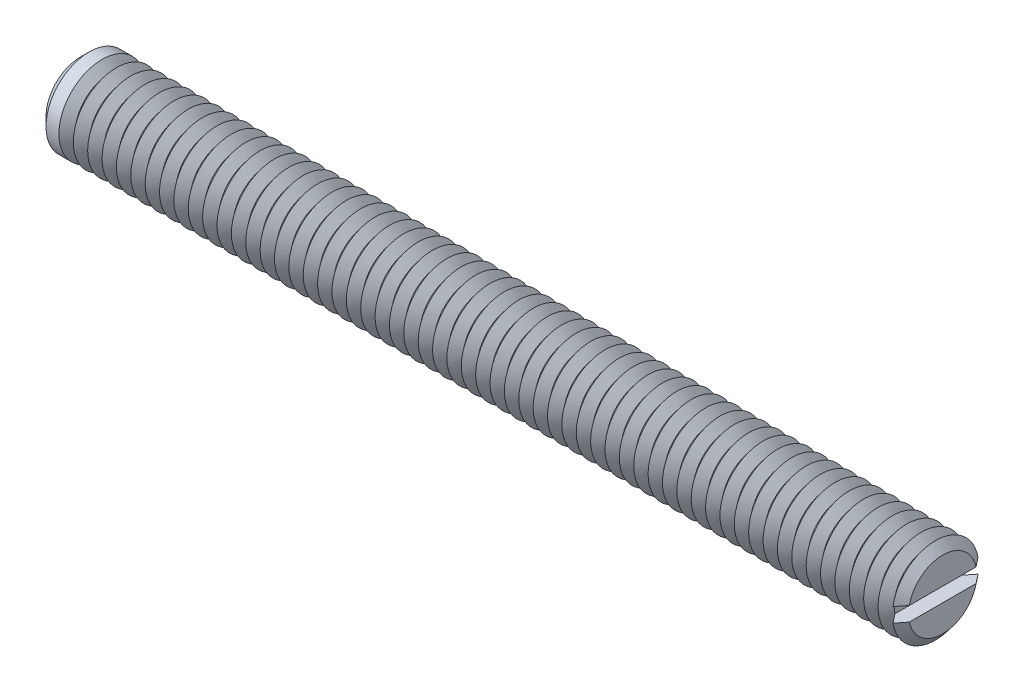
ISO-10303-21;
HEADER;
FILE_DESCRIPTION(('STEP AP214'),'2;1');
FILE_NAME('part.step','',(''),(''),'','','');
FILE_SCHEMA(('AUTOMOTIVE_DESIGN { 1 0 10303 214 1 1 1 1 }'));
ENDSEC;
DATA;
#1=APPLICATION_CONTEXT('core data for automotive mechanical design processes');
#2=APPLICATION_PROTOCOL_DEFINITION('international standard','automotive_design',2000,#1);
#3=PRODUCT_CONTEXT('',#1,'mechanical');
#4=PRODUCT('Part','Part','',(#3));
#5=PRODUCT_RELATED_PRODUCT_CATEGORY('part','',(#4));
#6=PRODUCT_DEFINITION_FORMATION('','',#4);
#7=PRODUCT_DEFINITION_CONTEXT('part definition',#1,'design');
#8=PRODUCT_DEFINITION('design','',#6,#7);
#9=PRODUCT_DEFINITION_SHAPE('','',#8);
#10=(LENGTH_UNIT() NAMED_UNIT(*) SI_UNIT(.MILLI.,.METRE.));
#11=(NAMED_UNIT(*) PLANE_ANGLE_UNIT() SI_UNIT($,.RADIAN.));
#12=(NAMED_UNIT(*) SI_UNIT($,.STERADIAN.) SOLID_ANGLE_UNIT());
#13=UNCERTAINTY_MEASURE_WITH_UNIT(LENGTH_MEASURE(1.E-05),#10,'distance_accuracy_value','');
#14=(GEOMETRIC_REPRESENTATION_CONTEXT(3) GLOBAL_UNCERTAINTY_ASSIGNED_CONTEXT((#13)) GLOBAL_UNIT_ASSIGNED_CONTEXT((#10,
#11,#12)) REPRESENTATION_CONTEXT('',''));
#15=CARTESIAN_POINT('',(0.,0.,0.));
#16=DIRECTION('',(0.,0.,1.));
#17=DIRECTION('',(1.,0.,0.));
#18=AXIS2_PLACEMENT_3D('',#15,#16,#17);
#19=CARTESIAN_POINT('',(29.5,0.,0.));
#20=DIRECTION('',(1.,0.,0.));
#21=DIRECTION('',(0.,0.,-1.));
#22=AXIS2_PLACEMENT_3D('',#19,#20,#21);
#23=CONICAL_SURFACE('',#22,3.,0.895664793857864);
#24=CARTESIAN_POINT('',(29.5,0.,0.));
#25=DIRECTION('',(-1.,0.,0.));
#26=DIRECTION('',(0.,0.,1.));
#27=AXIS2_PLACEMENT_3D('',#24,#25,#26);
#28=CIRCLE('',#27,3.);
#29=CARTESIAN_POINT('',(29.5,-0.5,-2.95803989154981));
#30=VERTEX_POINT('',#29);
#31=CARTESIAN_POINT('',(29.5,-0.5,2.95803989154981));
#32=VERTEX_POINT('',#31);
#33=EDGE_CURVE('E117',#30,#32,#28,.T.);
#34=ORIENTED_EDGE('',*,*,#33,.T.);
#35=CARTESIAN_POINT('',(32.3340158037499,-0.5,-6.52054251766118));
#36=CARTESIAN_POINT('',(32.1513674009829,-0.5,-6.2917395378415));
#37=CARTESIAN_POINT('',(31.9687482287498,-0.5,-6.0629132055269));
#38=CARTESIAN_POINT('',(31.6035782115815,-0.5,-5.60514706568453));
#39=CARTESIAN_POINT('',(31.4210273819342,-0.5,-5.37620724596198));
#40=CARTESIAN_POINT('',(31.0555297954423,-0.5,-4.91755222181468));
#41=CARTESIAN_POINT('',(30.8725834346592,-0.5,-4.68783670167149));
#42=CARTESIAN_POINT('',(30.5069310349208,-0.5,-4.22827290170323));
#43=CARTESIAN_POINT('',(30.3242249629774,-0.5,-3.99842464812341));
#44=CARTESIAN_POINT('',(29.9431833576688,-0.5,-3.51834247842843));
#45=CARTESIAN_POINT('',(29.744878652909,-0.5,-3.26808406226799));
#46=CARTESIAN_POINT('',(29.4479597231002,-0.5,-2.89216906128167));
#47=CARTESIAN_POINT('',(29.3490516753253,-0.5,-2.76674461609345));
#48=CARTESIAN_POINT('',(29.1515374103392,-0.5,-2.51567085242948));
#49=CARTESIAN_POINT('',(29.0529311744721,-0.5,-2.39002154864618));
#50=CARTESIAN_POINT('',(28.8563868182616,-0.5,-2.1386227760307));
#51=CARTESIAN_POINT('',(28.7584477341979,-0.5,-2.01287406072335));
#52=CARTESIAN_POINT('',(28.5633111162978,-0.5,-1.7607527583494));
#53=CARTESIAN_POINT('',(28.4661137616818,-0.5,-1.63438003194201));
#54=CARTESIAN_POINT('',(28.3214734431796,-0.5,-1.44403413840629));
#55=CARTESIAN_POINT('',(28.2734745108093,-0.5,-1.38048388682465));
#56=CARTESIAN_POINT('',(28.1780284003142,-0.5,-1.25297092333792));
#57=CARTESIAN_POINT('',(28.130581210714,-0.5,-1.18900822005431));
#58=CARTESIAN_POINT('',(28.0365530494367,-0.5,-1.0604855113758));
#59=CARTESIAN_POINT('',(27.9899717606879,-0.5,-0.99592573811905));
#60=CARTESIAN_POINT('',(27.8981961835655,-0.5,-0.865829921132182));
#61=CARTESIAN_POINT('',(27.8530016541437,-0.5,-0.800294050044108));
#62=CARTESIAN_POINT('',(27.7995678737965,-0.5,-0.7195282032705));
#63=CARTESIAN_POINT('',(27.7901114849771,-0.5,-0.705104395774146));
#64=CARTESIAN_POINT('',(27.7713420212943,-0.5,-0.676163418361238));
#65=CARTESIAN_POINT('',(27.762028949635,-0.5,-0.661646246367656));
#66=CARTESIAN_POINT('',(27.7343355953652,-0.5,-0.617935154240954));
#67=CARTESIAN_POINT('',(27.7162024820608,-0.5,-0.588583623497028));
#68=CARTESIAN_POINT('',(27.6808134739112,-0.5,-0.529281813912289));
#69=CARTESIAN_POINT('',(27.6635591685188,-0.5,-0.49933057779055));
#70=CARTESIAN_POINT('',(27.630358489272,-0.5,-0.438714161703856));
#71=CARTESIAN_POINT('',(27.6144119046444,-0.5,-0.408049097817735));
#72=CARTESIAN_POINT('',(27.5785841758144,-0.5,-0.333745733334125));
#73=CARTESIAN_POINT('',(27.5595664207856,-0.5,-0.289676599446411));
#74=CARTESIAN_POINT('',(27.5278600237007,-0.5,-0.199412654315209));
#75=CARTESIAN_POINT('',(27.5151365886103,-0.5,-0.153231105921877));
#76=CARTESIAN_POINT('',(27.501111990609,-0.5,-0.0687562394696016));
#77=CARTESIAN_POINT('',(27.498005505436,-0.5,-0.0307838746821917));
#78=CARTESIAN_POINT('',(27.4988722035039,-0.5,0.0450573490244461));
#79=CARTESIAN_POINT('',(27.5028411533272,-0.5,0.0829262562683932));
#80=CARTESIAN_POINT('',(27.5147515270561,-0.5,0.146691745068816));
#81=CARTESIAN_POINT('',(27.5212166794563,-0.5,0.172890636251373));
#82=CARTESIAN_POINT('',(27.5365108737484,-0.5,0.224599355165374));
#83=CARTESIAN_POINT('',(27.5453416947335,-0.5,0.250108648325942));
#84=CARTESIAN_POINT('',(27.5648480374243,-0.5,0.300632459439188));
#85=CARTESIAN_POINT('',(27.5755378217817,-0.5,0.325641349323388));
#86=CARTESIAN_POINT('',(27.598235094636,-0.5,0.375035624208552));
#87=CARTESIAN_POINT('',(27.6102421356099,-0.5,0.399421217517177));
#88=CARTESIAN_POINT('',(27.650943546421,-0.5,0.478106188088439));
#89=CARTESIAN_POINT('',(27.6816009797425,-0.5,0.531380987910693));
#90=CARTESIAN_POINT('',(27.7454790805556,-0.5,0.63638346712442));
#91=CARTESIAN_POINT('',(27.7787021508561,-0.5,0.688109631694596));
#92=CARTESIAN_POINT('',(27.8467342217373,-0.5,0.790686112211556));
#93=CARTESIAN_POINT('',(27.8815468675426,-0.5,0.841534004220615));
#94=CARTESIAN_POINT('',(27.9520982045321,-0.5,0.942545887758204));
#95=CARTESIAN_POINT('',(27.987836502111,-0.5,0.992710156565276));
#96=CARTESIAN_POINT('',(28.0600131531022,-0.5,1.09268759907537));
#97=CARTESIAN_POINT('',(28.096452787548,-0.5,1.14249984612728));
#98=CARTESIAN_POINT('',(28.1697745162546,-0.5,1.24180476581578));
#99=CARTESIAN_POINT('',(28.2066566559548,-0.5,1.29129740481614));
#100=CARTESIAN_POINT('',(28.3176541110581,-0.5,1.43926830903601));
#101=CARTESIAN_POINT('',(28.3922352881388,-0.5,1.53739673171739));
#102=CARTESIAN_POINT('',(28.547080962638,-0.5,1.73962858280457));
#103=CARTESIAN_POINT('',(28.6273934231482,-0.5,1.84369513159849));
#104=CARTESIAN_POINT('',(28.7885076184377,-0.5,2.05144913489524));
#105=CARTESIAN_POINT('',(28.8693093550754,-0.5,2.1551365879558));
#106=CARTESIAN_POINT('',(29.1121843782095,-0.5,2.46584176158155));
#107=CARTESIAN_POINT('',(29.2747224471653,-0.5,2.67249578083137));
#108=CARTESIAN_POINT('',(29.6005180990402,-0.5,3.08548885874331));
#109=CARTESIAN_POINT('',(29.7637761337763,-0.5,3.29182756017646));
#110=CARTESIAN_POINT('',(30.0906371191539,-0.5,3.70422676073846));
#111=CARTESIAN_POINT('',(30.2542400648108,-0.5,3.9102872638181));
#112=CARTESIAN_POINT('',(30.5774242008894,-0.5,4.31690950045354));
#113=CARTESIAN_POINT('',(30.7369999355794,-0.5,4.51747557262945));
#114=CARTESIAN_POINT('',(31.0562886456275,-0.5,4.91850000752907));
#115=CARTESIAN_POINT('',(31.216001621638,-0.5,5.11895836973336));
#116=CARTESIAN_POINT('',(31.5353926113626,-0.5,5.51963619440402));
#117=CARTESIAN_POINT('',(31.6950705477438,-0.5,5.71985571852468));
#118=CARTESIAN_POINT('',(32.0144964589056,-0.5,6.12023723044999));
#119=CARTESIAN_POINT('',(32.1742444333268,-0.5,6.32039921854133));
#120=CARTESIAN_POINT('',(32.3340158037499,-0.5,6.52054251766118));
#121=B_SPLINE_CURVE_WITH_KNOTS('',3,(#35,#36,#37,#38,#39,#40,#41,#42,#43,#44,#45,#46,#47,#48,
#49,#50,#51,#52,#53,#54,#55,#56,#57,#58,#59,#60,#61,#62,#63,#64,#65,#66,#67,#68,#69,#70,#71,#72,
#73,#74,#75,#76,#77,#78,#79,#80,#81,#82,#83,#84,#85,#86,#87,#88,#89,#90,#91,#92,#93,#94,#95,#96,
#97,#98,#99,#100,#101,#102,#103,#104,#105,#106,#107,#108,#109,#110,#111,#112,#113,#114,#115,
#116,#117,#118,#119,#120),.UNSPECIFIED.,.F.,.F.,(4,2,2,2,2,2,2,2,2,2,2,2,2,2,2,2,2,2,2,2,2,2,2,
2,2,2,2,2,2,2,2,2,2,2,2,2,2,2,2,2,2,2,4),(0.,0.878294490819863,1.75672728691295,
2.63771941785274,3.51857435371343,4.47648054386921,4.9556742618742,5.43483773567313,
5.91300334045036,6.39128103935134,6.63019943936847,6.86911286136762,7.10793700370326,
7.34671939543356,7.39846053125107,7.45020282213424,7.5536944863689,7.65736712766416,
7.76102302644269,7.9047661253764,8.04770552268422,8.16137782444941,8.27498213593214,
8.35581399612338,8.43670681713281,8.51825011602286,8.59976579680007,8.78399479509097,
8.96839847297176,9.15324864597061,9.3380214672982,9.52317177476,9.70834126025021,
10.0780963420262,10.472454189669,10.8668135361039,11.65555692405,12.4448978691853,
13.2342274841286,14.0031360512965,14.7720482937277,15.5403347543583,16.3086173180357),.UNSPECIFIED.);
#122=CARTESIAN_POINT('',(29.,-0.5,2.32228361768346));
#123=VERTEX_POINT('',#122);
#124=EDGE_CURVE('E109',#123,#32,#121,.T.);
#125=ORIENTED_EDGE('',*,*,#124,.F.);
#126=CARTESIAN_POINT('',(29.,0.,0.));
#127=DIRECTION('',(-1.,0.,0.));
#128=DIRECTION('',(0.,0.,1.));
#129=AXIS2_PLACEMENT_3D('',#126,#127,#128);
#130=CIRCLE('',#129,2.37550020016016);
#131=CARTESIAN_POINT('',(29.,-0.5,-2.32228361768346));
#132=VERTEX_POINT('',#131);
#133=EDGE_CURVE('E689',#132,#123,#130,.T.);
#134=ORIENTED_EDGE('',*,*,#133,.F.);
#135=EDGE_CURVE('E58',#30,#132,#121,.T.);
#136=ORIENTED_EDGE('',*,*,#135,.F.);
#137=EDGE_LOOP('',(#34,#125,#134,#136));
#138=FACE_BOUND('',#137,.T.);
#139=ADVANCED_FACE('F37',(#138),#23,.T.);
#140=CARTESIAN_POINT('',(29.5,0.5,2.95803989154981));
#141=VERTEX_POINT('',#140);
#142=CARTESIAN_POINT('',(29.5,0.5,-2.95803989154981));
#143=VERTEX_POINT('',#142);
#144=EDGE_CURVE('E100',#141,#143,#28,.T.);
#145=ORIENTED_EDGE('',*,*,#144,.T.);
#146=CARTESIAN_POINT('',(32.3340158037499,0.5,6.52054251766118));
#147=CARTESIAN_POINT('',(32.1513674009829,0.5,6.2917395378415));
#148=CARTESIAN_POINT('',(31.9687482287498,0.5,6.0629132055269));
#149=CARTESIAN_POINT('',(31.6035782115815,0.5,5.60514706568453));
#150=CARTESIAN_POINT('',(31.4210273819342,0.5,5.37620724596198));
#151=CARTESIAN_POINT('',(31.0555297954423,0.5,4.91755222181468));
#152=CARTESIAN_POINT('',(30.8725834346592,0.5,4.68783670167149));
#153=CARTESIAN_POINT('',(30.5069310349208,0.5,4.22827290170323));
#154=CARTESIAN_POINT('',(30.3242249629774,0.5,3.99842464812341));
#155=CARTESIAN_POINT('',(29.9431833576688,0.5,3.51834247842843));
#156=CARTESIAN_POINT('',(29.744878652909,0.5,3.26808406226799));
#157=CARTESIAN_POINT('',(29.4479597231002,0.5,2.89216906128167));
#158=CARTESIAN_POINT('',(29.3490516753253,0.5,2.76674461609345));
#159=CARTESIAN_POINT('',(29.1515374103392,0.5,2.51567085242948));
#160=CARTESIAN_POINT('',(29.0529311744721,0.5,2.39002154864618));
#161=CARTESIAN_POINT('',(28.8563868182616,0.5,2.1386227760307));
#162=CARTESIAN_POINT('',(28.7584477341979,0.5,2.01287406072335));
#163=CARTESIAN_POINT('',(28.5633111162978,0.5,1.7607527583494));
#164=CARTESIAN_POINT('',(28.4661137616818,0.5,1.63438003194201));
#165=CARTESIAN_POINT('',(28.3214734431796,0.5,1.44403413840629));
#166=CARTESIAN_POINT('',(28.2734745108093,0.5,1.38048388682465));
#167=CARTESIAN_POINT('',(28.1780284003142,0.5,1.25297092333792));
#168=CARTESIAN_POINT('',(28.130581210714,0.5,1.18900822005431));
#169=CARTESIAN_POINT('',(28.0365530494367,0.5,1.0604855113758));
#170=CARTESIAN_POINT('',(27.9899717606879,0.5,0.99592573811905));
#171=CARTESIAN_POINT('',(27.8981961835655,0.5,0.865829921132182));
#172=CARTESIAN_POINT('',(27.8530016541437,0.5,0.800294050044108));
#173=CARTESIAN_POINT('',(27.7995678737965,0.5,0.7195282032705));
#174=CARTESIAN_POINT('',(27.7901114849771,0.5,0.705104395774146));
#175=CARTESIAN_POINT('',(27.7713420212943,0.5,0.676163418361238));
#176=CARTESIAN_POINT('',(27.762028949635,0.5,0.661646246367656));
#177=CARTESIAN_POINT('',(27.7343355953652,0.5,0.617935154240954));
#178=CARTESIAN_POINT('',(27.7162024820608,0.5,0.588583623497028));
#179=CARTESIAN_POINT('',(27.6808134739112,0.5,0.529281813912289));
#180=CARTESIAN_POINT('',(27.6635591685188,0.5,0.49933057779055));
#181=CARTESIAN_POINT('',(27.630358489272,0.5,0.438714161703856));
#182=CARTESIAN_POINT('',(27.6144119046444,0.5,0.408049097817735));
#183=CARTESIAN_POINT('',(27.5785841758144,0.5,0.333745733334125));
#184=CARTESIAN_POINT('',(27.5595664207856,0.5,0.289676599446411));
#185=CARTESIAN_POINT('',(27.5278600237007,0.5,0.199412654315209));
#186=CARTESIAN_POINT('',(27.5151365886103,0.5,0.153231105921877));
#187=CARTESIAN_POINT('',(27.501111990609,0.5,0.0687562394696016));
#188=CARTESIAN_POINT('',(27.498005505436,0.5,0.0307838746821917));
#189=CARTESIAN_POINT('',(27.4988722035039,0.5,-0.0450573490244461));
#190=CARTESIAN_POINT('',(27.5028411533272,0.5,-0.0829262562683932));
#191=CARTESIAN_POINT('',(27.5147515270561,0.5,-0.146691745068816));
#192=CARTESIAN_POINT('',(27.5212166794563,0.5,-0.172890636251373));
#193=CARTESIAN_POINT('',(27.5365108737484,0.5,-0.224599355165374));
#194=CARTESIAN_POINT('',(27.5453416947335,0.5,-0.250108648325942));
#195=CARTESIAN_POINT('',(27.5648480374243,0.5,-0.300632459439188));
#196=CARTESIAN_POINT('',(27.5755378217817,0.5,-0.325641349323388));
#197=CARTESIAN_POINT('',(27.598235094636,0.5,-0.375035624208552));
#198=CARTESIAN_POINT('',(27.6102421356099,0.5,-0.399421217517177));
#199=CARTESIAN_POINT('',(27.650943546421,0.5,-0.478106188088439));
#200=CARTESIAN_POINT('',(27.6816009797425,0.5,-0.531380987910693));
#201=CARTESIAN_POINT('',(27.7454790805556,0.5,-0.63638346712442));
#202=CARTESIAN_POINT('',(27.7787021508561,0.5,-0.688109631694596));
#203=CARTESIAN_POINT('',(27.8467342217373,0.5,-0.790686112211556));
#204=CARTESIAN_POINT('',(27.8815468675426,0.5,-0.841534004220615));
#205=CARTESIAN_POINT('',(27.9520982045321,0.5,-0.942545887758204));
#206=CARTESIAN_POINT('',(27.987836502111,0.5,-0.992710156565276));
#207=CARTESIAN_POINT('',(28.0600131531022,0.5,-1.09268759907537));
#208=CARTESIAN_POINT('',(28.096452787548,0.5,-1.14249984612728));
#209=CARTESIAN_POINT('',(28.1697745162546,0.5,-1.24180476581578));
#210=CARTESIAN_POINT('',(28.2066566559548,0.5,-1.29129740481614));
#211=CARTESIAN_POINT('',(28.3176541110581,0.5,-1.43926830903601));
#212=CARTESIAN_POINT('',(28.3922352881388,0.5,-1.53739673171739));
#213=CARTESIAN_POINT('',(28.547080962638,0.5,-1.73962858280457));
#214=CARTESIAN_POINT('',(28.6273934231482,0.5,-1.84369513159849));
#215=CARTESIAN_POINT('',(28.7885076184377,0.5,-2.05144913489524));
#216=CARTESIAN_POINT('',(28.8693093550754,0.5,-2.1551365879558));
#217=CARTESIAN_POINT('',(29.1121843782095,0.5,-2.46584176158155));
#218=CARTESIAN_POINT('',(29.2747224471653,0.5,-2.67249578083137));
#219=CARTESIAN_POINT('',(29.6005180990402,0.5,-3.08548885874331));
#220=CARTESIAN_POINT('',(29.7637761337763,0.5,-3.29182756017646));
#221=CARTESIAN_POINT('',(30.0906371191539,0.5,-3.70422676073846));
#222=CARTESIAN_POINT('',(30.2542400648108,0.5,-3.9102872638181));
#223=CARTESIAN_POINT('',(30.5774242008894,0.5,-4.31690950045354));
#224=CARTESIAN_POINT('',(30.7369999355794,0.5,-4.51747557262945));
#225=CARTESIAN_POINT('',(31.0562886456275,0.5,-4.91850000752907));
#226=CARTESIAN_POINT('',(31.216001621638,0.5,-5.11895836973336));
#227=CARTESIAN_POINT('',(31.5353926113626,0.5,-5.51963619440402));
#228=CARTESIAN_POINT('',(31.6950705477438,0.5,-5.71985571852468));
#229=CARTESIAN_POINT('',(32.0144964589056,0.5,-6.12023723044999));
#230=CARTESIAN_POINT('',(32.1742444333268,0.5,-6.32039921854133));
#231=CARTESIAN_POINT('',(32.3340158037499,0.5,-6.52054251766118));
#232=B_SPLINE_CURVE_WITH_KNOTS('',3,(#146,#147,#148,#149,#150,#151,#152,#153,#154,#155,#156,
#157,#158,#159,#160,#161,#162,#163,#164,#165,#166,#167,#168,#169,#170,#171,#172,#173,#174,#175,
#176,#177,#178,#179,#180,#181,#182,#183,#184,#185,#186,#187,#188,#189,#190,#191,#192,#193,#194,
#195,#196,#197,#198,#199,#200,#201,#202,#203,#204,#205,#206,#207,#208,#209,#210,#211,#212,#213,
#214,#215,#216,#217,#218,#219,#220,#221,#222,#223,#224,#225,#226,#227,#228,#229,#230,#231),
.UNSPECIFIED.,.F.,.F.,(4,2,2,2,2,2,2,2,2,2,2,2,2,2,2,2,2,2,2,2,2,2,2,2,2,2,2,2,2,2,2,2,2,2,2,2,
2,2,2,2,2,2,4),(0.,0.878294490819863,1.75672728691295,2.63771941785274,3.51857435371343,
4.47648054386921,4.9556742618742,5.43483773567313,5.91300334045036,6.39128103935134,
6.63019943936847,6.86911286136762,7.10793700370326,7.34671939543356,7.39846053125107,
7.45020282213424,7.5536944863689,7.65736712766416,7.76102302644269,7.9047661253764,
8.04770552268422,8.16137782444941,8.27498213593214,8.35581399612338,8.43670681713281,
8.51825011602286,8.59976579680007,8.78399479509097,8.96839847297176,9.15324864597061,
9.3380214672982,9.52317177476,9.70834126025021,10.0780963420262,10.472454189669,
10.8668135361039,11.65555692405,12.4448978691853,13.2342274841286,14.0031360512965,
14.7720482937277,15.5403347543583,16.3086173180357),.UNSPECIFIED.);
#233=CARTESIAN_POINT('',(29.,0.5,-2.32228361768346));
#234=VERTEX_POINT('',#233);
#235=EDGE_CURVE('E110',#234,#143,#232,.T.);
#236=ORIENTED_EDGE('',*,*,#235,.F.);
#237=CARTESIAN_POINT('',(29.,0.5,2.32228361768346));
#238=VERTEX_POINT('',#237);
#239=EDGE_CURVE('E103',#238,#234,#130,.T.);
#240=ORIENTED_EDGE('',*,*,#239,.F.);
#241=EDGE_CURVE('E97',#141,#238,#232,.T.);
#242=ORIENTED_EDGE('',*,*,#241,.F.);
#243=EDGE_LOOP('',(#145,#236,#240,#242));
#244=FACE_BOUND('',#243,.T.);
#245=ADVANCED_FACE('F99',(#244),#23,.T.);
#246=CARTESIAN_POINT('',(29.,0.,0.));
#247=DIRECTION('',(-1.,0.,0.));
#248=DIRECTION('',(0.,0.,1.));
#249=AXIS2_PLACEMENT_3D('',#246,#247,#248);
#250=CONICAL_SURFACE('',#249,2.37550020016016,0.895664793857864);
#251=CARTESIAN_POINT('',(28.5,0.,0.));
#252=DIRECTION('',(-1.,0.,0.));
#253=DIRECTION('',(0.,0.,1.));
#254=AXIS2_PLACEMENT_3D('',#251,#252,#253);
#255=CIRCLE('',#254,3.);
#256=CARTESIAN_POINT('',(28.5,0.,3.));
#257=VERTEX_POINT('',#256);
#258=EDGE_CURVE('E675',#257,#257,#255,.T.);
#259=ORIENTED_EDGE('',*,*,#258,.F.);
#260=EDGE_LOOP('',(#259));
#261=FACE_BOUND('',#260,.T.);
#262=ORIENTED_EDGE('',*,*,#239,.T.);
#263=EDGE_CURVE('E683',#234,#132,#130,.T.);
#264=ORIENTED_EDGE('',*,*,#263,.T.);
#265=ORIENTED_EDGE('',*,*,#133,.T.);
#266=EDGE_CURVE('E681',#123,#238,#130,.T.);
#267=ORIENTED_EDGE('',*,*,#266,.T.);
#268=EDGE_LOOP('',(#262,#264,#265,#267));
#269=FACE_BOUND('',#268,.T.);
#270=ADVANCED_FACE('F167',(#261,#269),#250,.T.);
#271=CARTESIAN_POINT('',(30.,0.,0.));
#272=DIRECTION('',(1.,0.,0.));
#273=DIRECTION('',(0.,0.,-1.));
#274=AXIS2_PLACEMENT_3D('',#271,#272,#273);
#275=PLANE('',#274);
#276=CARTESIAN_POINT('',(30.,0.,0.));
#277=DIRECTION('',(-1.,0.,0.));
#278=DIRECTION('',(0.,0.,1.));
#279=AXIS2_PLACEMENT_3D('',#276,#277,#278);
#280=CIRCLE('',#279,2.37550020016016);
#281=CARTESIAN_POINT('',(30.,0.5,2.32228361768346));
#282=VERTEX_POINT('',#281);
#283=CARTESIAN_POINT('',(30.,0.5,-2.32228361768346));
#284=VERTEX_POINT('',#283);
#285=EDGE_CURVE('E159',#282,#284,#280,.T.);
#286=ORIENTED_EDGE('',*,*,#285,.F.);
#287=DIRECTION('',(0.,0.,1.));
#288=VECTOR('',#287,1.);
#289=CARTESIAN_POINT('',(30.,0.5,0.));
#290=LINE('',#289,#288);
#291=EDGE_CURVE('E122',#284,#282,#290,.T.);
#292=ORIENTED_EDGE('',*,*,#291,.F.);
#293=EDGE_LOOP('',(#286,#292));
#294=FACE_BOUND('',#293,.T.);
#295=ADVANCED_FACE('F171',(#294),#275,.T.);
#296=CARTESIAN_POINT('',(30.,-0.5,-2.32228361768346));
#297=VERTEX_POINT('',#296);
#298=CARTESIAN_POINT('',(30.,-0.5,2.32228361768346));
#299=VERTEX_POINT('',#298);
#300=EDGE_CURVE('E66',#297,#299,#280,.T.);
#301=ORIENTED_EDGE('',*,*,#300,.F.);
#302=DIRECTION('',(0.,0.,-1.));
#303=VECTOR('',#302,1.);
#304=CARTESIAN_POINT('',(30.,-0.5,0.));
#305=LINE('',#304,#303);
#306=EDGE_CURVE('E135',#299,#297,#305,.T.);
#307=ORIENTED_EDGE('',*,*,#306,.F.);
#308=EDGE_LOOP('',(#301,#307));
#309=FACE_BOUND('',#308,.T.);
#310=ADVANCED_FACE('F201',(#309),#275,.T.);
#311=CARTESIAN_POINT('',(30.,0.,0.));
#312=DIRECTION('',(-1.,0.,0.));
#313=DIRECTION('',(0.,0.,1.));
#314=AXIS2_PLACEMENT_3D('',#311,#312,#313);
#315=CONICAL_SURFACE('',#314,2.37550020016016,0.895664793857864);
#316=ORIENTED_EDGE('',*,*,#144,.F.);
#317=CARTESIAN_POINT('',(26.6659841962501,0.5,-6.52054251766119));
#318=CARTESIAN_POINT('',(26.8486325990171,0.5,-6.29173953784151));
#319=CARTESIAN_POINT('',(27.0312517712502,0.5,-6.06291320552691));
#320=CARTESIAN_POINT('',(27.3964217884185,0.5,-5.60514706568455));
#321=CARTESIAN_POINT('',(27.5789726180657,0.5,-5.37620724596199));
#322=CARTESIAN_POINT('',(27.9444702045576,0.5,-4.9175522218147));
#323=CARTESIAN_POINT('',(28.1274165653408,0.5,-4.68783670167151));
#324=CARTESIAN_POINT('',(28.4930689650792,0.5,-4.22827290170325));
#325=CARTESIAN_POINT('',(28.6757750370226,0.5,-3.99842464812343));
#326=CARTESIAN_POINT('',(29.0568166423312,0.5,-3.51834247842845));
#327=CARTESIAN_POINT('',(29.2551213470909,0.5,-3.26808406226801));
#328=CARTESIAN_POINT('',(29.5520402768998,0.5,-2.89216906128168));
#329=CARTESIAN_POINT('',(29.6509483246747,0.5,-2.76674461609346));
#330=CARTESIAN_POINT('',(29.8484625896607,0.5,-2.51567085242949));
#331=CARTESIAN_POINT('',(29.9470688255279,0.5,-2.39002154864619));
#332=CARTESIAN_POINT('',(30.1436131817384,0.5,-2.13862277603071));
#333=CARTESIAN_POINT('',(30.2415522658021,0.5,-2.01287406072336));
#334=CARTESIAN_POINT('',(30.4366888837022,0.5,-1.7607527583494));
#335=CARTESIAN_POINT('',(30.5338862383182,0.5,-1.63438003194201));
#336=CARTESIAN_POINT('',(30.6785265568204,0.5,-1.4440341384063));
#337=CARTESIAN_POINT('',(30.7265254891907,0.5,-1.38048388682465));
#338=CARTESIAN_POINT('',(30.8219715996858,0.5,-1.25297092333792));
#339=CARTESIAN_POINT('',(30.869418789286,0.5,-1.18900822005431));
#340=CARTESIAN_POINT('',(30.9634469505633,0.5,-1.0604855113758));
#341=CARTESIAN_POINT('',(31.0100282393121,0.5,-0.995925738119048));
#342=CARTESIAN_POINT('',(31.1018038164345,0.5,-0.865829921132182));
#343=CARTESIAN_POINT('',(31.1469983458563,0.5,-0.800294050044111));
#344=CARTESIAN_POINT('',(31.2004321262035,0.5,-0.719528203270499));
#345=CARTESIAN_POINT('',(31.2098885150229,0.5,-0.705104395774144));
#346=CARTESIAN_POINT('',(31.2286579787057,0.5,-0.676163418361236));
#347=CARTESIAN_POINT('',(31.237971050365,0.5,-0.661646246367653));
#348=CARTESIAN_POINT('',(31.2656644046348,0.5,-0.617935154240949));
#349=CARTESIAN_POINT('',(31.2837975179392,0.5,-0.588583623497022));
#350=CARTESIAN_POINT('',(31.3191865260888,0.5,-0.529281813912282));
#351=CARTESIAN_POINT('',(31.3364408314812,0.5,-0.499330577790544));
#352=CARTESIAN_POINT('',(31.369641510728,0.5,-0.438714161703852));
#353=CARTESIAN_POINT('',(31.3855880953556,0.5,-0.408049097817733));
#354=CARTESIAN_POINT('',(31.4214158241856,0.5,-0.333745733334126));
#355=CARTESIAN_POINT('',(31.4404335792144,0.5,-0.289676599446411));
#356=CARTESIAN_POINT('',(31.4721399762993,0.5,-0.199412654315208));
#357=CARTESIAN_POINT('',(31.4848634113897,0.5,-0.153231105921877));
#358=CARTESIAN_POINT('',(31.498888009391,0.5,-0.0687562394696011));
#359=CARTESIAN_POINT('',(31.501994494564,0.5,-0.030783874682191));
#360=CARTESIAN_POINT('',(31.5011277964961,0.5,0.0450573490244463));
#361=CARTESIAN_POINT('',(31.4971588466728,0.5,0.0829262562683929));
#362=CARTESIAN_POINT('',(31.4852484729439,0.5,0.146691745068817));
#363=CARTESIAN_POINT('',(31.4787833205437,0.5,0.172890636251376));
#364=CARTESIAN_POINT('',(31.4634891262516,0.5,0.224599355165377));
#365=CARTESIAN_POINT('',(31.4546583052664,0.5,0.250108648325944));
#366=CARTESIAN_POINT('',(31.4351519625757,0.5,0.300632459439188));
#367=CARTESIAN_POINT('',(31.4244621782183,0.5,0.325641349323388));
#368=CARTESIAN_POINT('',(31.401764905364,0.5,0.375035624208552));
#369=CARTESIAN_POINT('',(31.3897578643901,0.5,0.399421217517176));
#370=CARTESIAN_POINT('',(31.3490564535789,0.5,0.478106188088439));
#371=CARTESIAN_POINT('',(31.3183990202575,0.5,0.531380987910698));
#372=CARTESIAN_POINT('',(31.2545209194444,0.5,0.636383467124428));
#373=CARTESIAN_POINT('',(31.2212978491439,0.5,0.688109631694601));
#374=CARTESIAN_POINT('',(31.1532657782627,0.5,0.790686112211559));
#375=CARTESIAN_POINT('',(31.1184531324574,0.5,0.841534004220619));
#376=CARTESIAN_POINT('',(31.0479017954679,0.5,0.942545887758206));
#377=CARTESIAN_POINT('',(31.0121634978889,0.5,0.992710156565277));
#378=CARTESIAN_POINT('',(30.9399868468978,0.5,1.09268759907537));
#379=CARTESIAN_POINT('',(30.903547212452,0.5,1.14249984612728));
#380=CARTESIAN_POINT('',(30.8302254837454,0.5,1.24180476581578));
#381=CARTESIAN_POINT('',(30.7933433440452,0.5,1.29129740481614));
#382=CARTESIAN_POINT('',(30.6823458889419,0.5,1.43926830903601));
#383=CARTESIAN_POINT('',(30.6077647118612,0.5,1.53739673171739));
#384=CARTESIAN_POINT('',(30.452919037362,0.5,1.73962858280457));
#385=CARTESIAN_POINT('',(30.3726065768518,0.5,1.84369513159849));
#386=CARTESIAN_POINT('',(30.2114923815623,0.5,2.05144913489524));
#387=CARTESIAN_POINT('',(30.1306906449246,0.5,2.1551365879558));
#388=CARTESIAN_POINT('',(29.8878156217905,0.5,2.46584176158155));
#389=CARTESIAN_POINT('',(29.7252775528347,0.5,2.67249578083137));
#390=CARTESIAN_POINT('',(29.3994819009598,0.5,3.08548885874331));
#391=CARTESIAN_POINT('',(29.2362238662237,0.5,3.29182756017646));
#392=CARTESIAN_POINT('',(28.9093628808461,0.5,3.70422676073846));
#393=CARTESIAN_POINT('',(28.7457599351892,0.5,3.9102872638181));
#394=CARTESIAN_POINT('',(28.4225757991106,0.5,4.31690950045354));
#395=CARTESIAN_POINT('',(28.2630000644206,0.5,4.51747557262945));
#396=CARTESIAN_POINT('',(27.9437113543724,0.5,4.91850000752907));
#397=CARTESIAN_POINT('',(27.7839983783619,0.5,5.11895836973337));
#398=CARTESIAN_POINT('',(27.4646073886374,0.5,5.51963619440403));
#399=CARTESIAN_POINT('',(27.3049294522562,0.5,5.71985571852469));
#400=CARTESIAN_POINT('',(26.9855035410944,0.5,6.12023723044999));
#401=CARTESIAN_POINT('',(26.8257555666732,0.5,6.32039921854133));
#402=CARTESIAN_POINT('',(26.6659841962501,0.5,6.52054251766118));
#403=B_SPLINE_CURVE_WITH_KNOTS('',3,(#317,#318,#319,#320,#321,#322,#323,#324,#325,#326,#327,
#328,#329,#330,#331,#332,#333,#334,#335,#336,#337,#338,#339,#340,#341,#342,#343,#344,#345,#346,
#347,#348,#349,#350,#351,#352,#353,#354,#355,#356,#357,#358,#359,#360,#361,#362,#363,#364,#365,
#366,#367,#368,#369,#370,#371,#372,#373,#374,#375,#376,#377,#378,#379,#380,#381,#382,#383,#384,
#385,#386,#387,#388,#389,#390,#391,#392,#393,#394,#395,#396,#397,#398,#399,#400,#401,#402),
.UNSPECIFIED.,.F.,.F.,(4,2,2,2,2,2,2,2,2,2,2,2,2,2,2,2,2,2,2,2,2,2,2,2,2,2,2,2,2,2,2,2,2,2,2,2,
2,2,2,2,2,2,4),(0.,0.878294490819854,1.75672728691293,2.63771941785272,3.51857435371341,
4.47648054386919,4.95567426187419,5.43483773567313,5.91300334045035,6.39128103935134,
6.63019943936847,6.86911286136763,7.10793700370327,7.34671939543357,7.39846053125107,
7.45020282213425,7.55369448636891,7.65736712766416,7.7610230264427,7.90476612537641,
8.04770552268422,8.16137782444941,8.27498213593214,8.35581399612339,8.43670681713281,
8.51825011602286,8.59976579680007,8.78399479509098,8.96839847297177,9.15324864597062,
9.3380214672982,9.52317177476,9.70834126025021,10.0780963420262,10.472454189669,
10.8668135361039,11.65555692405,12.4448978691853,13.2342274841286,14.0031360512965,
14.7720482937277,15.5403347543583,16.3086173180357),.UNSPECIFIED.);
#404=EDGE_CURVE('E41',#282,#141,#403,.T.);
#405=ORIENTED_EDGE('',*,*,#404,.F.);
#406=ORIENTED_EDGE('',*,*,#285,.T.);
#407=EDGE_CURVE('E11',#143,#284,#403,.T.);
#408=ORIENTED_EDGE('',*,*,#407,.F.);
#409=EDGE_LOOP('',(#316,#405,#406,#408));
#410=FACE_BOUND('',#409,.T.);
#411=ADVANCED_FACE('F114',(#410),#315,.T.);
#412=CARTESIAN_POINT('',(30.,0.5,-4.5));
#413=DIRECTION('',(0.,1.,0.));
#414=DIRECTION('',(0.,0.,1.));
#415=AXIS2_PLACEMENT_3D('',#412,#413,#414);
#416=PLANE('',#415);
#417=ORIENTED_EDGE('',*,*,#404,.T.);
#418=ORIENTED_EDGE('',*,*,#241,.T.);
#419=DIRECTION('',(0.,0.,1.));
#420=VECTOR('',#419,1.);
#421=CARTESIAN_POINT('',(29.,0.5,-4.5));
#422=LINE('',#421,#420);
#423=EDGE_CURVE('E144',#234,#238,#422,.T.);
#424=ORIENTED_EDGE('',*,*,#423,.F.);
#425=ORIENTED_EDGE('',*,*,#235,.T.);
#426=ORIENTED_EDGE('',*,*,#407,.T.);
#427=ORIENTED_EDGE('',*,*,#291,.T.);
#428=EDGE_LOOP('',(#417,#418,#424,#425,#426,#427));
#429=FACE_BOUND('',#428,.T.);
#430=ADVANCED_FACE('F120',(#429),#416,.F.);
#431=ORIENTED_EDGE('',*,*,#33,.F.);
#432=CARTESIAN_POINT('',(26.6659841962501,-0.5,6.52054251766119));
#433=CARTESIAN_POINT('',(26.8486325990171,-0.5,6.29173953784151));
#434=CARTESIAN_POINT('',(27.0312517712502,-0.5,6.06291320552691));
#435=CARTESIAN_POINT('',(27.3964217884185,-0.5,5.60514706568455));
#436=CARTESIAN_POINT('',(27.5789726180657,-0.5,5.37620724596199));
#437=CARTESIAN_POINT('',(27.9444702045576,-0.5,4.9175522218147));
#438=CARTESIAN_POINT('',(28.1274165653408,-0.5,4.68783670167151));
#439=CARTESIAN_POINT('',(28.4930689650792,-0.5,4.22827290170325));
#440=CARTESIAN_POINT('',(28.6757750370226,-0.5,3.99842464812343));
#441=CARTESIAN_POINT('',(29.0568166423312,-0.5,3.51834247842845));
#442=CARTESIAN_POINT('',(29.2551213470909,-0.5,3.26808406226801));
#443=CARTESIAN_POINT('',(29.5520402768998,-0.5,2.89216906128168));
#444=CARTESIAN_POINT('',(29.6509483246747,-0.5,2.76674461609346));
#445=CARTESIAN_POINT('',(29.8484625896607,-0.5,2.51567085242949));
#446=CARTESIAN_POINT('',(29.9470688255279,-0.5,2.39002154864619));
#447=CARTESIAN_POINT('',(30.1436131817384,-0.5,2.13862277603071));
#448=CARTESIAN_POINT('',(30.2415522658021,-0.5,2.01287406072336));
#449=CARTESIAN_POINT('',(30.4366888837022,-0.5,1.7607527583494));
#450=CARTESIAN_POINT('',(30.5338862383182,-0.5,1.63438003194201));
#451=CARTESIAN_POINT('',(30.6785265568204,-0.5,1.4440341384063));
#452=CARTESIAN_POINT('',(30.7265254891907,-0.5,1.38048388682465));
#453=CARTESIAN_POINT('',(30.8219715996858,-0.5,1.25297092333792));
#454=CARTESIAN_POINT('',(30.869418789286,-0.5,1.18900822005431));
#455=CARTESIAN_POINT('',(30.9634469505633,-0.5,1.0604855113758));
#456=CARTESIAN_POINT('',(31.0100282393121,-0.5,0.995925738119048));
#457=CARTESIAN_POINT('',(31.1018038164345,-0.5,0.865829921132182));
#458=CARTESIAN_POINT('',(31.1469983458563,-0.5,0.800294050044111));
#459=CARTESIAN_POINT('',(31.2004321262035,-0.5,0.719528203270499));
#460=CARTESIAN_POINT('',(31.2098885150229,-0.5,0.705104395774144));
#461=CARTESIAN_POINT('',(31.2286579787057,-0.5,0.676163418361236));
#462=CARTESIAN_POINT('',(31.237971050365,-0.5,0.661646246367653));
#463=CARTESIAN_POINT('',(31.2656644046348,-0.5,0.617935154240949));
#464=CARTESIAN_POINT('',(31.2837975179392,-0.5,0.588583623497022));
#465=CARTESIAN_POINT('',(31.3191865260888,-0.5,0.529281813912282));
#466=CARTESIAN_POINT('',(31.3364408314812,-0.5,0.499330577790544));
#467=CARTESIAN_POINT('',(31.369641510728,-0.5,0.438714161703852));
#468=CARTESIAN_POINT('',(31.3855880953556,-0.5,0.408049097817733));
#469=CARTESIAN_POINT('',(31.4214158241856,-0.5,0.333745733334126));
#470=CARTESIAN_POINT('',(31.4404335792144,-0.5,0.289676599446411));
#471=CARTESIAN_POINT('',(31.4721399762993,-0.5,0.199412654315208));
#472=CARTESIAN_POINT('',(31.4848634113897,-0.5,0.153231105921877));
#473=CARTESIAN_POINT('',(31.498888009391,-0.5,0.0687562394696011));
#474=CARTESIAN_POINT('',(31.501994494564,-0.5,0.030783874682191));
#475=CARTESIAN_POINT('',(31.5011277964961,-0.5,-0.0450573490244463));
#476=CARTESIAN_POINT('',(31.4971588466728,-0.5,-0.0829262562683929));
#477=CARTESIAN_POINT('',(31.4852484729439,-0.5,-0.146691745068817));
#478=CARTESIAN_POINT('',(31.4787833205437,-0.5,-0.172890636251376));
#479=CARTESIAN_POINT('',(31.4634891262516,-0.5,-0.224599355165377));
#480=CARTESIAN_POINT('',(31.4546583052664,-0.5,-0.250108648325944));
#481=CARTESIAN_POINT('',(31.4351519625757,-0.5,-0.300632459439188));
#482=CARTESIAN_POINT('',(31.4244621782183,-0.5,-0.325641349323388));
#483=CARTESIAN_POINT('',(31.401764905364,-0.5,-0.375035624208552));
#484=CARTESIAN_POINT('',(31.3897578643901,-0.5,-0.399421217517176));
#485=CARTESIAN_POINT('',(31.3490564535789,-0.5,-0.478106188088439));
#486=CARTESIAN_POINT('',(31.3183990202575,-0.5,-0.531380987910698));
#487=CARTESIAN_POINT('',(31.2545209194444,-0.5,-0.636383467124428));
#488=CARTESIAN_POINT('',(31.2212978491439,-0.5,-0.688109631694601));
#489=CARTESIAN_POINT('',(31.1532657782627,-0.5,-0.790686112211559));
#490=CARTESIAN_POINT('',(31.1184531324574,-0.5,-0.841534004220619));
#491=CARTESIAN_POINT('',(31.0479017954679,-0.5,-0.942545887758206));
#492=CARTESIAN_POINT('',(31.0121634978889,-0.5,-0.992710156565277));
#493=CARTESIAN_POINT('',(30.9399868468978,-0.5,-1.09268759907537));
#494=CARTESIAN_POINT('',(30.903547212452,-0.5,-1.14249984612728));
#495=CARTESIAN_POINT('',(30.8302254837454,-0.5,-1.24180476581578));
#496=CARTESIAN_POINT('',(30.7933433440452,-0.5,-1.29129740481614));
#497=CARTESIAN_POINT('',(30.6823458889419,-0.5,-1.43926830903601));
#498=CARTESIAN_POINT('',(30.6077647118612,-0.5,-1.53739673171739));
#499=CARTESIAN_POINT('',(30.452919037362,-0.5,-1.73962858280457));
#500=CARTESIAN_POINT('',(30.3726065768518,-0.5,-1.84369513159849));
#501=CARTESIAN_POINT('',(30.2114923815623,-0.5,-2.05144913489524));
#502=CARTESIAN_POINT('',(30.1306906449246,-0.5,-2.1551365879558));
#503=CARTESIAN_POINT('',(29.8878156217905,-0.5,-2.46584176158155));
#504=CARTESIAN_POINT('',(29.7252775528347,-0.5,-2.67249578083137));
#505=CARTESIAN_POINT('',(29.3994819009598,-0.5,-3.08548885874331));
#506=CARTESIAN_POINT('',(29.2362238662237,-0.5,-3.29182756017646));
#507=CARTESIAN_POINT('',(28.9093628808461,-0.5,-3.70422676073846));
#508=CARTESIAN_POINT('',(28.7457599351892,-0.5,-3.9102872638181));
#509=CARTESIAN_POINT('',(28.4225757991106,-0.5,-4.31690950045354));
#510=CARTESIAN_POINT('',(28.2630000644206,-0.5,-4.51747557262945));
#511=CARTESIAN_POINT('',(27.9437113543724,-0.5,-4.91850000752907));
#512=CARTESIAN_POINT('',(27.7839983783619,-0.5,-5.11895836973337));
#513=CARTESIAN_POINT('',(27.4646073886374,-0.5,-5.51963619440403));
#514=CARTESIAN_POINT('',(27.3049294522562,-0.5,-5.71985571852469));
#515=CARTESIAN_POINT('',(26.9855035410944,-0.5,-6.12023723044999));
#516=CARTESIAN_POINT('',(26.8257555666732,-0.5,-6.32039921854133));
#517=CARTESIAN_POINT('',(26.6659841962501,-0.5,-6.52054251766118));
#518=B_SPLINE_CURVE_WITH_KNOTS('',3,(#432,#433,#434,#435,#436,#437,#438,#439,#440,#441,#442,
#443,#444,#445,#446,#447,#448,#449,#450,#451,#452,#453,#454,#455,#456,#457,#458,#459,#460,#461,
#462,#463,#464,#465,#466,#467,#468,#469,#470,#471,#472,#473,#474,#475,#476,#477,#478,#479,#480,
#481,#482,#483,#484,#485,#486,#487,#488,#489,#490,#491,#492,#493,#494,#495,#496,#497,#498,#499,
#500,#501,#502,#503,#504,#505,#506,#507,#508,#509,#510,#511,#512,#513,#514,#515,#516,#517),
.UNSPECIFIED.,.F.,.F.,(4,2,2,2,2,2,2,2,2,2,2,2,2,2,2,2,2,2,2,2,2,2,2,2,2,2,2,2,2,2,2,2,2,2,2,2,
2,2,2,2,2,2,4),(0.,0.878294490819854,1.75672728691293,2.63771941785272,3.51857435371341,
4.47648054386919,4.95567426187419,5.43483773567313,5.91300334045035,6.39128103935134,
6.63019943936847,6.86911286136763,7.10793700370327,7.34671939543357,7.39846053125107,
7.45020282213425,7.55369448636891,7.65736712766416,7.7610230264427,7.90476612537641,
8.04770552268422,8.16137782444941,8.27498213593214,8.35581399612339,8.43670681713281,
8.51825011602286,8.59976579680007,8.78399479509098,8.96839847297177,9.15324864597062,
9.3380214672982,9.52317177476,9.70834126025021,10.0780963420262,10.472454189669,
10.8668135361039,11.65555692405,12.4448978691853,13.2342274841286,14.0031360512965,
14.7720482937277,15.5403347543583,16.3086173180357),.UNSPECIFIED.);
#519=EDGE_CURVE('E151',#297,#30,#518,.T.);
#520=ORIENTED_EDGE('',*,*,#519,.F.);
#521=ORIENTED_EDGE('',*,*,#300,.T.);
#522=EDGE_CURVE('E147',#32,#299,#518,.T.);
#523=ORIENTED_EDGE('',*,*,#522,.F.);
#524=EDGE_LOOP('',(#431,#520,#521,#523));
#525=FACE_BOUND('',#524,.T.);
#526=ADVANCED_FACE('F163',(#525),#315,.T.);
#527=CARTESIAN_POINT('',(30.,-0.5,-4.5));
#528=DIRECTION('',(0.,-1.,0.));
#529=DIRECTION('',(0.,0.,-1.));
#530=AXIS2_PLACEMENT_3D('',#527,#528,#529);
#531=PLANE('',#530);
#532=ORIENTED_EDGE('',*,*,#519,.T.);
#533=ORIENTED_EDGE('',*,*,#135,.T.);
#534=DIRECTION('',(0.,0.,1.));
#535=VECTOR('',#534,1.);
#536=CARTESIAN_POINT('',(29.,-0.5,-4.5));
#537=LINE('',#536,#535);
#538=EDGE_CURVE('E143',#132,#123,#537,.T.);
#539=ORIENTED_EDGE('',*,*,#538,.T.);
#540=ORIENTED_EDGE('',*,*,#124,.T.);
#541=ORIENTED_EDGE('',*,*,#522,.T.);
#542=ORIENTED_EDGE('',*,*,#306,.T.);
#543=EDGE_LOOP('',(#532,#533,#539,#540,#541,#542));
#544=FACE_BOUND('',#543,.T.);
#545=ADVANCED_FACE('F160',(#544),#531,.F.);
#546=CARTESIAN_POINT('',(29.,0.5,-4.5));
#547=DIRECTION('',(-1.,0.,0.));
#548=DIRECTION('',(0.,0.,1.));
#549=AXIS2_PLACEMENT_3D('',#546,#547,#548);
#550=PLANE('',#549);
#551=ORIENTED_EDGE('',*,*,#538,.F.);
#552=ORIENTED_EDGE('',*,*,#263,.F.);
#553=ORIENTED_EDGE('',*,*,#423,.T.);
#554=ORIENTED_EDGE('',*,*,#266,.F.);
#555=EDGE_LOOP('',(#551,#552,#553,#554));
#556=FACE_BOUND('',#555,.T.);
#557=ADVANCED_FACE('F693',(#556),#550,.F.);
#558=CARTESIAN_POINT('',(28.,0.,0.));
#559=DIRECTION('',(-1.,0.,0.));
#560=DIRECTION('',(0.,0.,1.));
#561=AXIS2_PLACEMENT_3D('',#558,#559,#560);
#562=CONICAL_SURFACE('',#561,2.37550020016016,0.895664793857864);
#563=CARTESIAN_POINT('',(27.5,0.,0.));
#564=DIRECTION('',(-1.,0.,0.));
#565=DIRECTION('',(0.,0.,1.));
#566=AXIS2_PLACEMENT_3D('',#563,#564,#565);
#567=CIRCLE('',#566,3.);
#568=CARTESIAN_POINT('',(27.5,0.,3.));
#569=VERTEX_POINT('',#568);
#570=EDGE_CURVE('E667',#569,#569,#567,.T.);
#571=ORIENTED_EDGE('',*,*,#570,.F.);
#572=EDGE_LOOP('',(#571));
#573=FACE_BOUND('',#572,.T.);
#574=CARTESIAN_POINT('',(28.,0.,0.));
#575=DIRECTION('',(-1.,0.,0.));
#576=DIRECTION('',(0.,0.,1.));
#577=AXIS2_PLACEMENT_3D('',#574,#575,#576);
#578=CIRCLE('',#577,2.37550020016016);
#579=CARTESIAN_POINT('',(28.,0.,2.37550020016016));
#580=VERTEX_POINT('',#579);
#581=EDGE_CURVE('E679',#580,#580,#578,.T.);
#582=ORIENTED_EDGE('',*,*,#581,.T.);
#583=EDGE_LOOP('',(#582));
#584=FACE_BOUND('',#583,.T.);
#585=ADVANCED_FACE('F176',(#573,#584),#562,.T.);
#586=CARTESIAN_POINT('',(28.5,0.,0.));
#587=DIRECTION('',(1.,0.,0.));
#588=DIRECTION('',(0.,0.,-1.));
#589=AXIS2_PLACEMENT_3D('',#586,#587,#588);
#590=CONICAL_SURFACE('',#589,3.,0.895664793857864);
#591=ORIENTED_EDGE('',*,*,#581,.F.);
#592=EDGE_LOOP('',(#591));
#593=FACE_BOUND('',#592,.T.);
#594=ORIENTED_EDGE('',*,*,#258,.T.);
#595=EDGE_LOOP('',(#594));
#596=FACE_BOUND('',#595,.T.);
#597=ADVANCED_FACE('F699',(#593,#596),#590,.T.);
#598=CARTESIAN_POINT('',(27.,0.,0.));
#599=DIRECTION('',(-1.,0.,0.));
#600=DIRECTION('',(0.,0.,1.));
#601=AXIS2_PLACEMENT_3D('',#598,#599,#600);
#602=CONICAL_SURFACE('',#601,2.37550020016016,0.895664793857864);
#603=CARTESIAN_POINT('',(26.5,0.,0.));
#604=DIRECTION('',(-1.,0.,0.));
#605=DIRECTION('',(0.,0.,1.));
#606=AXIS2_PLACEMENT_3D('',#603,#604,#605);
#607=CIRCLE('',#606,3.);
#608=CARTESIAN_POINT('',(26.5,0.,3.));
#609=VERTEX_POINT('',#608);
#610=EDGE_CURVE('E659',#609,#609,#607,.T.);
#611=ORIENTED_EDGE('',*,*,#610,.F.);
#612=EDGE_LOOP('',(#611));
#613=FACE_BOUND('',#612,.T.);
#614=CARTESIAN_POINT('',(27.,0.,0.));
#615=DIRECTION('',(-1.,0.,0.));
#616=DIRECTION('',(0.,0.,1.));
#617=AXIS2_PLACEMENT_3D('',#614,#615,#616);
#618=CIRCLE('',#617,2.37550020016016);
#619=CARTESIAN_POINT('',(27.,0.,2.37550020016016));
#620=VERTEX_POINT('',#619);
#621=EDGE_CURVE('E671',#620,#620,#618,.T.);
#622=ORIENTED_EDGE('',*,*,#621,.T.);
#623=EDGE_LOOP('',(#622));
#624=FACE_BOUND('',#623,.T.);
#625=ADVANCED_FACE('F763',(#613,#624),#602,.T.);
#626=CARTESIAN_POINT('',(27.5,0.,0.));
#627=DIRECTION('',(1.,0.,0.));
#628=DIRECTION('',(0.,0.,-1.));
#629=AXIS2_PLACEMENT_3D('',#626,#627,#628);
#630=CONICAL_SURFACE('',#629,3.,0.895664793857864);
#631=ORIENTED_EDGE('',*,*,#621,.F.);
#632=EDGE_LOOP('',(#631));
#633=FACE_BOUND('',#632,.T.);
#634=ORIENTED_EDGE('',*,*,#570,.T.);
#635=EDGE_LOOP('',(#634));
#636=FACE_BOUND('',#635,.T.);
#637=ADVANCED_FACE('F772',(#633,#636),#630,.T.);
#638=CARTESIAN_POINT('',(26.,0.,0.));
#639=DIRECTION('',(-1.,0.,0.));
#640=DIRECTION('',(0.,0.,1.));
#641=AXIS2_PLACEMENT_3D('',#638,#639,#640);
#642=CONICAL_SURFACE('',#641,2.37550020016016,0.895664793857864);
#643=CARTESIAN_POINT('',(25.5,0.,0.));
#644=DIRECTION('',(-1.,0.,0.));
#645=DIRECTION('',(0.,0.,1.));
#646=AXIS2_PLACEMENT_3D('',#643,#644,#645);
#647=CIRCLE('',#646,3.);
#648=CARTESIAN_POINT('',(25.5,0.,3.));
#649=VERTEX_POINT('',#648);
#650=EDGE_CURVE('E652',#649,#649,#647,.T.);
#651=ORIENTED_EDGE('',*,*,#650,.F.);
#652=EDGE_LOOP('',(#651));
#653=FACE_BOUND('',#652,.T.);
#654=CARTESIAN_POINT('',(26.,0.,0.));
#655=DIRECTION('',(-1.,0.,0.));
#656=DIRECTION('',(0.,0.,1.));
#657=AXIS2_PLACEMENT_3D('',#654,#655,#656);
#658=CIRCLE('',#657,2.37550020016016);
#659=CARTESIAN_POINT('',(26.,0.,2.37550020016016));
#660=VERTEX_POINT('',#659);
#661=EDGE_CURVE('E663',#660,#660,#658,.T.);
#662=ORIENTED_EDGE('',*,*,#661,.T.);
#663=EDGE_LOOP('',(#662));
#664=FACE_BOUND('',#663,.T.);
#665=ADVANCED_FACE('F782',(#653,#664),#642,.T.);
#666=CARTESIAN_POINT('',(26.5,0.,0.));
#667=DIRECTION('',(1.,0.,0.));
#668=DIRECTION('',(0.,0.,-1.));
#669=AXIS2_PLACEMENT_3D('',#666,#667,#668);
#670=CONICAL_SURFACE('',#669,3.,0.895664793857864);
#671=ORIENTED_EDGE('',*,*,#661,.F.);
#672=EDGE_LOOP('',(#671));
#673=FACE_BOUND('',#672,.T.);
#674=ORIENTED_EDGE('',*,*,#610,.T.);
#675=EDGE_LOOP('',(#674));
#676=FACE_BOUND('',#675,.T.);
#677=ADVANCED_FACE('F792',(#673,#676),#670,.T.);
#678=CARTESIAN_POINT('',(25.,0.,0.));
#679=DIRECTION('',(-1.,0.,0.));
#680=DIRECTION('',(0.,0.,1.));
#681=AXIS2_PLACEMENT_3D('',#678,#679,#680);
#682=CONICAL_SURFACE('',#681,2.37550020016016,0.895664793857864);
#683=CARTESIAN_POINT('',(24.5,0.,0.));
#684=DIRECTION('',(-1.,0.,0.));
#685=DIRECTION('',(0.,0.,1.));
#686=AXIS2_PLACEMENT_3D('',#683,#684,#685);
#687=CIRCLE('',#686,3.);
#688=CARTESIAN_POINT('',(24.5,0.,3.));
#689=VERTEX_POINT('',#688);
#690=EDGE_CURVE('E644',#689,#689,#687,.T.);
#691=ORIENTED_EDGE('',*,*,#690,.F.);
#692=EDGE_LOOP('',(#691));
#693=FACE_BOUND('',#692,.T.);
#694=CARTESIAN_POINT('',(25.,0.,0.));
#695=DIRECTION('',(-1.,0.,0.));
#696=DIRECTION('',(0.,0.,1.));
#697=AXIS2_PLACEMENT_3D('',#694,#695,#696);
#698=CIRCLE('',#697,2.37550020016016);
#699=CARTESIAN_POINT('',(25.,0.,2.37550020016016));
#700=VERTEX_POINT('',#699);
#701=EDGE_CURVE('E656',#700,#700,#698,.T.);
#702=ORIENTED_EDGE('',*,*,#701,.T.);
#703=EDGE_LOOP('',(#702));
#704=FACE_BOUND('',#703,.T.);
#705=ADVANCED_FACE('F802',(#693,#704),#682,.T.);
#706=CARTESIAN_POINT('',(25.5,0.,0.));
#707=DIRECTION('',(1.,0.,0.));
#708=DIRECTION('',(0.,0.,-1.));
#709=AXIS2_PLACEMENT_3D('',#706,#707,#708);
#710=CONICAL_SURFACE('',#709,3.,0.895664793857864);
#711=ORIENTED_EDGE('',*,*,#701,.F.);
#712=EDGE_LOOP('',(#711));
#713=FACE_BOUND('',#712,.T.);
#714=ORIENTED_EDGE('',*,*,#650,.T.);
#715=EDGE_LOOP('',(#714));
#716=FACE_BOUND('',#715,.T.);
#717=ADVANCED_FACE('F812',(#713,#716),#710,.T.);
#718=CARTESIAN_POINT('',(24.,0.,0.));
#719=DIRECTION('',(-1.,0.,0.));
#720=DIRECTION('',(0.,0.,1.));
#721=AXIS2_PLACEMENT_3D('',#718,#719,#720);
#722=CONICAL_SURFACE('',#721,2.37550020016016,0.895664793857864);
#723=CARTESIAN_POINT('',(23.5,0.,0.));
#724=DIRECTION('',(-1.,0.,0.));
#725=DIRECTION('',(0.,0.,1.));
#726=AXIS2_PLACEMENT_3D('',#723,#724,#725);
#727=CIRCLE('',#726,3.);
#728=CARTESIAN_POINT('',(23.5,0.,3.));
#729=VERTEX_POINT('',#728);
#730=EDGE_CURVE('E637',#729,#729,#727,.T.);
#731=ORIENTED_EDGE('',*,*,#730,.F.);
#732=EDGE_LOOP('',(#731));
#733=FACE_BOUND('',#732,.T.);
#734=CARTESIAN_POINT('',(24.,0.,0.));
#735=DIRECTION('',(-1.,0.,0.));
#736=DIRECTION('',(0.,0.,1.));
#737=AXIS2_PLACEMENT_3D('',#734,#735,#736);
#738=CIRCLE('',#737,2.37550020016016);
#739=CARTESIAN_POINT('',(24.,0.,2.37550020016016));
#740=VERTEX_POINT('',#739);
#741=EDGE_CURVE('E648',#740,#740,#738,.T.);
#742=ORIENTED_EDGE('',*,*,#741,.T.);
#743=EDGE_LOOP('',(#742));
#744=FACE_BOUND('',#743,.T.);
#745=ADVANCED_FACE('F822',(#733,#744),#722,.T.);
#746=CARTESIAN_POINT('',(24.5,0.,0.));
#747=DIRECTION('',(1.,0.,0.));
#748=DIRECTION('',(0.,0.,-1.));
#749=AXIS2_PLACEMENT_3D('',#746,#747,#748);
#750=CONICAL_SURFACE('',#749,3.,0.895664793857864);
#751=ORIENTED_EDGE('',*,*,#741,.F.);
#752=EDGE_LOOP('',(#751));
#753=FACE_BOUND('',#752,.T.);
#754=ORIENTED_EDGE('',*,*,#690,.T.);
#755=EDGE_LOOP('',(#754));
#756=FACE_BOUND('',#755,.T.);
#757=ADVANCED_FACE('F832',(#753,#756),#750,.T.);
#758=CARTESIAN_POINT('',(23.,0.,0.));
#759=DIRECTION('',(-1.,0.,0.));
#760=DIRECTION('',(0.,0.,1.));
#761=AXIS2_PLACEMENT_3D('',#758,#759,#760);
#762=CONICAL_SURFACE('',#761,2.37550020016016,0.895664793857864);
#763=CARTESIAN_POINT('',(22.5,0.,0.));
#764=DIRECTION('',(-1.,0.,0.));
#765=DIRECTION('',(0.,0.,1.));
#766=AXIS2_PLACEMENT_3D('',#763,#764,#765);
#767=CIRCLE('',#766,3.);
#768=CARTESIAN_POINT('',(22.5,0.,3.));
#769=VERTEX_POINT('',#768);
#770=EDGE_CURVE('E629',#769,#769,#767,.T.);
#771=ORIENTED_EDGE('',*,*,#770,.F.);
#772=EDGE_LOOP('',(#771));
#773=FACE_BOUND('',#772,.T.);
#774=CARTESIAN_POINT('',(23.,0.,0.));
#775=DIRECTION('',(-1.,0.,0.));
#776=DIRECTION('',(0.,0.,1.));
#777=AXIS2_PLACEMENT_3D('',#774,#775,#776);
#778=CIRCLE('',#777,2.37550020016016);
#779=CARTESIAN_POINT('',(23.,0.,2.37550020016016));
#780=VERTEX_POINT('',#779);
#781=EDGE_CURVE('E640',#780,#780,#778,.T.);
#782=ORIENTED_EDGE('',*,*,#781,.T.);
#783=EDGE_LOOP('',(#782));
#784=FACE_BOUND('',#783,.T.);
#785=ADVANCED_FACE('F842',(#773,#784),#762,.T.);
#786=CARTESIAN_POINT('',(23.5,0.,0.));
#787=DIRECTION('',(1.,0.,0.));
#788=DIRECTION('',(0.,0.,-1.));
#789=AXIS2_PLACEMENT_3D('',#786,#787,#788);
#790=CONICAL_SURFACE('',#789,3.,0.895664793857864);
#791=ORIENTED_EDGE('',*,*,#781,.F.);
#792=EDGE_LOOP('',(#791));
#793=FACE_BOUND('',#792,.T.);
#794=ORIENTED_EDGE('',*,*,#730,.T.);
#795=EDGE_LOOP('',(#794));
#796=FACE_BOUND('',#795,.T.);
#797=ADVANCED_FACE('F852',(#793,#796),#790,.T.);
#798=CARTESIAN_POINT('',(22.,0.,0.));
#799=DIRECTION('',(-1.,0.,0.));
#800=DIRECTION('',(0.,0.,1.));
#801=AXIS2_PLACEMENT_3D('',#798,#799,#800);
#802=CONICAL_SURFACE('',#801,2.37550020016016,0.895664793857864);
#803=CARTESIAN_POINT('',(21.5,0.,0.));
#804=DIRECTION('',(-1.,0.,0.));
#805=DIRECTION('',(0.,0.,1.));
#806=AXIS2_PLACEMENT_3D('',#803,#804,#805);
#807=CIRCLE('',#806,3.);
#808=CARTESIAN_POINT('',(21.5,0.,3.));
#809=VERTEX_POINT('',#808);
#810=EDGE_CURVE('E621',#809,#809,#807,.T.);
#811=ORIENTED_EDGE('',*,*,#810,.F.);
#812=EDGE_LOOP('',(#811));
#813=FACE_BOUND('',#812,.T.);
#814=CARTESIAN_POINT('',(22.,0.,0.));
#815=DIRECTION('',(-1.,0.,0.));
#816=DIRECTION('',(0.,0.,1.));
#817=AXIS2_PLACEMENT_3D('',#814,#815,#816);
#818=CIRCLE('',#817,2.37550020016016);
#819=CARTESIAN_POINT('',(22.,0.,2.37550020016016));
#820=VERTEX_POINT('',#819);
#821=EDGE_CURVE('E633',#820,#820,#818,.T.);
#822=ORIENTED_EDGE('',*,*,#821,.T.);
#823=EDGE_LOOP('',(#822));
#824=FACE_BOUND('',#823,.T.);
#825=ADVANCED_FACE('F862',(#813,#824),#802,.T.);
#826=CARTESIAN_POINT('',(22.5,0.,0.));
#827=DIRECTION('',(1.,0.,0.));
#828=DIRECTION('',(0.,0.,-1.));
#829=AXIS2_PLACEMENT_3D('',#826,#827,#828);
#830=CONICAL_SURFACE('',#829,3.,0.895664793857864);
#831=ORIENTED_EDGE('',*,*,#821,.F.);
#832=EDGE_LOOP('',(#831));
#833=FACE_BOUND('',#832,.T.);
#834=ORIENTED_EDGE('',*,*,#770,.T.);
#835=EDGE_LOOP('',(#834));
#836=FACE_BOUND('',#835,.T.);
#837=ADVANCED_FACE('F872',(#833,#836),#830,.T.);
#838=CARTESIAN_POINT('',(21.,0.,0.));
#839=DIRECTION('',(-1.,0.,0.));
#840=DIRECTION('',(0.,0.,1.));
#841=AXIS2_PLACEMENT_3D('',#838,#839,#840);
#842=CONICAL_SURFACE('',#841,2.37550020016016,0.895664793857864);
#843=CARTESIAN_POINT('',(20.5,0.,0.));
#844=DIRECTION('',(-1.,0.,0.));
#845=DIRECTION('',(0.,0.,1.));
#846=AXIS2_PLACEMENT_3D('',#843,#844,#845);
#847=CIRCLE('',#846,3.);
#848=CARTESIAN_POINT('',(20.5,0.,3.));
#849=VERTEX_POINT('',#848);
#850=EDGE_CURVE('E613',#849,#849,#847,.T.);
#851=ORIENTED_EDGE('',*,*,#850,.F.);
#852=EDGE_LOOP('',(#851));
#853=FACE_BOUND('',#852,.T.);
#854=CARTESIAN_POINT('',(21.,0.,0.));
#855=DIRECTION('',(-1.,0.,0.));
#856=DIRECTION('',(0.,0.,1.));
#857=AXIS2_PLACEMENT_3D('',#854,#855,#856);
#858=CIRCLE('',#857,2.37550020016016);
#859=CARTESIAN_POINT('',(21.,0.,2.37550020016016));
#860=VERTEX_POINT('',#859);
#861=EDGE_CURVE('E625',#860,#860,#858,.T.);
#862=ORIENTED_EDGE('',*,*,#861,.T.);
#863=EDGE_LOOP('',(#862));
#864=FACE_BOUND('',#863,.T.);
#865=ADVANCED_FACE('F882',(#853,#864),#842,.T.);
#866=CARTESIAN_POINT('',(21.5,0.,0.));
#867=DIRECTION('',(1.,0.,0.));
#868=DIRECTION('',(0.,0.,-1.));
#869=AXIS2_PLACEMENT_3D('',#866,#867,#868);
#870=CONICAL_SURFACE('',#869,3.,0.895664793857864);
#871=ORIENTED_EDGE('',*,*,#861,.F.);
#872=EDGE_LOOP('',(#871));
#873=FACE_BOUND('',#872,.T.);
#874=ORIENTED_EDGE('',*,*,#810,.T.);
#875=EDGE_LOOP('',(#874));
#876=FACE_BOUND('',#875,.T.);
#877=ADVANCED_FACE('F892',(#873,#876),#870,.T.);
#878=CARTESIAN_POINT('',(20.,0.,0.));
#879=DIRECTION('',(-1.,0.,0.));
#880=DIRECTION('',(0.,0.,1.));
#881=AXIS2_PLACEMENT_3D('',#878,#879,#880);
#882=CONICAL_SURFACE('',#881,2.37550020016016,0.895664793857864);
#883=CARTESIAN_POINT('',(19.5,0.,0.));
#884=DIRECTION('',(-1.,0.,0.));
#885=DIRECTION('',(0.,0.,1.));
#886=AXIS2_PLACEMENT_3D('',#883,#884,#885);
#887=CIRCLE('',#886,3.);
#888=CARTESIAN_POINT('',(19.5,0.,3.));
#889=VERTEX_POINT('',#888);
#890=EDGE_CURVE('E605',#889,#889,#887,.T.);
#891=ORIENTED_EDGE('',*,*,#890,.F.);
#892=EDGE_LOOP('',(#891));
#893=FACE_BOUND('',#892,.T.);
#894=CARTESIAN_POINT('',(20.,0.,0.));
#895=DIRECTION('',(-1.,0.,0.));
#896=DIRECTION('',(0.,0.,1.));
#897=AXIS2_PLACEMENT_3D('',#894,#895,#896);
#898=CIRCLE('',#897,2.37550020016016);
#899=CARTESIAN_POINT('',(20.,0.,2.37550020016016));
#900=VERTEX_POINT('',#899);
#901=EDGE_CURVE('E617',#900,#900,#898,.T.);
#902=ORIENTED_EDGE('',*,*,#901,.T.);
#903=EDGE_LOOP('',(#902));
#904=FACE_BOUND('',#903,.T.);
#905=ADVANCED_FACE('F902',(#893,#904),#882,.T.);
#906=CARTESIAN_POINT('',(20.5,0.,0.));
#907=DIRECTION('',(1.,0.,0.));
#908=DIRECTION('',(0.,0.,-1.));
#909=AXIS2_PLACEMENT_3D('',#906,#907,#908);
#910=CONICAL_SURFACE('',#909,3.,0.895664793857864);
#911=ORIENTED_EDGE('',*,*,#901,.F.);
#912=EDGE_LOOP('',(#911));
#913=FACE_BOUND('',#912,.T.);
#914=ORIENTED_EDGE('',*,*,#850,.T.);
#915=EDGE_LOOP('',(#914));
#916=FACE_BOUND('',#915,.T.);
#917=ADVANCED_FACE('F912',(#913,#916),#910,.T.);
#918=CARTESIAN_POINT('',(19.,0.,0.));
#919=DIRECTION('',(-1.,0.,0.));
#920=DIRECTION('',(0.,0.,1.));
#921=AXIS2_PLACEMENT_3D('',#918,#919,#920);
#922=CONICAL_SURFACE('',#921,2.37550020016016,0.895664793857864);
#923=CARTESIAN_POINT('',(18.5,0.,0.));
#924=DIRECTION('',(-1.,0.,0.));
#925=DIRECTION('',(0.,0.,1.));
#926=AXIS2_PLACEMENT_3D('',#923,#924,#925);
#927=CIRCLE('',#926,3.);
#928=CARTESIAN_POINT('',(18.5,0.,3.));
#929=VERTEX_POINT('',#928);
#930=EDGE_CURVE('E598',#929,#929,#927,.T.);
#931=ORIENTED_EDGE('',*,*,#930,.F.);
#932=EDGE_LOOP('',(#931));
#933=FACE_BOUND('',#932,.T.);
#934=CARTESIAN_POINT('',(19.,0.,0.));
#935=DIRECTION('',(-1.,0.,0.));
#936=DIRECTION('',(0.,0.,1.));
#937=AXIS2_PLACEMENT_3D('',#934,#935,#936);
#938=CIRCLE('',#937,2.37550020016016);
#939=CARTESIAN_POINT('',(19.,0.,2.37550020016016));
#940=VERTEX_POINT('',#939);
#941=EDGE_CURVE('E609',#940,#940,#938,.T.);
#942=ORIENTED_EDGE('',*,*,#941,.T.);
#943=EDGE_LOOP('',(#942));
#944=FACE_BOUND('',#943,.T.);
#945=ADVANCED_FACE('F922',(#933,#944),#922,.T.);
#946=CARTESIAN_POINT('',(19.5,0.,0.));
#947=DIRECTION('',(1.,0.,0.));
#948=DIRECTION('',(0.,0.,-1.));
#949=AXIS2_PLACEMENT_3D('',#946,#947,#948);
#950=CONICAL_SURFACE('',#949,3.,0.895664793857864);
#951=ORIENTED_EDGE('',*,*,#941,.F.);
#952=EDGE_LOOP('',(#951));
#953=FACE_BOUND('',#952,.T.);
#954=ORIENTED_EDGE('',*,*,#890,.T.);
#955=EDGE_LOOP('',(#954));
#956=FACE_BOUND('',#955,.T.);
#957=ADVANCED_FACE('F932',(#953,#956),#950,.T.);
#958=CARTESIAN_POINT('',(18.,0.,0.));
#959=DIRECTION('',(-1.,0.,0.));
#960=DIRECTION('',(0.,0.,1.));
#961=AXIS2_PLACEMENT_3D('',#958,#959,#960);
#962=CONICAL_SURFACE('',#961,2.37550020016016,0.895664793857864);
#963=CARTESIAN_POINT('',(17.5,0.,0.));
#964=DIRECTION('',(-1.,0.,0.));
#965=DIRECTION('',(0.,0.,1.));
#966=AXIS2_PLACEMENT_3D('',#963,#964,#965);
#967=CIRCLE('',#966,3.);
#968=CARTESIAN_POINT('',(17.5,0.,3.));
#969=VERTEX_POINT('',#968);
#970=EDGE_CURVE('E590',#969,#969,#967,.T.);
#971=ORIENTED_EDGE('',*,*,#970,.F.);
#972=EDGE_LOOP('',(#971));
#973=FACE_BOUND('',#972,.T.);
#974=CARTESIAN_POINT('',(18.,0.,0.));
#975=DIRECTION('',(-1.,0.,0.));
#976=DIRECTION('',(0.,0.,1.));
#977=AXIS2_PLACEMENT_3D('',#974,#975,#976);
#978=CIRCLE('',#977,2.37550020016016);
#979=CARTESIAN_POINT('',(18.,0.,2.37550020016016));
#980=VERTEX_POINT('',#979);
#981=EDGE_CURVE('E602',#980,#980,#978,.T.);
#982=ORIENTED_EDGE('',*,*,#981,.T.);
#983=EDGE_LOOP('',(#982));
#984=FACE_BOUND('',#983,.T.);
#985=ADVANCED_FACE('F942',(#973,#984),#962,.T.);
#986=CARTESIAN_POINT('',(18.5,0.,0.));
#987=DIRECTION('',(1.,0.,0.));
#988=DIRECTION('',(0.,0.,-1.));
#989=AXIS2_PLACEMENT_3D('',#986,#987,#988);
#990=CONICAL_SURFACE('',#989,3.,0.895664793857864);
#991=ORIENTED_EDGE('',*,*,#981,.F.);
#992=EDGE_LOOP('',(#991));
#993=FACE_BOUND('',#992,.T.);
#994=ORIENTED_EDGE('',*,*,#930,.T.);
#995=EDGE_LOOP('',(#994));
#996=FACE_BOUND('',#995,.T.);
#997=ADVANCED_FACE('F952',(#993,#996),#990,.T.);
#998=CARTESIAN_POINT('',(17.,0.,0.));
#999=DIRECTION('',(-1.,0.,0.));
#1000=DIRECTION('',(0.,0.,1.));
#1001=AXIS2_PLACEMENT_3D('',#998,#999,#1000);
#1002=CONICAL_SURFACE('',#1001,2.37550020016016,0.895664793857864);
#1003=CARTESIAN_POINT('',(16.5,0.,0.));
#1004=DIRECTION('',(-1.,0.,0.));
#1005=DIRECTION('',(0.,0.,1.));
#1006=AXIS2_PLACEMENT_3D('',#1003,#1004,#1005);
#1007=CIRCLE('',#1006,3.);
#1008=CARTESIAN_POINT('',(16.5,0.,3.));
#1009=VERTEX_POINT('',#1008);
#1010=EDGE_CURVE('E582',#1009,#1009,#1007,.T.);
#1011=ORIENTED_EDGE('',*,*,#1010,.F.);
#1012=EDGE_LOOP('',(#1011));
#1013=FACE_BOUND('',#1012,.T.);
#1014=CARTESIAN_POINT('',(17.,0.,0.));
#1015=DIRECTION('',(-1.,0.,0.));
#1016=DIRECTION('',(0.,0.,1.));
#1017=AXIS2_PLACEMENT_3D('',#1014,#1015,#1016);
#1018=CIRCLE('',#1017,2.37550020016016);
#1019=CARTESIAN_POINT('',(17.,0.,2.37550020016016));
#1020=VERTEX_POINT('',#1019);
#1021=EDGE_CURVE('E594',#1020,#1020,#1018,.T.);
#1022=ORIENTED_EDGE('',*,*,#1021,.T.);
#1023=EDGE_LOOP('',(#1022));
#1024=FACE_BOUND('',#1023,.T.);
#1025=ADVANCED_FACE('F962',(#1013,#1024),#1002,.T.);
#1026=CARTESIAN_POINT('',(17.5,0.,0.));
#1027=DIRECTION('',(1.,0.,0.));
#1028=DIRECTION('',(0.,0.,-1.));
#1029=AXIS2_PLACEMENT_3D('',#1026,#1027,#1028);
#1030=CONICAL_SURFACE('',#1029,3.,0.895664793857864);
#1031=ORIENTED_EDGE('',*,*,#1021,.F.);
#1032=EDGE_LOOP('',(#1031));
#1033=FACE_BOUND('',#1032,.T.);
#1034=ORIENTED_EDGE('',*,*,#970,.T.);
#1035=EDGE_LOOP('',(#1034));
#1036=FACE_BOUND('',#1035,.T.);
#1037=ADVANCED_FACE('F972',(#1033,#1036),#1030,.T.);
#1038=CARTESIAN_POINT('',(16.,0.,0.));
#1039=DIRECTION('',(-1.,0.,0.));
#1040=DIRECTION('',(0.,0.,1.));
#1041=AXIS2_PLACEMENT_3D('',#1038,#1039,#1040);
#1042=CONICAL_SURFACE('',#1041,2.37550020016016,0.895664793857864);
#1043=CARTESIAN_POINT('',(15.5,0.,0.));
#1044=DIRECTION('',(-1.,0.,0.));
#1045=DIRECTION('',(0.,0.,1.));
#1046=AXIS2_PLACEMENT_3D('',#1043,#1044,#1045);
#1047=CIRCLE('',#1046,3.);
#1048=CARTESIAN_POINT('',(15.5,0.,3.));
#1049=VERTEX_POINT('',#1048);
#1050=EDGE_CURVE('E574',#1049,#1049,#1047,.T.);
#1051=ORIENTED_EDGE('',*,*,#1050,.F.);
#1052=EDGE_LOOP('',(#1051));
#1053=FACE_BOUND('',#1052,.T.);
#1054=CARTESIAN_POINT('',(16.,0.,0.));
#1055=DIRECTION('',(-1.,0.,0.));
#1056=DIRECTION('',(0.,0.,1.));
#1057=AXIS2_PLACEMENT_3D('',#1054,#1055,#1056);
#1058=CIRCLE('',#1057,2.37550020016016);
#1059=CARTESIAN_POINT('',(16.,0.,2.37550020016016));
#1060=VERTEX_POINT('',#1059);
#1061=EDGE_CURVE('E586',#1060,#1060,#1058,.T.);
#1062=ORIENTED_EDGE('',*,*,#1061,.T.);
#1063=EDGE_LOOP('',(#1062));
#1064=FACE_BOUND('',#1063,.T.);
#1065=ADVANCED_FACE('F982',(#1053,#1064),#1042,.T.);
#1066=CARTESIAN_POINT('',(16.5,0.,0.));
#1067=DIRECTION('',(1.,0.,0.));
#1068=DIRECTION('',(0.,0.,-1.));
#1069=AXIS2_PLACEMENT_3D('',#1066,#1067,#1068);
#1070=CONICAL_SURFACE('',#1069,3.,0.895664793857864);
#1071=ORIENTED_EDGE('',*,*,#1061,.F.);
#1072=EDGE_LOOP('',(#1071));
#1073=FACE_BOUND('',#1072,.T.);
#1074=ORIENTED_EDGE('',*,*,#1010,.T.);
#1075=EDGE_LOOP('',(#1074));
#1076=FACE_BOUND('',#1075,.T.);
#1077=ADVANCED_FACE('F992',(#1073,#1076),#1070,.T.);
#1078=CARTESIAN_POINT('',(15.,0.,0.));
#1079=DIRECTION('',(-1.,0.,0.));
#1080=DIRECTION('',(0.,0.,1.));
#1081=AXIS2_PLACEMENT_3D('',#1078,#1079,#1080);
#1082=CONICAL_SURFACE('',#1081,2.37550020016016,0.895664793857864);
#1083=CARTESIAN_POINT('',(14.5,0.,0.));
#1084=DIRECTION('',(-1.,0.,0.));
#1085=DIRECTION('',(0.,0.,1.));
#1086=AXIS2_PLACEMENT_3D('',#1083,#1084,#1085);
#1087=CIRCLE('',#1086,3.);
#1088=CARTESIAN_POINT('',(14.5,0.,3.));
#1089=VERTEX_POINT('',#1088);
#1090=EDGE_CURVE('E566',#1089,#1089,#1087,.T.);
#1091=ORIENTED_EDGE('',*,*,#1090,.F.);
#1092=EDGE_LOOP('',(#1091));
#1093=FACE_BOUND('',#1092,.T.);
#1094=CARTESIAN_POINT('',(15.,0.,0.));
#1095=DIRECTION('',(-1.,0.,0.));
#1096=DIRECTION('',(0.,0.,1.));
#1097=AXIS2_PLACEMENT_3D('',#1094,#1095,#1096);
#1098=CIRCLE('',#1097,2.37550020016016);
#1099=CARTESIAN_POINT('',(15.,0.,2.37550020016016));
#1100=VERTEX_POINT('',#1099);
#1101=EDGE_CURVE('E578',#1100,#1100,#1098,.T.);
#1102=ORIENTED_EDGE('',*,*,#1101,.T.);
#1103=EDGE_LOOP('',(#1102));
#1104=FACE_BOUND('',#1103,.T.);
#1105=ADVANCED_FACE('F1002',(#1093,#1104),#1082,.T.);
#1106=CARTESIAN_POINT('',(15.5,0.,0.));
#1107=DIRECTION('',(1.,0.,0.));
#1108=DIRECTION('',(0.,0.,-1.));
#1109=AXIS2_PLACEMENT_3D('',#1106,#1107,#1108);
#1110=CONICAL_SURFACE('',#1109,3.,0.895664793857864);
#1111=ORIENTED_EDGE('',*,*,#1101,.F.);
#1112=EDGE_LOOP('',(#1111));
#1113=FACE_BOUND('',#1112,.T.);
#1114=ORIENTED_EDGE('',*,*,#1050,.T.);
#1115=EDGE_LOOP('',(#1114));
#1116=FACE_BOUND('',#1115,.T.);
#1117=ADVANCED_FACE('F1012',(#1113,#1116),#1110,.T.);
#1118=CARTESIAN_POINT('',(14.,0.,0.));
#1119=DIRECTION('',(-1.,0.,0.));
#1120=DIRECTION('',(0.,0.,1.));
#1121=AXIS2_PLACEMENT_3D('',#1118,#1119,#1120);
#1122=CONICAL_SURFACE('',#1121,2.37550020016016,0.895664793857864);
#1123=CARTESIAN_POINT('',(13.5,0.,0.));
#1124=DIRECTION('',(-1.,0.,0.));
#1125=DIRECTION('',(0.,0.,1.));
#1126=AXIS2_PLACEMENT_3D('',#1123,#1124,#1125);
#1127=CIRCLE('',#1126,3.);
#1128=CARTESIAN_POINT('',(13.5,0.,3.));
#1129=VERTEX_POINT('',#1128);
#1130=EDGE_CURVE('E558',#1129,#1129,#1127,.T.);
#1131=ORIENTED_EDGE('',*,*,#1130,.F.);
#1132=EDGE_LOOP('',(#1131));
#1133=FACE_BOUND('',#1132,.T.);
#1134=CARTESIAN_POINT('',(14.,0.,0.));
#1135=DIRECTION('',(-1.,0.,0.));
#1136=DIRECTION('',(0.,0.,1.));
#1137=AXIS2_PLACEMENT_3D('',#1134,#1135,#1136);
#1138=CIRCLE('',#1137,2.37550020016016);
#1139=CARTESIAN_POINT('',(14.,0.,2.37550020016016));
#1140=VERTEX_POINT('',#1139);
#1141=EDGE_CURVE('E570',#1140,#1140,#1138,.T.);
#1142=ORIENTED_EDGE('',*,*,#1141,.T.);
#1143=EDGE_LOOP('',(#1142));
#1144=FACE_BOUND('',#1143,.T.);
#1145=ADVANCED_FACE('F1022',(#1133,#1144),#1122,.T.);
#1146=CARTESIAN_POINT('',(14.5,0.,0.));
#1147=DIRECTION('',(1.,0.,0.));
#1148=DIRECTION('',(0.,0.,-1.));
#1149=AXIS2_PLACEMENT_3D('',#1146,#1147,#1148);
#1150=CONICAL_SURFACE('',#1149,3.,0.895664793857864);
#1151=ORIENTED_EDGE('',*,*,#1141,.F.);
#1152=EDGE_LOOP('',(#1151));
#1153=FACE_BOUND('',#1152,.T.);
#1154=ORIENTED_EDGE('',*,*,#1090,.T.);
#1155=EDGE_LOOP('',(#1154));
#1156=FACE_BOUND('',#1155,.T.);
#1157=ADVANCED_FACE('F1032',(#1153,#1156),#1150,.T.);
#1158=CARTESIAN_POINT('',(13.,0.,0.));
#1159=DIRECTION('',(-1.,0.,0.));
#1160=DIRECTION('',(0.,0.,1.));
#1161=AXIS2_PLACEMENT_3D('',#1158,#1159,#1160);
#1162=CONICAL_SURFACE('',#1161,2.37550020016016,0.895664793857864);
#1163=CARTESIAN_POINT('',(12.5,0.,0.));
#1164=DIRECTION('',(-1.,0.,0.));
#1165=DIRECTION('',(0.,0.,1.));
#1166=AXIS2_PLACEMENT_3D('',#1163,#1164,#1165);
#1167=CIRCLE('',#1166,3.);
#1168=CARTESIAN_POINT('',(12.5,0.,3.));
#1169=VERTEX_POINT('',#1168);
#1170=EDGE_CURVE('E550',#1169,#1169,#1167,.T.);
#1171=ORIENTED_EDGE('',*,*,#1170,.F.);
#1172=EDGE_LOOP('',(#1171));
#1173=FACE_BOUND('',#1172,.T.);
#1174=CARTESIAN_POINT('',(13.,0.,0.));
#1175=DIRECTION('',(-1.,0.,0.));
#1176=DIRECTION('',(0.,0.,1.));
#1177=AXIS2_PLACEMENT_3D('',#1174,#1175,#1176);
#1178=CIRCLE('',#1177,2.37550020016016);
#1179=CARTESIAN_POINT('',(13.,0.,2.37550020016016));
#1180=VERTEX_POINT('',#1179);
#1181=EDGE_CURVE('E562',#1180,#1180,#1178,.T.);
#1182=ORIENTED_EDGE('',*,*,#1181,.T.);
#1183=EDGE_LOOP('',(#1182));
#1184=FACE_BOUND('',#1183,.T.);
#1185=ADVANCED_FACE('F1042',(#1173,#1184),#1162,.T.);
#1186=CARTESIAN_POINT('',(13.5,0.,0.));
#1187=DIRECTION('',(1.,0.,0.));
#1188=DIRECTION('',(0.,0.,-1.));
#1189=AXIS2_PLACEMENT_3D('',#1186,#1187,#1188);
#1190=CONICAL_SURFACE('',#1189,3.,0.895664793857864);
#1191=ORIENTED_EDGE('',*,*,#1181,.F.);
#1192=EDGE_LOOP('',(#1191));
#1193=FACE_BOUND('',#1192,.T.);
#1194=ORIENTED_EDGE('',*,*,#1130,.T.);
#1195=EDGE_LOOP('',(#1194));
#1196=FACE_BOUND('',#1195,.T.);
#1197=ADVANCED_FACE('F1052',(#1193,#1196),#1190,.T.);
#1198=CARTESIAN_POINT('',(12.,0.,0.));
#1199=DIRECTION('',(-1.,0.,0.));
#1200=DIRECTION('',(0.,0.,1.));
#1201=AXIS2_PLACEMENT_3D('',#1198,#1199,#1200);
#1202=CONICAL_SURFACE('',#1201,2.37550020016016,0.895664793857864);
#1203=CARTESIAN_POINT('',(11.5,0.,0.));
#1204=DIRECTION('',(-1.,0.,0.));
#1205=DIRECTION('',(0.,0.,1.));
#1206=AXIS2_PLACEMENT_3D('',#1203,#1204,#1205);
#1207=CIRCLE('',#1206,3.);
#1208=CARTESIAN_POINT('',(11.5,0.,3.));
#1209=VERTEX_POINT('',#1208);
#1210=EDGE_CURVE('E542',#1209,#1209,#1207,.T.);
#1211=ORIENTED_EDGE('',*,*,#1210,.F.);
#1212=EDGE_LOOP('',(#1211));
#1213=FACE_BOUND('',#1212,.T.);
#1214=CARTESIAN_POINT('',(12.,0.,0.));
#1215=DIRECTION('',(-1.,0.,0.));
#1216=DIRECTION('',(0.,0.,1.));
#1217=AXIS2_PLACEMENT_3D('',#1214,#1215,#1216);
#1218=CIRCLE('',#1217,2.37550020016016);
#1219=CARTESIAN_POINT('',(12.,0.,2.37550020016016));
#1220=VERTEX_POINT('',#1219);
#1221=EDGE_CURVE('E554',#1220,#1220,#1218,.T.);
#1222=ORIENTED_EDGE('',*,*,#1221,.T.);
#1223=EDGE_LOOP('',(#1222));
#1224=FACE_BOUND('',#1223,.T.);
#1225=ADVANCED_FACE('F1062',(#1213,#1224),#1202,.T.);
#1226=CARTESIAN_POINT('',(12.5,0.,0.));
#1227=DIRECTION('',(1.,0.,0.));
#1228=DIRECTION('',(0.,0.,-1.));
#1229=AXIS2_PLACEMENT_3D('',#1226,#1227,#1228);
#1230=CONICAL_SURFACE('',#1229,3.,0.895664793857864);
#1231=ORIENTED_EDGE('',*,*,#1221,.F.);
#1232=EDGE_LOOP('',(#1231));
#1233=FACE_BOUND('',#1232,.T.);
#1234=ORIENTED_EDGE('',*,*,#1170,.T.);
#1235=EDGE_LOOP('',(#1234));
#1236=FACE_BOUND('',#1235,.T.);
#1237=ADVANCED_FACE('F1072',(#1233,#1236),#1230,.T.);
#1238=CARTESIAN_POINT('',(11.,0.,0.));
#1239=DIRECTION('',(-1.,0.,0.));
#1240=DIRECTION('',(0.,0.,1.));
#1241=AXIS2_PLACEMENT_3D('',#1238,#1239,#1240);
#1242=CONICAL_SURFACE('',#1241,2.37550020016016,0.895664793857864);
#1243=CARTESIAN_POINT('',(10.5,0.,0.));
#1244=DIRECTION('',(-1.,0.,0.));
#1245=DIRECTION('',(0.,0.,1.));
#1246=AXIS2_PLACEMENT_3D('',#1243,#1244,#1245);
#1247=CIRCLE('',#1246,3.);
#1248=CARTESIAN_POINT('',(10.5,0.,3.));
#1249=VERTEX_POINT('',#1248);
#1250=EDGE_CURVE('E534',#1249,#1249,#1247,.T.);
#1251=ORIENTED_EDGE('',*,*,#1250,.F.);
#1252=EDGE_LOOP('',(#1251));
#1253=FACE_BOUND('',#1252,.T.);
#1254=CARTESIAN_POINT('',(11.,0.,0.));
#1255=DIRECTION('',(-1.,0.,0.));
#1256=DIRECTION('',(0.,0.,1.));
#1257=AXIS2_PLACEMENT_3D('',#1254,#1255,#1256);
#1258=CIRCLE('',#1257,2.37550020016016);
#1259=CARTESIAN_POINT('',(11.,0.,2.37550020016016));
#1260=VERTEX_POINT('',#1259);
#1261=EDGE_CURVE('E546',#1260,#1260,#1258,.T.);
#1262=ORIENTED_EDGE('',*,*,#1261,.T.);
#1263=EDGE_LOOP('',(#1262));
#1264=FACE_BOUND('',#1263,.T.);
#1265=ADVANCED_FACE('F1082',(#1253,#1264),#1242,.T.);
#1266=CARTESIAN_POINT('',(11.5,0.,0.));
#1267=DIRECTION('',(1.,0.,0.));
#1268=DIRECTION('',(0.,0.,-1.));
#1269=AXIS2_PLACEMENT_3D('',#1266,#1267,#1268);
#1270=CONICAL_SURFACE('',#1269,3.,0.895664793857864);
#1271=ORIENTED_EDGE('',*,*,#1261,.F.);
#1272=EDGE_LOOP('',(#1271));
#1273=FACE_BOUND('',#1272,.T.);
#1274=ORIENTED_EDGE('',*,*,#1210,.T.);
#1275=EDGE_LOOP('',(#1274));
#1276=FACE_BOUND('',#1275,.T.);
#1277=ADVANCED_FACE('F1092',(#1273,#1276),#1270,.T.);
#1278=CARTESIAN_POINT('',(10.,0.,0.));
#1279=DIRECTION('',(-1.,0.,0.));
#1280=DIRECTION('',(0.,0.,1.));
#1281=AXIS2_PLACEMENT_3D('',#1278,#1279,#1280);
#1282=CONICAL_SURFACE('',#1281,2.37550020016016,0.895664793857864);
#1283=CARTESIAN_POINT('',(9.5,0.,0.));
#1284=DIRECTION('',(-1.,0.,0.));
#1285=DIRECTION('',(0.,0.,1.));
#1286=AXIS2_PLACEMENT_3D('',#1283,#1284,#1285);
#1287=CIRCLE('',#1286,3.);
#1288=CARTESIAN_POINT('',(9.5,0.,3.));
#1289=VERTEX_POINT('',#1288);
#1290=EDGE_CURVE('E526',#1289,#1289,#1287,.T.);
#1291=ORIENTED_EDGE('',*,*,#1290,.F.);
#1292=EDGE_LOOP('',(#1291));
#1293=FACE_BOUND('',#1292,.T.);
#1294=CARTESIAN_POINT('',(10.,0.,0.));
#1295=DIRECTION('',(-1.,0.,0.));
#1296=DIRECTION('',(0.,0.,1.));
#1297=AXIS2_PLACEMENT_3D('',#1294,#1295,#1296);
#1298=CIRCLE('',#1297,2.37550020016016);
#1299=CARTESIAN_POINT('',(10.,0.,2.37550020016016));
#1300=VERTEX_POINT('',#1299);
#1301=EDGE_CURVE('E538',#1300,#1300,#1298,.T.);
#1302=ORIENTED_EDGE('',*,*,#1301,.T.);
#1303=EDGE_LOOP('',(#1302));
#1304=FACE_BOUND('',#1303,.T.);
#1305=ADVANCED_FACE('F1102',(#1293,#1304),#1282,.T.);
#1306=CARTESIAN_POINT('',(10.5,0.,0.));
#1307=DIRECTION('',(1.,0.,0.));
#1308=DIRECTION('',(0.,0.,-1.));
#1309=AXIS2_PLACEMENT_3D('',#1306,#1307,#1308);
#1310=CONICAL_SURFACE('',#1309,3.,0.895664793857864);
#1311=ORIENTED_EDGE('',*,*,#1301,.F.);
#1312=EDGE_LOOP('',(#1311));
#1313=FACE_BOUND('',#1312,.T.);
#1314=ORIENTED_EDGE('',*,*,#1250,.T.);
#1315=EDGE_LOOP('',(#1314));
#1316=FACE_BOUND('',#1315,.T.);
#1317=ADVANCED_FACE('F1112',(#1313,#1316),#1310,.T.);
#1318=CARTESIAN_POINT('',(9.,0.,0.));
#1319=DIRECTION('',(-1.,0.,0.));
#1320=DIRECTION('',(0.,0.,1.));
#1321=AXIS2_PLACEMENT_3D('',#1318,#1319,#1320);
#1322=CONICAL_SURFACE('',#1321,2.37550020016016,0.895664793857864);
#1323=CARTESIAN_POINT('',(8.5,0.,0.));
#1324=DIRECTION('',(-1.,0.,0.));
#1325=DIRECTION('',(0.,0.,1.));
#1326=AXIS2_PLACEMENT_3D('',#1323,#1324,#1325);
#1327=CIRCLE('',#1326,3.);
#1328=CARTESIAN_POINT('',(8.5,0.,3.));
#1329=VERTEX_POINT('',#1328);
#1330=EDGE_CURVE('E518',#1329,#1329,#1327,.T.);
#1331=ORIENTED_EDGE('',*,*,#1330,.F.);
#1332=EDGE_LOOP('',(#1331));
#1333=FACE_BOUND('',#1332,.T.);
#1334=CARTESIAN_POINT('',(9.,0.,0.));
#1335=DIRECTION('',(-1.,0.,0.));
#1336=DIRECTION('',(0.,0.,1.));
#1337=AXIS2_PLACEMENT_3D('',#1334,#1335,#1336);
#1338=CIRCLE('',#1337,2.37550020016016);
#1339=CARTESIAN_POINT('',(9.,0.,2.37550020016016));
#1340=VERTEX_POINT('',#1339);
#1341=EDGE_CURVE('E530',#1340,#1340,#1338,.T.);
#1342=ORIENTED_EDGE('',*,*,#1341,.T.);
#1343=EDGE_LOOP('',(#1342));
#1344=FACE_BOUND('',#1343,.T.);
#1345=ADVANCED_FACE('F1122',(#1333,#1344),#1322,.T.);
#1346=CARTESIAN_POINT('',(9.5,0.,0.));
#1347=DIRECTION('',(1.,0.,0.));
#1348=DIRECTION('',(0.,0.,-1.));
#1349=AXIS2_PLACEMENT_3D('',#1346,#1347,#1348);
#1350=CONICAL_SURFACE('',#1349,3.,0.895664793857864);
#1351=ORIENTED_EDGE('',*,*,#1341,.F.);
#1352=EDGE_LOOP('',(#1351));
#1353=FACE_BOUND('',#1352,.T.);
#1354=ORIENTED_EDGE('',*,*,#1290,.T.);
#1355=EDGE_LOOP('',(#1354));
#1356=FACE_BOUND('',#1355,.T.);
#1357=ADVANCED_FACE('F1132',(#1353,#1356),#1350,.T.);
#1358=CARTESIAN_POINT('',(8.,0.,0.));
#1359=DIRECTION('',(-1.,0.,0.));
#1360=DIRECTION('',(0.,0.,1.));
#1361=AXIS2_PLACEMENT_3D('',#1358,#1359,#1360);
#1362=CONICAL_SURFACE('',#1361,2.37550020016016,0.895664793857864);
#1363=CARTESIAN_POINT('',(7.5,0.,0.));
#1364=DIRECTION('',(-1.,0.,0.));
#1365=DIRECTION('',(0.,0.,1.));
#1366=AXIS2_PLACEMENT_3D('',#1363,#1364,#1365);
#1367=CIRCLE('',#1366,3.);
#1368=CARTESIAN_POINT('',(7.5,0.,3.));
#1369=VERTEX_POINT('',#1368);
#1370=EDGE_CURVE('E510',#1369,#1369,#1367,.T.);
#1371=ORIENTED_EDGE('',*,*,#1370,.F.);
#1372=EDGE_LOOP('',(#1371));
#1373=FACE_BOUND('',#1372,.T.);
#1374=CARTESIAN_POINT('',(8.,0.,0.));
#1375=DIRECTION('',(-1.,0.,0.));
#1376=DIRECTION('',(0.,0.,1.));
#1377=AXIS2_PLACEMENT_3D('',#1374,#1375,#1376);
#1378=CIRCLE('',#1377,2.37550020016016);
#1379=CARTESIAN_POINT('',(8.,0.,2.37550020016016));
#1380=VERTEX_POINT('',#1379);
#1381=EDGE_CURVE('E522',#1380,#1380,#1378,.T.);
#1382=ORIENTED_EDGE('',*,*,#1381,.T.);
#1383=EDGE_LOOP('',(#1382));
#1384=FACE_BOUND('',#1383,.T.);
#1385=ADVANCED_FACE('F1142',(#1373,#1384),#1362,.T.);
#1386=CARTESIAN_POINT('',(8.5,0.,0.));
#1387=DIRECTION('',(1.,0.,0.));
#1388=DIRECTION('',(0.,0.,-1.));
#1389=AXIS2_PLACEMENT_3D('',#1386,#1387,#1388);
#1390=CONICAL_SURFACE('',#1389,3.,0.895664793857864);
#1391=ORIENTED_EDGE('',*,*,#1381,.F.);
#1392=EDGE_LOOP('',(#1391));
#1393=FACE_BOUND('',#1392,.T.);
#1394=ORIENTED_EDGE('',*,*,#1330,.T.);
#1395=EDGE_LOOP('',(#1394));
#1396=FACE_BOUND('',#1395,.T.);
#1397=ADVANCED_FACE('F1152',(#1393,#1396),#1390,.T.);
#1398=CARTESIAN_POINT('',(7.,0.,0.));
#1399=DIRECTION('',(-1.,0.,0.));
#1400=DIRECTION('',(0.,0.,1.));
#1401=AXIS2_PLACEMENT_3D('',#1398,#1399,#1400);
#1402=CONICAL_SURFACE('',#1401,2.37550020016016,0.895664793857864);
#1403=CARTESIAN_POINT('',(6.5,0.,0.));
#1404=DIRECTION('',(-1.,0.,0.));
#1405=DIRECTION('',(0.,0.,1.));
#1406=AXIS2_PLACEMENT_3D('',#1403,#1404,#1405);
#1407=CIRCLE('',#1406,3.);
#1408=CARTESIAN_POINT('',(6.5,0.,3.));
#1409=VERTEX_POINT('',#1408);
#1410=EDGE_CURVE('E502',#1409,#1409,#1407,.T.);
#1411=ORIENTED_EDGE('',*,*,#1410,.F.);
#1412=EDGE_LOOP('',(#1411));
#1413=FACE_BOUND('',#1412,.T.);
#1414=CARTESIAN_POINT('',(7.,0.,0.));
#1415=DIRECTION('',(-1.,0.,0.));
#1416=DIRECTION('',(0.,0.,1.));
#1417=AXIS2_PLACEMENT_3D('',#1414,#1415,#1416);
#1418=CIRCLE('',#1417,2.37550020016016);
#1419=CARTESIAN_POINT('',(7.,0.,2.37550020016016));
#1420=VERTEX_POINT('',#1419);
#1421=EDGE_CURVE('E514',#1420,#1420,#1418,.T.);
#1422=ORIENTED_EDGE('',*,*,#1421,.T.);
#1423=EDGE_LOOP('',(#1422));
#1424=FACE_BOUND('',#1423,.T.);
#1425=ADVANCED_FACE('F1162',(#1413,#1424),#1402,.T.);
#1426=CARTESIAN_POINT('',(7.5,0.,0.));
#1427=DIRECTION('',(1.,0.,0.));
#1428=DIRECTION('',(0.,0.,-1.));
#1429=AXIS2_PLACEMENT_3D('',#1426,#1427,#1428);
#1430=CONICAL_SURFACE('',#1429,3.,0.895664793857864);
#1431=ORIENTED_EDGE('',*,*,#1421,.F.);
#1432=EDGE_LOOP('',(#1431));
#1433=FACE_BOUND('',#1432,.T.);
#1434=ORIENTED_EDGE('',*,*,#1370,.T.);
#1435=EDGE_LOOP('',(#1434));
#1436=FACE_BOUND('',#1435,.T.);
#1437=ADVANCED_FACE('F1172',(#1433,#1436),#1430,.T.);
#1438=CARTESIAN_POINT('',(6.,0.,0.));
#1439=DIRECTION('',(-1.,0.,0.));
#1440=DIRECTION('',(0.,0.,1.));
#1441=AXIS2_PLACEMENT_3D('',#1438,#1439,#1440);
#1442=CONICAL_SURFACE('',#1441,2.37550020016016,0.895664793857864);
#1443=CARTESIAN_POINT('',(5.5,0.,0.));
#1444=DIRECTION('',(-1.,0.,0.));
#1445=DIRECTION('',(0.,0.,1.));
#1446=AXIS2_PLACEMENT_3D('',#1443,#1444,#1445);
#1447=CIRCLE('',#1446,3.);
#1448=CARTESIAN_POINT('',(5.5,0.,3.));
#1449=VERTEX_POINT('',#1448);
#1450=EDGE_CURVE('E494',#1449,#1449,#1447,.T.);
#1451=ORIENTED_EDGE('',*,*,#1450,.F.);
#1452=EDGE_LOOP('',(#1451));
#1453=FACE_BOUND('',#1452,.T.);
#1454=CARTESIAN_POINT('',(6.,0.,0.));
#1455=DIRECTION('',(-1.,0.,0.));
#1456=DIRECTION('',(0.,0.,1.));
#1457=AXIS2_PLACEMENT_3D('',#1454,#1455,#1456);
#1458=CIRCLE('',#1457,2.37550020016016);
#1459=CARTESIAN_POINT('',(6.,0.,2.37550020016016));
#1460=VERTEX_POINT('',#1459);
#1461=EDGE_CURVE('E506',#1460,#1460,#1458,.T.);
#1462=ORIENTED_EDGE('',*,*,#1461,.T.);
#1463=EDGE_LOOP('',(#1462));
#1464=FACE_BOUND('',#1463,.T.);
#1465=ADVANCED_FACE('F1182',(#1453,#1464),#1442,.T.);
#1466=CARTESIAN_POINT('',(6.5,0.,0.));
#1467=DIRECTION('',(1.,0.,0.));
#1468=DIRECTION('',(0.,0.,-1.));
#1469=AXIS2_PLACEMENT_3D('',#1466,#1467,#1468);
#1470=CONICAL_SURFACE('',#1469,3.,0.895664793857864);
#1471=ORIENTED_EDGE('',*,*,#1461,.F.);
#1472=EDGE_LOOP('',(#1471));
#1473=FACE_BOUND('',#1472,.T.);
#1474=ORIENTED_EDGE('',*,*,#1410,.T.);
#1475=EDGE_LOOP('',(#1474));
#1476=FACE_BOUND('',#1475,.T.);
#1477=ADVANCED_FACE('F1192',(#1473,#1476),#1470,.T.);
#1478=CARTESIAN_POINT('',(5.,0.,0.));
#1479=DIRECTION('',(-1.,0.,0.));
#1480=DIRECTION('',(0.,0.,1.));
#1481=AXIS2_PLACEMENT_3D('',#1478,#1479,#1480);
#1482=CONICAL_SURFACE('',#1481,2.37550020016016,0.895664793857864);
#1483=CARTESIAN_POINT('',(4.5,0.,0.));
#1484=DIRECTION('',(-1.,0.,0.));
#1485=DIRECTION('',(0.,0.,1.));
#1486=AXIS2_PLACEMENT_3D('',#1483,#1484,#1485);
#1487=CIRCLE('',#1486,3.);
#1488=CARTESIAN_POINT('',(4.5,0.,3.));
#1489=VERTEX_POINT('',#1488);
#1490=EDGE_CURVE('E486',#1489,#1489,#1487,.T.);
#1491=ORIENTED_EDGE('',*,*,#1490,.F.);
#1492=EDGE_LOOP('',(#1491));
#1493=FACE_BOUND('',#1492,.T.);
#1494=CARTESIAN_POINT('',(5.,0.,0.));
#1495=DIRECTION('',(-1.,0.,0.));
#1496=DIRECTION('',(0.,0.,1.));
#1497=AXIS2_PLACEMENT_3D('',#1494,#1495,#1496);
#1498=CIRCLE('',#1497,2.37550020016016);
#1499=CARTESIAN_POINT('',(5.,0.,2.37550020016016));
#1500=VERTEX_POINT('',#1499);
#1501=EDGE_CURVE('E498',#1500,#1500,#1498,.T.);
#1502=ORIENTED_EDGE('',*,*,#1501,.T.);
#1503=EDGE_LOOP('',(#1502));
#1504=FACE_BOUND('',#1503,.T.);
#1505=ADVANCED_FACE('F1202',(#1493,#1504),#1482,.T.);
#1506=CARTESIAN_POINT('',(5.5,0.,0.));
#1507=DIRECTION('',(1.,0.,0.));
#1508=DIRECTION('',(0.,0.,-1.));
#1509=AXIS2_PLACEMENT_3D('',#1506,#1507,#1508);
#1510=CONICAL_SURFACE('',#1509,3.,0.895664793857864);
#1511=ORIENTED_EDGE('',*,*,#1501,.F.);
#1512=EDGE_LOOP('',(#1511));
#1513=FACE_BOUND('',#1512,.T.);
#1514=ORIENTED_EDGE('',*,*,#1450,.T.);
#1515=EDGE_LOOP('',(#1514));
#1516=FACE_BOUND('',#1515,.T.);
#1517=ADVANCED_FACE('F1212',(#1513,#1516),#1510,.T.);
#1518=CARTESIAN_POINT('',(4.,0.,0.));
#1519=DIRECTION('',(-1.,0.,0.));
#1520=DIRECTION('',(0.,0.,1.));
#1521=AXIS2_PLACEMENT_3D('',#1518,#1519,#1520);
#1522=CONICAL_SURFACE('',#1521,2.37550020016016,0.895664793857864);
#1523=CARTESIAN_POINT('',(3.5,0.,0.));
#1524=DIRECTION('',(-1.,0.,0.));
#1525=DIRECTION('',(0.,0.,1.));
#1526=AXIS2_PLACEMENT_3D('',#1523,#1524,#1525);
#1527=CIRCLE('',#1526,3.);
#1528=CARTESIAN_POINT('',(3.5,0.,3.));
#1529=VERTEX_POINT('',#1528);
#1530=EDGE_CURVE('E478',#1529,#1529,#1527,.T.);
#1531=ORIENTED_EDGE('',*,*,#1530,.F.);
#1532=EDGE_LOOP('',(#1531));
#1533=FACE_BOUND('',#1532,.T.);
#1534=CARTESIAN_POINT('',(4.,0.,0.));
#1535=DIRECTION('',(-1.,0.,0.));
#1536=DIRECTION('',(0.,0.,1.));
#1537=AXIS2_PLACEMENT_3D('',#1534,#1535,#1536);
#1538=CIRCLE('',#1537,2.37550020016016);
#1539=CARTESIAN_POINT('',(4.,0.,2.37550020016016));
#1540=VERTEX_POINT('',#1539);
#1541=EDGE_CURVE('E490',#1540,#1540,#1538,.T.);
#1542=ORIENTED_EDGE('',*,*,#1541,.T.);
#1543=EDGE_LOOP('',(#1542));
#1544=FACE_BOUND('',#1543,.T.);
#1545=ADVANCED_FACE('F1222',(#1533,#1544),#1522,.T.);
#1546=CARTESIAN_POINT('',(4.5,0.,0.));
#1547=DIRECTION('',(1.,0.,0.));
#1548=DIRECTION('',(0.,0.,-1.));
#1549=AXIS2_PLACEMENT_3D('',#1546,#1547,#1548);
#1550=CONICAL_SURFACE('',#1549,3.,0.895664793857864);
#1551=ORIENTED_EDGE('',*,*,#1541,.F.);
#1552=EDGE_LOOP('',(#1551));
#1553=FACE_BOUND('',#1552,.T.);
#1554=ORIENTED_EDGE('',*,*,#1490,.T.);
#1555=EDGE_LOOP('',(#1554));
#1556=FACE_BOUND('',#1555,.T.);
#1557=ADVANCED_FACE('F1232',(#1553,#1556),#1550,.T.);
#1558=CARTESIAN_POINT('',(3.,0.,0.));
#1559=DIRECTION('',(-1.,0.,0.));
#1560=DIRECTION('',(0.,0.,1.));
#1561=AXIS2_PLACEMENT_3D('',#1558,#1559,#1560);
#1562=CONICAL_SURFACE('',#1561,2.37550020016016,0.895664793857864);
#1563=CARTESIAN_POINT('',(2.5,0.,0.));
#1564=DIRECTION('',(-1.,0.,0.));
#1565=DIRECTION('',(0.,0.,1.));
#1566=AXIS2_PLACEMENT_3D('',#1563,#1564,#1565);
#1567=CIRCLE('',#1566,3.);
#1568=CARTESIAN_POINT('',(2.5,0.,3.));
#1569=VERTEX_POINT('',#1568);
#1570=EDGE_CURVE('E470',#1569,#1569,#1567,.T.);
#1571=ORIENTED_EDGE('',*,*,#1570,.F.);
#1572=EDGE_LOOP('',(#1571));
#1573=FACE_BOUND('',#1572,.T.);
#1574=CARTESIAN_POINT('',(3.,0.,0.));
#1575=DIRECTION('',(-1.,0.,0.));
#1576=DIRECTION('',(0.,0.,1.));
#1577=AXIS2_PLACEMENT_3D('',#1574,#1575,#1576);
#1578=CIRCLE('',#1577,2.37550020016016);
#1579=CARTESIAN_POINT('',(3.,0.,2.37550020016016));
#1580=VERTEX_POINT('',#1579);
#1581=EDGE_CURVE('E482',#1580,#1580,#1578,.T.);
#1582=ORIENTED_EDGE('',*,*,#1581,.T.);
#1583=EDGE_LOOP('',(#1582));
#1584=FACE_BOUND('',#1583,.T.);
#1585=ADVANCED_FACE('F1242',(#1573,#1584),#1562,.T.);
#1586=CARTESIAN_POINT('',(3.5,0.,0.));
#1587=DIRECTION('',(1.,0.,0.));
#1588=DIRECTION('',(0.,0.,-1.));
#1589=AXIS2_PLACEMENT_3D('',#1586,#1587,#1588);
#1590=CONICAL_SURFACE('',#1589,3.,0.895664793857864);
#1591=ORIENTED_EDGE('',*,*,#1581,.F.);
#1592=EDGE_LOOP('',(#1591));
#1593=FACE_BOUND('',#1592,.T.);
#1594=ORIENTED_EDGE('',*,*,#1530,.T.);
#1595=EDGE_LOOP('',(#1594));
#1596=FACE_BOUND('',#1595,.T.);
#1597=ADVANCED_FACE('F1252',(#1593,#1596),#1590,.T.);
#1598=CARTESIAN_POINT('',(2.,0.,0.));
#1599=DIRECTION('',(-1.,0.,0.));
#1600=DIRECTION('',(0.,0.,1.));
#1601=AXIS2_PLACEMENT_3D('',#1598,#1599,#1600);
#1602=CONICAL_SURFACE('',#1601,2.37550020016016,0.895664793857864);
#1603=CARTESIAN_POINT('',(1.5,0.,0.));
#1604=DIRECTION('',(-1.,0.,0.));
#1605=DIRECTION('',(0.,0.,1.));
#1606=AXIS2_PLACEMENT_3D('',#1603,#1604,#1605);
#1607=CIRCLE('',#1606,3.);
#1608=CARTESIAN_POINT('',(1.5,0.,3.));
#1609=VERTEX_POINT('',#1608);
#1610=EDGE_CURVE('E462',#1609,#1609,#1607,.T.);
#1611=ORIENTED_EDGE('',*,*,#1610,.F.);
#1612=EDGE_LOOP('',(#1611));
#1613=FACE_BOUND('',#1612,.T.);
#1614=CARTESIAN_POINT('',(2.,0.,0.));
#1615=DIRECTION('',(-1.,0.,0.));
#1616=DIRECTION('',(0.,0.,1.));
#1617=AXIS2_PLACEMENT_3D('',#1614,#1615,#1616);
#1618=CIRCLE('',#1617,2.37550020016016);
#1619=CARTESIAN_POINT('',(2.,0.,2.37550020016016));
#1620=VERTEX_POINT('',#1619);
#1621=EDGE_CURVE('E474',#1620,#1620,#1618,.T.);
#1622=ORIENTED_EDGE('',*,*,#1621,.T.);
#1623=EDGE_LOOP('',(#1622));
#1624=FACE_BOUND('',#1623,.T.);
#1625=ADVANCED_FACE('F1262',(#1613,#1624),#1602,.T.);
#1626=CARTESIAN_POINT('',(2.5,0.,0.));
#1627=DIRECTION('',(1.,0.,0.));
#1628=DIRECTION('',(0.,0.,-1.));
#1629=AXIS2_PLACEMENT_3D('',#1626,#1627,#1628);
#1630=CONICAL_SURFACE('',#1629,3.,0.895664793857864);
#1631=ORIENTED_EDGE('',*,*,#1621,.F.);
#1632=EDGE_LOOP('',(#1631));
#1633=FACE_BOUND('',#1632,.T.);
#1634=ORIENTED_EDGE('',*,*,#1570,.T.);
#1635=EDGE_LOOP('',(#1634));
#1636=FACE_BOUND('',#1635,.T.);
#1637=ADVANCED_FACE('F1272',(#1633,#1636),#1630,.T.);
#1638=CARTESIAN_POINT('',(0.999999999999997,0.,0.));
#1639=DIRECTION('',(-1.,0.,0.));
#1640=DIRECTION('',(0.,0.,1.));
#1641=AXIS2_PLACEMENT_3D('',#1638,#1639,#1640);
#1642=CONICAL_SURFACE('',#1641,2.37550020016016,0.895664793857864);
#1643=CARTESIAN_POINT('',(0.5,0.,0.));
#1644=DIRECTION('',(-1.,0.,0.));
#1645=DIRECTION('',(0.,0.,1.));
#1646=AXIS2_PLACEMENT_3D('',#1643,#1644,#1645);
#1647=CIRCLE('',#1646,3.);
#1648=CARTESIAN_POINT('',(0.5,0.,3.));
#1649=VERTEX_POINT('',#1648);
#1650=EDGE_CURVE('E454',#1649,#1649,#1647,.T.);
#1651=ORIENTED_EDGE('',*,*,#1650,.F.);
#1652=EDGE_LOOP('',(#1651));
#1653=FACE_BOUND('',#1652,.T.);
#1654=CARTESIAN_POINT('',(0.999999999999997,0.,0.));
#1655=DIRECTION('',(-1.,0.,0.));
#1656=DIRECTION('',(0.,0.,1.));
#1657=AXIS2_PLACEMENT_3D('',#1654,#1655,#1656);
#1658=CIRCLE('',#1657,2.37550020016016);
#1659=CARTESIAN_POINT('',(0.999999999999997,0.,2.37550020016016));
#1660=VERTEX_POINT('',#1659);
#1661=EDGE_CURVE('E466',#1660,#1660,#1658,.T.);
#1662=ORIENTED_EDGE('',*,*,#1661,.T.);
#1663=EDGE_LOOP('',(#1662));
#1664=FACE_BOUND('',#1663,.T.);
#1665=ADVANCED_FACE('F1282',(#1653,#1664),#1642,.T.);
#1666=CARTESIAN_POINT('',(1.5,0.,0.));
#1667=DIRECTION('',(1.,0.,0.));
#1668=DIRECTION('',(0.,0.,-1.));
#1669=AXIS2_PLACEMENT_3D('',#1666,#1667,#1668);
#1670=CONICAL_SURFACE('',#1669,3.,0.895664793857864);
#1671=ORIENTED_EDGE('',*,*,#1661,.F.);
#1672=EDGE_LOOP('',(#1671));
#1673=FACE_BOUND('',#1672,.T.);
#1674=ORIENTED_EDGE('',*,*,#1610,.T.);
#1675=EDGE_LOOP('',(#1674));
#1676=FACE_BOUND('',#1675,.T.);
#1677=ADVANCED_FACE('F1292',(#1673,#1676),#1670,.T.);
#1678=CARTESIAN_POINT('',(0.,0.,0.));
#1679=DIRECTION('',(-1.,0.,0.));
#1680=DIRECTION('',(0.,0.,1.));
#1681=AXIS2_PLACEMENT_3D('',#1678,#1679,#1680);
#1682=CONICAL_SURFACE('',#1681,2.37550020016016,0.895664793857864);
#1683=CARTESIAN_POINT('',(-0.5,0.,0.));
#1684=DIRECTION('',(-1.,0.,0.));
#1685=DIRECTION('',(0.,0.,1.));
#1686=AXIS2_PLACEMENT_3D('',#1683,#1684,#1685);
#1687=CIRCLE('',#1686,3.);
#1688=CARTESIAN_POINT('',(-0.5,0.,3.));
#1689=VERTEX_POINT('',#1688);
#1690=EDGE_CURVE('E446',#1689,#1689,#1687,.T.);
#1691=ORIENTED_EDGE('',*,*,#1690,.F.);
#1692=EDGE_LOOP('',(#1691));
#1693=FACE_BOUND('',#1692,.T.);
#1694=CARTESIAN_POINT('',(0.,0.,0.));
#1695=DIRECTION('',(-1.,0.,0.));
#1696=DIRECTION('',(0.,0.,1.));
#1697=AXIS2_PLACEMENT_3D('',#1694,#1695,#1696);
#1698=CIRCLE('',#1697,2.37550020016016);
#1699=CARTESIAN_POINT('',(0.,0.,2.37550020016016));
#1700=VERTEX_POINT('',#1699);
#1701=EDGE_CURVE('E458',#1700,#1700,#1698,.T.);
#1702=ORIENTED_EDGE('',*,*,#1701,.T.);
#1703=EDGE_LOOP('',(#1702));
#1704=FACE_BOUND('',#1703,.T.);
#1705=ADVANCED_FACE('F1302',(#1693,#1704),#1682,.T.);
#1706=CARTESIAN_POINT('',(0.5,0.,0.));
#1707=DIRECTION('',(1.,0.,0.));
#1708=DIRECTION('',(0.,0.,-1.));
#1709=AXIS2_PLACEMENT_3D('',#1706,#1707,#1708);
#1710=CONICAL_SURFACE('',#1709,3.,0.895664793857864);
#1711=ORIENTED_EDGE('',*,*,#1701,.F.);
#1712=EDGE_LOOP('',(#1711));
#1713=FACE_BOUND('',#1712,.T.);
#1714=ORIENTED_EDGE('',*,*,#1650,.T.);
#1715=EDGE_LOOP('',(#1714));
#1716=FACE_BOUND('',#1715,.T.);
#1717=ADVANCED_FACE('F1312',(#1713,#1716),#1710,.T.);
#1718=CARTESIAN_POINT('',(-1.,0.,0.));
#1719=DIRECTION('',(-1.,0.,0.));
#1720=DIRECTION('',(0.,0.,1.));
#1721=AXIS2_PLACEMENT_3D('',#1718,#1719,#1720);
#1722=CONICAL_SURFACE('',#1721,2.37550020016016,0.895664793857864);
#1723=CARTESIAN_POINT('',(-1.5,0.,0.));
#1724=DIRECTION('',(-1.,0.,0.));
#1725=DIRECTION('',(0.,0.,1.));
#1726=AXIS2_PLACEMENT_3D('',#1723,#1724,#1725);
#1727=CIRCLE('',#1726,3.);
#1728=CARTESIAN_POINT('',(-1.5,0.,3.));
#1729=VERTEX_POINT('',#1728);
#1730=EDGE_CURVE('E438',#1729,#1729,#1727,.T.);
#1731=ORIENTED_EDGE('',*,*,#1730,.F.);
#1732=EDGE_LOOP('',(#1731));
#1733=FACE_BOUND('',#1732,.T.);
#1734=CARTESIAN_POINT('',(-1.,0.,0.));
#1735=DIRECTION('',(-1.,0.,0.));
#1736=DIRECTION('',(0.,0.,1.));
#1737=AXIS2_PLACEMENT_3D('',#1734,#1735,#1736);
#1738=CIRCLE('',#1737,2.37550020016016);
#1739=CARTESIAN_POINT('',(-1.,0.,2.37550020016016));
#1740=VERTEX_POINT('',#1739);
#1741=EDGE_CURVE('E450',#1740,#1740,#1738,.T.);
#1742=ORIENTED_EDGE('',*,*,#1741,.T.);
#1743=EDGE_LOOP('',(#1742));
#1744=FACE_BOUND('',#1743,.T.);
#1745=ADVANCED_FACE('F1322',(#1733,#1744),#1722,.T.);
#1746=CARTESIAN_POINT('',(-0.5,0.,0.));
#1747=DIRECTION('',(1.,0.,0.));
#1748=DIRECTION('',(0.,0.,-1.));
#1749=AXIS2_PLACEMENT_3D('',#1746,#1747,#1748);
#1750=CONICAL_SURFACE('',#1749,3.,0.895664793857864);
#1751=ORIENTED_EDGE('',*,*,#1741,.F.);
#1752=EDGE_LOOP('',(#1751));
#1753=FACE_BOUND('',#1752,.T.);
#1754=ORIENTED_EDGE('',*,*,#1690,.T.);
#1755=EDGE_LOOP('',(#1754));
#1756=FACE_BOUND('',#1755,.T.);
#1757=ADVANCED_FACE('F1332',(#1753,#1756),#1750,.T.);
#1758=CARTESIAN_POINT('',(-2.,0.,0.));
#1759=DIRECTION('',(-1.,0.,0.));
#1760=DIRECTION('',(0.,0.,1.));
#1761=AXIS2_PLACEMENT_3D('',#1758,#1759,#1760);
#1762=CONICAL_SURFACE('',#1761,2.37550020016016,0.895664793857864);
#1763=CARTESIAN_POINT('',(-2.5,0.,0.));
#1764=DIRECTION('',(-1.,0.,0.));
#1765=DIRECTION('',(0.,0.,1.));
#1766=AXIS2_PLACEMENT_3D('',#1763,#1764,#1765);
#1767=CIRCLE('',#1766,3.);
#1768=CARTESIAN_POINT('',(-2.5,0.,3.));
#1769=VERTEX_POINT('',#1768);
#1770=EDGE_CURVE('E430',#1769,#1769,#1767,.T.);
#1771=ORIENTED_EDGE('',*,*,#1770,.F.);
#1772=EDGE_LOOP('',(#1771));
#1773=FACE_BOUND('',#1772,.T.);
#1774=CARTESIAN_POINT('',(-2.,0.,0.));
#1775=DIRECTION('',(-1.,0.,0.));
#1776=DIRECTION('',(0.,0.,1.));
#1777=AXIS2_PLACEMENT_3D('',#1774,#1775,#1776);
#1778=CIRCLE('',#1777,2.37550020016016);
#1779=CARTESIAN_POINT('',(-2.,0.,2.37550020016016));
#1780=VERTEX_POINT('',#1779);
#1781=EDGE_CURVE('E442',#1780,#1780,#1778,.T.);
#1782=ORIENTED_EDGE('',*,*,#1781,.T.);
#1783=EDGE_LOOP('',(#1782));
#1784=FACE_BOUND('',#1783,.T.);
#1785=ADVANCED_FACE('F1342',(#1773,#1784),#1762,.T.);
#1786=CARTESIAN_POINT('',(-1.5,0.,0.));
#1787=DIRECTION('',(1.,0.,0.));
#1788=DIRECTION('',(0.,0.,-1.));
#1789=AXIS2_PLACEMENT_3D('',#1786,#1787,#1788);
#1790=CONICAL_SURFACE('',#1789,3.,0.895664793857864);
#1791=ORIENTED_EDGE('',*,*,#1781,.F.);
#1792=EDGE_LOOP('',(#1791));
#1793=FACE_BOUND('',#1792,.T.);
#1794=ORIENTED_EDGE('',*,*,#1730,.T.);
#1795=EDGE_LOOP('',(#1794));
#1796=FACE_BOUND('',#1795,.T.);
#1797=ADVANCED_FACE('F1352',(#1793,#1796),#1790,.T.);
#1798=CARTESIAN_POINT('',(-3.,0.,0.));
#1799=DIRECTION('',(-1.,0.,0.));
#1800=DIRECTION('',(0.,0.,1.));
#1801=AXIS2_PLACEMENT_3D('',#1798,#1799,#1800);
#1802=CONICAL_SURFACE('',#1801,2.37550020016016,0.895664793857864);
#1803=CARTESIAN_POINT('',(-3.5,0.,0.));
#1804=DIRECTION('',(-1.,0.,0.));
#1805=DIRECTION('',(0.,0.,1.));
#1806=AXIS2_PLACEMENT_3D('',#1803,#1804,#1805);
#1807=CIRCLE('',#1806,3.);
#1808=CARTESIAN_POINT('',(-3.5,0.,3.));
#1809=VERTEX_POINT('',#1808);
#1810=EDGE_CURVE('E422',#1809,#1809,#1807,.T.);
#1811=ORIENTED_EDGE('',*,*,#1810,.F.);
#1812=EDGE_LOOP('',(#1811));
#1813=FACE_BOUND('',#1812,.T.);
#1814=CARTESIAN_POINT('',(-3.,0.,0.));
#1815=DIRECTION('',(-1.,0.,0.));
#1816=DIRECTION('',(0.,0.,1.));
#1817=AXIS2_PLACEMENT_3D('',#1814,#1815,#1816);
#1818=CIRCLE('',#1817,2.37550020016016);
#1819=CARTESIAN_POINT('',(-3.,0.,2.37550020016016));
#1820=VERTEX_POINT('',#1819);
#1821=EDGE_CURVE('E434',#1820,#1820,#1818,.T.);
#1822=ORIENTED_EDGE('',*,*,#1821,.T.);
#1823=EDGE_LOOP('',(#1822));
#1824=FACE_BOUND('',#1823,.T.);
#1825=ADVANCED_FACE('F1362',(#1813,#1824),#1802,.T.);
#1826=CARTESIAN_POINT('',(-2.5,0.,0.));
#1827=DIRECTION('',(1.,0.,0.));
#1828=DIRECTION('',(0.,0.,-1.));
#1829=AXIS2_PLACEMENT_3D('',#1826,#1827,#1828);
#1830=CONICAL_SURFACE('',#1829,3.,0.895664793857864);
#1831=ORIENTED_EDGE('',*,*,#1821,.F.);
#1832=EDGE_LOOP('',(#1831));
#1833=FACE_BOUND('',#1832,.T.);
#1834=ORIENTED_EDGE('',*,*,#1770,.T.);
#1835=EDGE_LOOP('',(#1834));
#1836=FACE_BOUND('',#1835,.T.);
#1837=ADVANCED_FACE('F1372',(#1833,#1836),#1830,.T.);
#1838=CARTESIAN_POINT('',(-4.,0.,0.));
#1839=DIRECTION('',(-1.,0.,0.));
#1840=DIRECTION('',(0.,0.,1.));
#1841=AXIS2_PLACEMENT_3D('',#1838,#1839,#1840);
#1842=CONICAL_SURFACE('',#1841,2.37550020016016,0.895664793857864);
#1843=CARTESIAN_POINT('',(-4.5,0.,0.));
#1844=DIRECTION('',(-1.,0.,0.));
#1845=DIRECTION('',(0.,0.,1.));
#1846=AXIS2_PLACEMENT_3D('',#1843,#1844,#1845);
#1847=CIRCLE('',#1846,3.);
#1848=CARTESIAN_POINT('',(-4.5,0.,3.));
#1849=VERTEX_POINT('',#1848);
#1850=EDGE_CURVE('E414',#1849,#1849,#1847,.T.);
#1851=ORIENTED_EDGE('',*,*,#1850,.F.);
#1852=EDGE_LOOP('',(#1851));
#1853=FACE_BOUND('',#1852,.T.);
#1854=CARTESIAN_POINT('',(-4.,0.,0.));
#1855=DIRECTION('',(-1.,0.,0.));
#1856=DIRECTION('',(0.,0.,1.));
#1857=AXIS2_PLACEMENT_3D('',#1854,#1855,#1856);
#1858=CIRCLE('',#1857,2.37550020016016);
#1859=CARTESIAN_POINT('',(-4.,0.,2.37550020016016));
#1860=VERTEX_POINT('',#1859);
#1861=EDGE_CURVE('E426',#1860,#1860,#1858,.T.);
#1862=ORIENTED_EDGE('',*,*,#1861,.T.);
#1863=EDGE_LOOP('',(#1862));
#1864=FACE_BOUND('',#1863,.T.);
#1865=ADVANCED_FACE('F1382',(#1853,#1864),#1842,.T.);
#1866=CARTESIAN_POINT('',(-3.5,0.,0.));
#1867=DIRECTION('',(1.,0.,0.));
#1868=DIRECTION('',(0.,0.,-1.));
#1869=AXIS2_PLACEMENT_3D('',#1866,#1867,#1868);
#1870=CONICAL_SURFACE('',#1869,3.,0.895664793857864);
#1871=ORIENTED_EDGE('',*,*,#1861,.F.);
#1872=EDGE_LOOP('',(#1871));
#1873=FACE_BOUND('',#1872,.T.);
#1874=ORIENTED_EDGE('',*,*,#1810,.T.);
#1875=EDGE_LOOP('',(#1874));
#1876=FACE_BOUND('',#1875,.T.);
#1877=ADVANCED_FACE('F1392',(#1873,#1876),#1870,.T.);
#1878=CARTESIAN_POINT('',(-5.,0.,0.));
#1879=DIRECTION('',(-1.,0.,0.));
#1880=DIRECTION('',(0.,0.,1.));
#1881=AXIS2_PLACEMENT_3D('',#1878,#1879,#1880);
#1882=CONICAL_SURFACE('',#1881,2.37550020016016,0.895664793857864);
#1883=CARTESIAN_POINT('',(-5.50000000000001,0.,0.));
#1884=DIRECTION('',(-1.,0.,0.));
#1885=DIRECTION('',(0.,0.,1.));
#1886=AXIS2_PLACEMENT_3D('',#1883,#1884,#1885);
#1887=CIRCLE('',#1886,3.);
#1888=CARTESIAN_POINT('',(-5.50000000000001,0.,3.));
#1889=VERTEX_POINT('',#1888);
#1890=EDGE_CURVE('E406',#1889,#1889,#1887,.T.);
#1891=ORIENTED_EDGE('',*,*,#1890,.F.);
#1892=EDGE_LOOP('',(#1891));
#1893=FACE_BOUND('',#1892,.T.);
#1894=CARTESIAN_POINT('',(-5.,0.,0.));
#1895=DIRECTION('',(-1.,0.,0.));
#1896=DIRECTION('',(0.,0.,1.));
#1897=AXIS2_PLACEMENT_3D('',#1894,#1895,#1896);
#1898=CIRCLE('',#1897,2.37550020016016);
#1899=CARTESIAN_POINT('',(-5.,0.,2.37550020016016));
#1900=VERTEX_POINT('',#1899);
#1901=EDGE_CURVE('E418',#1900,#1900,#1898,.T.);
#1902=ORIENTED_EDGE('',*,*,#1901,.T.);
#1903=EDGE_LOOP('',(#1902));
#1904=FACE_BOUND('',#1903,.T.);
#1905=ADVANCED_FACE('F1402',(#1893,#1904),#1882,.T.);
#1906=CARTESIAN_POINT('',(-4.5,0.,0.));
#1907=DIRECTION('',(1.,0.,0.));
#1908=DIRECTION('',(0.,0.,-1.));
#1909=AXIS2_PLACEMENT_3D('',#1906,#1907,#1908);
#1910=CONICAL_SURFACE('',#1909,3.,0.895664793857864);
#1911=ORIENTED_EDGE('',*,*,#1901,.F.);
#1912=EDGE_LOOP('',(#1911));
#1913=FACE_BOUND('',#1912,.T.);
#1914=ORIENTED_EDGE('',*,*,#1850,.T.);
#1915=EDGE_LOOP('',(#1914));
#1916=FACE_BOUND('',#1915,.T.);
#1917=ADVANCED_FACE('F1412',(#1913,#1916),#1910,.T.);
#1918=CARTESIAN_POINT('',(-6.00000000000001,0.,0.));
#1919=DIRECTION('',(-1.,0.,0.));
#1920=DIRECTION('',(0.,0.,1.));
#1921=AXIS2_PLACEMENT_3D('',#1918,#1919,#1920);
#1922=CONICAL_SURFACE('',#1921,2.37550020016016,0.895664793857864);
#1923=CARTESIAN_POINT('',(-6.5,0.,0.));
#1924=DIRECTION('',(-1.,0.,0.));
#1925=DIRECTION('',(0.,0.,1.));
#1926=AXIS2_PLACEMENT_3D('',#1923,#1924,#1925);
#1927=CIRCLE('',#1926,3.);
#1928=CARTESIAN_POINT('',(-6.5,0.,3.));
#1929=VERTEX_POINT('',#1928);
#1930=EDGE_CURVE('E398',#1929,#1929,#1927,.T.);
#1931=ORIENTED_EDGE('',*,*,#1930,.F.);
#1932=EDGE_LOOP('',(#1931));
#1933=FACE_BOUND('',#1932,.T.);
#1934=CARTESIAN_POINT('',(-6.00000000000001,0.,0.));
#1935=DIRECTION('',(-1.,0.,0.));
#1936=DIRECTION('',(0.,0.,1.));
#1937=AXIS2_PLACEMENT_3D('',#1934,#1935,#1936);
#1938=CIRCLE('',#1937,2.37550020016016);
#1939=CARTESIAN_POINT('',(-6.00000000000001,0.,2.37550020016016));
#1940=VERTEX_POINT('',#1939);
#1941=EDGE_CURVE('E410',#1940,#1940,#1938,.T.);
#1942=ORIENTED_EDGE('',*,*,#1941,.T.);
#1943=EDGE_LOOP('',(#1942));
#1944=FACE_BOUND('',#1943,.T.);
#1945=ADVANCED_FACE('F1422',(#1933,#1944),#1922,.T.);
#1946=CARTESIAN_POINT('',(-5.50000000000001,0.,0.));
#1947=DIRECTION('',(1.,0.,0.));
#1948=DIRECTION('',(0.,0.,-1.));
#1949=AXIS2_PLACEMENT_3D('',#1946,#1947,#1948);
#1950=CONICAL_SURFACE('',#1949,3.,0.895664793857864);
#1951=ORIENTED_EDGE('',*,*,#1941,.F.);
#1952=EDGE_LOOP('',(#1951));
#1953=FACE_BOUND('',#1952,.T.);
#1954=ORIENTED_EDGE('',*,*,#1890,.T.);
#1955=EDGE_LOOP('',(#1954));
#1956=FACE_BOUND('',#1955,.T.);
#1957=ADVANCED_FACE('F1432',(#1953,#1956),#1950,.T.);
#1958=CARTESIAN_POINT('',(-7.,0.,0.));
#1959=DIRECTION('',(-1.,0.,0.));
#1960=DIRECTION('',(0.,0.,1.));
#1961=AXIS2_PLACEMENT_3D('',#1958,#1959,#1960);
#1962=CONICAL_SURFACE('',#1961,2.37550020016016,0.895664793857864);
#1963=CARTESIAN_POINT('',(-7.5,0.,0.));
#1964=DIRECTION('',(-1.,0.,0.));
#1965=DIRECTION('',(0.,0.,1.));
#1966=AXIS2_PLACEMENT_3D('',#1963,#1964,#1965);
#1967=CIRCLE('',#1966,3.);
#1968=CARTESIAN_POINT('',(-7.5,0.,3.));
#1969=VERTEX_POINT('',#1968);
#1970=EDGE_CURVE('E390',#1969,#1969,#1967,.T.);
#1971=ORIENTED_EDGE('',*,*,#1970,.F.);
#1972=EDGE_LOOP('',(#1971));
#1973=FACE_BOUND('',#1972,.T.);
#1974=CARTESIAN_POINT('',(-7.,0.,0.));
#1975=DIRECTION('',(-1.,0.,0.));
#1976=DIRECTION('',(0.,0.,1.));
#1977=AXIS2_PLACEMENT_3D('',#1974,#1975,#1976);
#1978=CIRCLE('',#1977,2.37550020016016);
#1979=CARTESIAN_POINT('',(-7.,0.,2.37550020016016));
#1980=VERTEX_POINT('',#1979);
#1981=EDGE_CURVE('E402',#1980,#1980,#1978,.T.);
#1982=ORIENTED_EDGE('',*,*,#1981,.T.);
#1983=EDGE_LOOP('',(#1982));
#1984=FACE_BOUND('',#1983,.T.);
#1985=ADVANCED_FACE('F1442',(#1973,#1984),#1962,.T.);
#1986=CARTESIAN_POINT('',(-6.5,0.,0.));
#1987=DIRECTION('',(1.,0.,0.));
#1988=DIRECTION('',(0.,0.,-1.));
#1989=AXIS2_PLACEMENT_3D('',#1986,#1987,#1988);
#1990=CONICAL_SURFACE('',#1989,3.,0.895664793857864);
#1991=ORIENTED_EDGE('',*,*,#1981,.F.);
#1992=EDGE_LOOP('',(#1991));
#1993=FACE_BOUND('',#1992,.T.);
#1994=ORIENTED_EDGE('',*,*,#1930,.T.);
#1995=EDGE_LOOP('',(#1994));
#1996=FACE_BOUND('',#1995,.T.);
#1997=ADVANCED_FACE('F1452',(#1993,#1996),#1990,.T.);
#1998=CARTESIAN_POINT('',(-8.,0.,0.));
#1999=DIRECTION('',(-1.,0.,0.));
#2000=DIRECTION('',(0.,0.,1.));
#2001=AXIS2_PLACEMENT_3D('',#1998,#1999,#2000);
#2002=CONICAL_SURFACE('',#2001,2.37550020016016,0.895664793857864);
#2003=CARTESIAN_POINT('',(-8.5,0.,0.));
#2004=DIRECTION('',(-1.,0.,0.));
#2005=DIRECTION('',(0.,0.,1.));
#2006=AXIS2_PLACEMENT_3D('',#2003,#2004,#2005);
#2007=CIRCLE('',#2006,3.);
#2008=CARTESIAN_POINT('',(-8.5,0.,3.));
#2009=VERTEX_POINT('',#2008);
#2010=EDGE_CURVE('E382',#2009,#2009,#2007,.T.);
#2011=ORIENTED_EDGE('',*,*,#2010,.F.);
#2012=EDGE_LOOP('',(#2011));
#2013=FACE_BOUND('',#2012,.T.);
#2014=CARTESIAN_POINT('',(-8.,0.,0.));
#2015=DIRECTION('',(-1.,0.,0.));
#2016=DIRECTION('',(0.,0.,1.));
#2017=AXIS2_PLACEMENT_3D('',#2014,#2015,#2016);
#2018=CIRCLE('',#2017,2.37550020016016);
#2019=CARTESIAN_POINT('',(-8.,0.,2.37550020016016));
#2020=VERTEX_POINT('',#2019);
#2021=EDGE_CURVE('E394',#2020,#2020,#2018,.T.);
#2022=ORIENTED_EDGE('',*,*,#2021,.T.);
#2023=EDGE_LOOP('',(#2022));
#2024=FACE_BOUND('',#2023,.T.);
#2025=ADVANCED_FACE('F1462',(#2013,#2024),#2002,.T.);
#2026=CARTESIAN_POINT('',(-7.5,0.,0.));
#2027=DIRECTION('',(1.,0.,0.));
#2028=DIRECTION('',(0.,0.,-1.));
#2029=AXIS2_PLACEMENT_3D('',#2026,#2027,#2028);
#2030=CONICAL_SURFACE('',#2029,3.,0.895664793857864);
#2031=ORIENTED_EDGE('',*,*,#2021,.F.);
#2032=EDGE_LOOP('',(#2031));
#2033=FACE_BOUND('',#2032,.T.);
#2034=ORIENTED_EDGE('',*,*,#1970,.T.);
#2035=EDGE_LOOP('',(#2034));
#2036=FACE_BOUND('',#2035,.T.);
#2037=ADVANCED_FACE('F1472',(#2033,#2036),#2030,.T.);
#2038=CARTESIAN_POINT('',(-9.,0.,0.));
#2039=DIRECTION('',(-1.,0.,0.));
#2040=DIRECTION('',(0.,0.,1.));
#2041=AXIS2_PLACEMENT_3D('',#2038,#2039,#2040);
#2042=CONICAL_SURFACE('',#2041,2.37550020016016,0.895664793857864);
#2043=CARTESIAN_POINT('',(-9.5,0.,0.));
#2044=DIRECTION('',(-1.,0.,0.));
#2045=DIRECTION('',(0.,0.,1.));
#2046=AXIS2_PLACEMENT_3D('',#2043,#2044,#2045);
#2047=CIRCLE('',#2046,3.);
#2048=CARTESIAN_POINT('',(-9.5,0.,3.));
#2049=VERTEX_POINT('',#2048);
#2050=EDGE_CURVE('E374',#2049,#2049,#2047,.T.);
#2051=ORIENTED_EDGE('',*,*,#2050,.F.);
#2052=EDGE_LOOP('',(#2051));
#2053=FACE_BOUND('',#2052,.T.);
#2054=CARTESIAN_POINT('',(-9.,0.,0.));
#2055=DIRECTION('',(-1.,0.,0.));
#2056=DIRECTION('',(0.,0.,1.));
#2057=AXIS2_PLACEMENT_3D('',#2054,#2055,#2056);
#2058=CIRCLE('',#2057,2.37550020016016);
#2059=CARTESIAN_POINT('',(-9.,0.,2.37550020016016));
#2060=VERTEX_POINT('',#2059);
#2061=EDGE_CURVE('E386',#2060,#2060,#2058,.T.);
#2062=ORIENTED_EDGE('',*,*,#2061,.T.);
#2063=EDGE_LOOP('',(#2062));
#2064=FACE_BOUND('',#2063,.T.);
#2065=ADVANCED_FACE('F1482',(#2053,#2064),#2042,.T.);
#2066=CARTESIAN_POINT('',(-8.5,0.,0.));
#2067=DIRECTION('',(1.,0.,0.));
#2068=DIRECTION('',(0.,0.,-1.));
#2069=AXIS2_PLACEMENT_3D('',#2066,#2067,#2068);
#2070=CONICAL_SURFACE('',#2069,3.,0.895664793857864);
#2071=ORIENTED_EDGE('',*,*,#2061,.F.);
#2072=EDGE_LOOP('',(#2071));
#2073=FACE_BOUND('',#2072,.T.);
#2074=ORIENTED_EDGE('',*,*,#2010,.T.);
#2075=EDGE_LOOP('',(#2074));
#2076=FACE_BOUND('',#2075,.T.);
#2077=ADVANCED_FACE('F1492',(#2073,#2076),#2070,.T.);
#2078=CARTESIAN_POINT('',(-10.,0.,0.));
#2079=DIRECTION('',(-1.,0.,0.));
#2080=DIRECTION('',(0.,0.,1.));
#2081=AXIS2_PLACEMENT_3D('',#2078,#2079,#2080);
#2082=CONICAL_SURFACE('',#2081,2.37550020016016,0.895664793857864);
#2083=CARTESIAN_POINT('',(-10.5,0.,0.));
#2084=DIRECTION('',(-1.,0.,0.));
#2085=DIRECTION('',(0.,0.,1.));
#2086=AXIS2_PLACEMENT_3D('',#2083,#2084,#2085);
#2087=CIRCLE('',#2086,3.);
#2088=CARTESIAN_POINT('',(-10.5,0.,3.));
#2089=VERTEX_POINT('',#2088);
#2090=EDGE_CURVE('E366',#2089,#2089,#2087,.T.);
#2091=ORIENTED_EDGE('',*,*,#2090,.F.);
#2092=EDGE_LOOP('',(#2091));
#2093=FACE_BOUND('',#2092,.T.);
#2094=CARTESIAN_POINT('',(-10.,0.,0.));
#2095=DIRECTION('',(-1.,0.,0.));
#2096=DIRECTION('',(0.,0.,1.));
#2097=AXIS2_PLACEMENT_3D('',#2094,#2095,#2096);
#2098=CIRCLE('',#2097,2.37550020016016);
#2099=CARTESIAN_POINT('',(-10.,0.,2.37550020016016));
#2100=VERTEX_POINT('',#2099);
#2101=EDGE_CURVE('E378',#2100,#2100,#2098,.T.);
#2102=ORIENTED_EDGE('',*,*,#2101,.T.);
#2103=EDGE_LOOP('',(#2102));
#2104=FACE_BOUND('',#2103,.T.);
#2105=ADVANCED_FACE('F1502',(#2093,#2104),#2082,.T.);
#2106=CARTESIAN_POINT('',(-9.5,0.,0.));
#2107=DIRECTION('',(1.,0.,0.));
#2108=DIRECTION('',(0.,0.,-1.));
#2109=AXIS2_PLACEMENT_3D('',#2106,#2107,#2108);
#2110=CONICAL_SURFACE('',#2109,3.,0.895664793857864);
#2111=ORIENTED_EDGE('',*,*,#2101,.F.);
#2112=EDGE_LOOP('',(#2111));
#2113=FACE_BOUND('',#2112,.T.);
#2114=ORIENTED_EDGE('',*,*,#2050,.T.);
#2115=EDGE_LOOP('',(#2114));
#2116=FACE_BOUND('',#2115,.T.);
#2117=ADVANCED_FACE('F1512',(#2113,#2116),#2110,.T.);
#2118=CARTESIAN_POINT('',(-11.,0.,0.));
#2119=DIRECTION('',(-1.,0.,0.));
#2120=DIRECTION('',(0.,0.,1.));
#2121=AXIS2_PLACEMENT_3D('',#2118,#2119,#2120);
#2122=CONICAL_SURFACE('',#2121,2.37550020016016,0.895664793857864);
#2123=CARTESIAN_POINT('',(-11.5,0.,0.));
#2124=DIRECTION('',(-1.,0.,0.));
#2125=DIRECTION('',(0.,0.,1.));
#2126=AXIS2_PLACEMENT_3D('',#2123,#2124,#2125);
#2127=CIRCLE('',#2126,3.);
#2128=CARTESIAN_POINT('',(-11.5,0.,3.));
#2129=VERTEX_POINT('',#2128);
#2130=EDGE_CURVE('E358',#2129,#2129,#2127,.T.);
#2131=ORIENTED_EDGE('',*,*,#2130,.F.);
#2132=EDGE_LOOP('',(#2131));
#2133=FACE_BOUND('',#2132,.T.);
#2134=CARTESIAN_POINT('',(-11.,0.,0.));
#2135=DIRECTION('',(-1.,0.,0.));
#2136=DIRECTION('',(0.,0.,1.));
#2137=AXIS2_PLACEMENT_3D('',#2134,#2135,#2136);
#2138=CIRCLE('',#2137,2.37550020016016);
#2139=CARTESIAN_POINT('',(-11.,0.,2.37550020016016));
#2140=VERTEX_POINT('',#2139);
#2141=EDGE_CURVE('E370',#2140,#2140,#2138,.T.);
#2142=ORIENTED_EDGE('',*,*,#2141,.T.);
#2143=EDGE_LOOP('',(#2142));
#2144=FACE_BOUND('',#2143,.T.);
#2145=ADVANCED_FACE('F1522',(#2133,#2144),#2122,.T.);
#2146=CARTESIAN_POINT('',(-10.5,0.,0.));
#2147=DIRECTION('',(1.,0.,0.));
#2148=DIRECTION('',(0.,0.,-1.));
#2149=AXIS2_PLACEMENT_3D('',#2146,#2147,#2148);
#2150=CONICAL_SURFACE('',#2149,3.,0.895664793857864);
#2151=ORIENTED_EDGE('',*,*,#2141,.F.);
#2152=EDGE_LOOP('',(#2151));
#2153=FACE_BOUND('',#2152,.T.);
#2154=ORIENTED_EDGE('',*,*,#2090,.T.);
#2155=EDGE_LOOP('',(#2154));
#2156=FACE_BOUND('',#2155,.T.);
#2157=ADVANCED_FACE('F1532',(#2153,#2156),#2150,.T.);
#2158=CARTESIAN_POINT('',(-12.,0.,0.));
#2159=DIRECTION('',(-1.,0.,0.));
#2160=DIRECTION('',(0.,0.,1.));
#2161=AXIS2_PLACEMENT_3D('',#2158,#2159,#2160);
#2162=CONICAL_SURFACE('',#2161,2.37550020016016,0.895664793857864);
#2163=CARTESIAN_POINT('',(-12.5,0.,0.));
#2164=DIRECTION('',(-1.,0.,0.));
#2165=DIRECTION('',(0.,0.,1.));
#2166=AXIS2_PLACEMENT_3D('',#2163,#2164,#2165);
#2167=CIRCLE('',#2166,3.);
#2168=CARTESIAN_POINT('',(-12.5,0.,3.));
#2169=VERTEX_POINT('',#2168);
#2170=EDGE_CURVE('E350',#2169,#2169,#2167,.T.);
#2171=ORIENTED_EDGE('',*,*,#2170,.F.);
#2172=EDGE_LOOP('',(#2171));
#2173=FACE_BOUND('',#2172,.T.);
#2174=CARTESIAN_POINT('',(-12.,0.,0.));
#2175=DIRECTION('',(-1.,0.,0.));
#2176=DIRECTION('',(0.,0.,1.));
#2177=AXIS2_PLACEMENT_3D('',#2174,#2175,#2176);
#2178=CIRCLE('',#2177,2.37550020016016);
#2179=CARTESIAN_POINT('',(-12.,0.,2.37550020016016));
#2180=VERTEX_POINT('',#2179);
#2181=EDGE_CURVE('E362',#2180,#2180,#2178,.T.);
#2182=ORIENTED_EDGE('',*,*,#2181,.T.);
#2183=EDGE_LOOP('',(#2182));
#2184=FACE_BOUND('',#2183,.T.);
#2185=ADVANCED_FACE('F1542',(#2173,#2184),#2162,.T.);
#2186=CARTESIAN_POINT('',(-11.5,0.,0.));
#2187=DIRECTION('',(1.,0.,0.));
#2188=DIRECTION('',(0.,0.,-1.));
#2189=AXIS2_PLACEMENT_3D('',#2186,#2187,#2188);
#2190=CONICAL_SURFACE('',#2189,3.,0.895664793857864);
#2191=ORIENTED_EDGE('',*,*,#2181,.F.);
#2192=EDGE_LOOP('',(#2191));
#2193=FACE_BOUND('',#2192,.T.);
#2194=ORIENTED_EDGE('',*,*,#2130,.T.);
#2195=EDGE_LOOP('',(#2194));
#2196=FACE_BOUND('',#2195,.T.);
#2197=ADVANCED_FACE('F1552',(#2193,#2196),#2190,.T.);
#2198=CARTESIAN_POINT('',(-13.,0.,0.));
#2199=DIRECTION('',(-1.,0.,0.));
#2200=DIRECTION('',(0.,0.,1.));
#2201=AXIS2_PLACEMENT_3D('',#2198,#2199,#2200);
#2202=CONICAL_SURFACE('',#2201,2.37550020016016,0.895664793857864);
#2203=CARTESIAN_POINT('',(-13.5,0.,0.));
#2204=DIRECTION('',(-1.,0.,0.));
#2205=DIRECTION('',(0.,0.,1.));
#2206=AXIS2_PLACEMENT_3D('',#2203,#2204,#2205);
#2207=CIRCLE('',#2206,3.);
#2208=CARTESIAN_POINT('',(-13.5,0.,3.));
#2209=VERTEX_POINT('',#2208);
#2210=EDGE_CURVE('E342',#2209,#2209,#2207,.T.);
#2211=ORIENTED_EDGE('',*,*,#2210,.F.);
#2212=EDGE_LOOP('',(#2211));
#2213=FACE_BOUND('',#2212,.T.);
#2214=CARTESIAN_POINT('',(-13.,0.,0.));
#2215=DIRECTION('',(-1.,0.,0.));
#2216=DIRECTION('',(0.,0.,1.));
#2217=AXIS2_PLACEMENT_3D('',#2214,#2215,#2216);
#2218=CIRCLE('',#2217,2.37550020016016);
#2219=CARTESIAN_POINT('',(-13.,0.,2.37550020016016));
#2220=VERTEX_POINT('',#2219);
#2221=EDGE_CURVE('E354',#2220,#2220,#2218,.T.);
#2222=ORIENTED_EDGE('',*,*,#2221,.T.);
#2223=EDGE_LOOP('',(#2222));
#2224=FACE_BOUND('',#2223,.T.);
#2225=ADVANCED_FACE('F1562',(#2213,#2224),#2202,.T.);
#2226=CARTESIAN_POINT('',(-12.5,0.,0.));
#2227=DIRECTION('',(1.,0.,0.));
#2228=DIRECTION('',(0.,0.,-1.));
#2229=AXIS2_PLACEMENT_3D('',#2226,#2227,#2228);
#2230=CONICAL_SURFACE('',#2229,3.,0.895664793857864);
#2231=ORIENTED_EDGE('',*,*,#2221,.F.);
#2232=EDGE_LOOP('',(#2231));
#2233=FACE_BOUND('',#2232,.T.);
#2234=ORIENTED_EDGE('',*,*,#2170,.T.);
#2235=EDGE_LOOP('',(#2234));
#2236=FACE_BOUND('',#2235,.T.);
#2237=ADVANCED_FACE('F1572',(#2233,#2236),#2230,.T.);
#2238=CARTESIAN_POINT('',(-14.,0.,0.));
#2239=DIRECTION('',(-1.,0.,0.));
#2240=DIRECTION('',(0.,0.,1.));
#2241=AXIS2_PLACEMENT_3D('',#2238,#2239,#2240);
#2242=CONICAL_SURFACE('',#2241,2.37550020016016,0.895664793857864);
#2243=CARTESIAN_POINT('',(-14.5,0.,0.));
#2244=DIRECTION('',(-1.,0.,0.));
#2245=DIRECTION('',(0.,0.,1.));
#2246=AXIS2_PLACEMENT_3D('',#2243,#2244,#2245);
#2247=CIRCLE('',#2246,3.);
#2248=CARTESIAN_POINT('',(-14.5,0.,3.));
#2249=VERTEX_POINT('',#2248);
#2250=EDGE_CURVE('E334',#2249,#2249,#2247,.T.);
#2251=ORIENTED_EDGE('',*,*,#2250,.F.);
#2252=EDGE_LOOP('',(#2251));
#2253=FACE_BOUND('',#2252,.T.);
#2254=CARTESIAN_POINT('',(-14.,0.,0.));
#2255=DIRECTION('',(-1.,0.,0.));
#2256=DIRECTION('',(0.,0.,1.));
#2257=AXIS2_PLACEMENT_3D('',#2254,#2255,#2256);
#2258=CIRCLE('',#2257,2.37550020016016);
#2259=CARTESIAN_POINT('',(-14.,0.,2.37550020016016));
#2260=VERTEX_POINT('',#2259);
#2261=EDGE_CURVE('E346',#2260,#2260,#2258,.T.);
#2262=ORIENTED_EDGE('',*,*,#2261,.T.);
#2263=EDGE_LOOP('',(#2262));
#2264=FACE_BOUND('',#2263,.T.);
#2265=ADVANCED_FACE('F1582',(#2253,#2264),#2242,.T.);
#2266=CARTESIAN_POINT('',(-13.5,0.,0.));
#2267=DIRECTION('',(1.,0.,0.));
#2268=DIRECTION('',(0.,0.,-1.));
#2269=AXIS2_PLACEMENT_3D('',#2266,#2267,#2268);
#2270=CONICAL_SURFACE('',#2269,3.,0.895664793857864);
#2271=ORIENTED_EDGE('',*,*,#2261,.F.);
#2272=EDGE_LOOP('',(#2271));
#2273=FACE_BOUND('',#2272,.T.);
#2274=ORIENTED_EDGE('',*,*,#2210,.T.);
#2275=EDGE_LOOP('',(#2274));
#2276=FACE_BOUND('',#2275,.T.);
#2277=ADVANCED_FACE('F1592',(#2273,#2276),#2270,.T.);
#2278=CARTESIAN_POINT('',(-15.,0.,0.));
#2279=DIRECTION('',(-1.,0.,0.));
#2280=DIRECTION('',(0.,0.,1.));
#2281=AXIS2_PLACEMENT_3D('',#2278,#2279,#2280);
#2282=CONICAL_SURFACE('',#2281,2.37550020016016,0.895664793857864);
#2283=CARTESIAN_POINT('',(-15.5,0.,0.));
#2284=DIRECTION('',(-1.,0.,0.));
#2285=DIRECTION('',(0.,0.,1.));
#2286=AXIS2_PLACEMENT_3D('',#2283,#2284,#2285);
#2287=CIRCLE('',#2286,3.);
#2288=CARTESIAN_POINT('',(-15.5,0.,3.));
#2289=VERTEX_POINT('',#2288);
#2290=EDGE_CURVE('E326',#2289,#2289,#2287,.T.);
#2291=ORIENTED_EDGE('',*,*,#2290,.F.);
#2292=EDGE_LOOP('',(#2291));
#2293=FACE_BOUND('',#2292,.T.);
#2294=CARTESIAN_POINT('',(-15.,0.,0.));
#2295=DIRECTION('',(-1.,0.,0.));
#2296=DIRECTION('',(0.,0.,1.));
#2297=AXIS2_PLACEMENT_3D('',#2294,#2295,#2296);
#2298=CIRCLE('',#2297,2.37550020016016);
#2299=CARTESIAN_POINT('',(-15.,0.,2.37550020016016));
#2300=VERTEX_POINT('',#2299);
#2301=EDGE_CURVE('E338',#2300,#2300,#2298,.T.);
#2302=ORIENTED_EDGE('',*,*,#2301,.T.);
#2303=EDGE_LOOP('',(#2302));
#2304=FACE_BOUND('',#2303,.T.);
#2305=ADVANCED_FACE('F1602',(#2293,#2304),#2282,.T.);
#2306=CARTESIAN_POINT('',(-14.5,0.,0.));
#2307=DIRECTION('',(1.,0.,0.));
#2308=DIRECTION('',(0.,0.,-1.));
#2309=AXIS2_PLACEMENT_3D('',#2306,#2307,#2308);
#2310=CONICAL_SURFACE('',#2309,3.,0.895664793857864);
#2311=ORIENTED_EDGE('',*,*,#2301,.F.);
#2312=EDGE_LOOP('',(#2311));
#2313=FACE_BOUND('',#2312,.T.);
#2314=ORIENTED_EDGE('',*,*,#2250,.T.);
#2315=EDGE_LOOP('',(#2314));
#2316=FACE_BOUND('',#2315,.T.);
#2317=ADVANCED_FACE('F1612',(#2313,#2316),#2310,.T.);
#2318=CARTESIAN_POINT('',(-16.,0.,0.));
#2319=DIRECTION('',(-1.,0.,0.));
#2320=DIRECTION('',(0.,0.,1.));
#2321=AXIS2_PLACEMENT_3D('',#2318,#2319,#2320);
#2322=CONICAL_SURFACE('',#2321,2.37550020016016,0.895664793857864);
#2323=CARTESIAN_POINT('',(-16.5,0.,0.));
#2324=DIRECTION('',(-1.,0.,0.));
#2325=DIRECTION('',(0.,0.,1.));
#2326=AXIS2_PLACEMENT_3D('',#2323,#2324,#2325);
#2327=CIRCLE('',#2326,3.);
#2328=CARTESIAN_POINT('',(-16.5,0.,3.));
#2329=VERTEX_POINT('',#2328);
#2330=EDGE_CURVE('E318',#2329,#2329,#2327,.T.);
#2331=ORIENTED_EDGE('',*,*,#2330,.F.);
#2332=EDGE_LOOP('',(#2331));
#2333=FACE_BOUND('',#2332,.T.);
#2334=CARTESIAN_POINT('',(-16.,0.,0.));
#2335=DIRECTION('',(-1.,0.,0.));
#2336=DIRECTION('',(0.,0.,1.));
#2337=AXIS2_PLACEMENT_3D('',#2334,#2335,#2336);
#2338=CIRCLE('',#2337,2.37550020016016);
#2339=CARTESIAN_POINT('',(-16.,0.,2.37550020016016));
#2340=VERTEX_POINT('',#2339);
#2341=EDGE_CURVE('E330',#2340,#2340,#2338,.T.);
#2342=ORIENTED_EDGE('',*,*,#2341,.T.);
#2343=EDGE_LOOP('',(#2342));
#2344=FACE_BOUND('',#2343,.T.);
#2345=ADVANCED_FACE('F1622',(#2333,#2344),#2322,.T.);
#2346=CARTESIAN_POINT('',(-15.5,0.,0.));
#2347=DIRECTION('',(1.,0.,0.));
#2348=DIRECTION('',(0.,0.,-1.));
#2349=AXIS2_PLACEMENT_3D('',#2346,#2347,#2348);
#2350=CONICAL_SURFACE('',#2349,3.,0.895664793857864);
#2351=ORIENTED_EDGE('',*,*,#2341,.F.);
#2352=EDGE_LOOP('',(#2351));
#2353=FACE_BOUND('',#2352,.T.);
#2354=ORIENTED_EDGE('',*,*,#2290,.T.);
#2355=EDGE_LOOP('',(#2354));
#2356=FACE_BOUND('',#2355,.T.);
#2357=ADVANCED_FACE('F1632',(#2353,#2356),#2350,.T.);
#2358=CARTESIAN_POINT('',(-17.,0.,0.));
#2359=DIRECTION('',(-1.,0.,0.));
#2360=DIRECTION('',(0.,0.,1.));
#2361=AXIS2_PLACEMENT_3D('',#2358,#2359,#2360);
#2362=CONICAL_SURFACE('',#2361,2.37550020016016,0.895664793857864);
#2363=CARTESIAN_POINT('',(-17.5,0.,0.));
#2364=DIRECTION('',(-1.,0.,0.));
#2365=DIRECTION('',(0.,0.,1.));
#2366=AXIS2_PLACEMENT_3D('',#2363,#2364,#2365);
#2367=CIRCLE('',#2366,3.);
#2368=CARTESIAN_POINT('',(-17.5,0.,3.));
#2369=VERTEX_POINT('',#2368);
#2370=EDGE_CURVE('E310',#2369,#2369,#2367,.T.);
#2371=ORIENTED_EDGE('',*,*,#2370,.F.);
#2372=EDGE_LOOP('',(#2371));
#2373=FACE_BOUND('',#2372,.T.);
#2374=CARTESIAN_POINT('',(-17.,0.,0.));
#2375=DIRECTION('',(-1.,0.,0.));
#2376=DIRECTION('',(0.,0.,1.));
#2377=AXIS2_PLACEMENT_3D('',#2374,#2375,#2376);
#2378=CIRCLE('',#2377,2.37550020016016);
#2379=CARTESIAN_POINT('',(-17.,0.,2.37550020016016));
#2380=VERTEX_POINT('',#2379);
#2381=EDGE_CURVE('E322',#2380,#2380,#2378,.T.);
#2382=ORIENTED_EDGE('',*,*,#2381,.T.);
#2383=EDGE_LOOP('',(#2382));
#2384=FACE_BOUND('',#2383,.T.);
#2385=ADVANCED_FACE('F1642',(#2373,#2384),#2362,.T.);
#2386=CARTESIAN_POINT('',(-16.5,0.,0.));
#2387=DIRECTION('',(1.,0.,0.));
#2388=DIRECTION('',(0.,0.,-1.));
#2389=AXIS2_PLACEMENT_3D('',#2386,#2387,#2388);
#2390=CONICAL_SURFACE('',#2389,3.,0.895664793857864);
#2391=ORIENTED_EDGE('',*,*,#2381,.F.);
#2392=EDGE_LOOP('',(#2391));
#2393=FACE_BOUND('',#2392,.T.);
#2394=ORIENTED_EDGE('',*,*,#2330,.T.);
#2395=EDGE_LOOP('',(#2394));
#2396=FACE_BOUND('',#2395,.T.);
#2397=ADVANCED_FACE('F1652',(#2393,#2396),#2390,.T.);
#2398=CARTESIAN_POINT('',(-18.,0.,0.));
#2399=DIRECTION('',(-1.,0.,0.));
#2400=DIRECTION('',(0.,0.,1.));
#2401=AXIS2_PLACEMENT_3D('',#2398,#2399,#2400);
#2402=CONICAL_SURFACE('',#2401,2.37550020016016,0.895664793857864);
#2403=CARTESIAN_POINT('',(-18.5,0.,0.));
#2404=DIRECTION('',(-1.,0.,0.));
#2405=DIRECTION('',(0.,0.,1.));
#2406=AXIS2_PLACEMENT_3D('',#2403,#2404,#2405);
#2407=CIRCLE('',#2406,3.);
#2408=CARTESIAN_POINT('',(-18.5,0.,3.));
#2409=VERTEX_POINT('',#2408);
#2410=EDGE_CURVE('E303',#2409,#2409,#2407,.T.);
#2411=ORIENTED_EDGE('',*,*,#2410,.F.);
#2412=EDGE_LOOP('',(#2411));
#2413=FACE_BOUND('',#2412,.T.);
#2414=CARTESIAN_POINT('',(-18.,0.,0.));
#2415=DIRECTION('',(-1.,0.,0.));
#2416=DIRECTION('',(0.,0.,1.));
#2417=AXIS2_PLACEMENT_3D('',#2414,#2415,#2416);
#2418=CIRCLE('',#2417,2.37550020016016);
#2419=CARTESIAN_POINT('',(-18.,0.,2.37550020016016));
#2420=VERTEX_POINT('',#2419);
#2421=EDGE_CURVE('E314',#2420,#2420,#2418,.T.);
#2422=ORIENTED_EDGE('',*,*,#2421,.T.);
#2423=EDGE_LOOP('',(#2422));
#2424=FACE_BOUND('',#2423,.T.);
#2425=ADVANCED_FACE('F1662',(#2413,#2424),#2402,.T.);
#2426=CARTESIAN_POINT('',(-17.5,0.,0.));
#2427=DIRECTION('',(1.,0.,0.));
#2428=DIRECTION('',(0.,0.,-1.));
#2429=AXIS2_PLACEMENT_3D('',#2426,#2427,#2428);
#2430=CONICAL_SURFACE('',#2429,3.,0.895664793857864);
#2431=ORIENTED_EDGE('',*,*,#2421,.F.);
#2432=EDGE_LOOP('',(#2431));
#2433=FACE_BOUND('',#2432,.T.);
#2434=ORIENTED_EDGE('',*,*,#2370,.T.);
#2435=EDGE_LOOP('',(#2434));
#2436=FACE_BOUND('',#2435,.T.);
#2437=ADVANCED_FACE('F1672',(#2433,#2436),#2430,.T.);
#2438=CARTESIAN_POINT('',(-19.,0.,0.));
#2439=DIRECTION('',(-1.,0.,0.));
#2440=DIRECTION('',(0.,0.,1.));
#2441=AXIS2_PLACEMENT_3D('',#2438,#2439,#2440);
#2442=CONICAL_SURFACE('',#2441,2.37550020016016,0.895664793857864);
#2443=CARTESIAN_POINT('',(-19.5,0.,0.));
#2444=DIRECTION('',(-1.,0.,0.));
#2445=DIRECTION('',(0.,0.,1.));
#2446=AXIS2_PLACEMENT_3D('',#2443,#2444,#2445);
#2447=CIRCLE('',#2446,3.);
#2448=CARTESIAN_POINT('',(-19.5,0.,3.));
#2449=VERTEX_POINT('',#2448);
#2450=EDGE_CURVE('E295',#2449,#2449,#2447,.T.);
#2451=ORIENTED_EDGE('',*,*,#2450,.F.);
#2452=EDGE_LOOP('',(#2451));
#2453=FACE_BOUND('',#2452,.T.);
#2454=CARTESIAN_POINT('',(-19.,0.,0.));
#2455=DIRECTION('',(-1.,0.,0.));
#2456=DIRECTION('',(0.,0.,1.));
#2457=AXIS2_PLACEMENT_3D('',#2454,#2455,#2456);
#2458=CIRCLE('',#2457,2.37550020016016);
#2459=CARTESIAN_POINT('',(-19.,0.,2.37550020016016));
#2460=VERTEX_POINT('',#2459);
#2461=EDGE_CURVE('E307',#2460,#2460,#2458,.T.);
#2462=ORIENTED_EDGE('',*,*,#2461,.T.);
#2463=EDGE_LOOP('',(#2462));
#2464=FACE_BOUND('',#2463,.T.);
#2465=ADVANCED_FACE('F1682',(#2453,#2464),#2442,.T.);
#2466=CARTESIAN_POINT('',(-18.5,0.,0.));
#2467=DIRECTION('',(1.,0.,0.));
#2468=DIRECTION('',(0.,0.,-1.));
#2469=AXIS2_PLACEMENT_3D('',#2466,#2467,#2468);
#2470=CONICAL_SURFACE('',#2469,3.,0.895664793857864);
#2471=ORIENTED_EDGE('',*,*,#2461,.F.);
#2472=EDGE_LOOP('',(#2471));
#2473=FACE_BOUND('',#2472,.T.);
#2474=ORIENTED_EDGE('',*,*,#2410,.T.);
#2475=EDGE_LOOP('',(#2474));
#2476=FACE_BOUND('',#2475,.T.);
#2477=ADVANCED_FACE('F1692',(#2473,#2476),#2470,.T.);
#2478=CARTESIAN_POINT('',(-20.,0.,0.));
#2479=DIRECTION('',(-1.,0.,0.));
#2480=DIRECTION('',(0.,0.,1.));
#2481=AXIS2_PLACEMENT_3D('',#2478,#2479,#2480);
#2482=CONICAL_SURFACE('',#2481,2.37550020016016,0.895664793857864);
#2483=CARTESIAN_POINT('',(-20.5,0.,0.));
#2484=DIRECTION('',(-1.,0.,0.));
#2485=DIRECTION('',(0.,0.,1.));
#2486=AXIS2_PLACEMENT_3D('',#2483,#2484,#2485);
#2487=CIRCLE('',#2486,3.);
#2488=CARTESIAN_POINT('',(-20.5,0.,3.));
#2489=VERTEX_POINT('',#2488);
#2490=EDGE_CURVE('E287',#2489,#2489,#2487,.T.);
#2491=ORIENTED_EDGE('',*,*,#2490,.F.);
#2492=EDGE_LOOP('',(#2491));
#2493=FACE_BOUND('',#2492,.T.);
#2494=CARTESIAN_POINT('',(-20.,0.,0.));
#2495=DIRECTION('',(-1.,0.,0.));
#2496=DIRECTION('',(0.,0.,1.));
#2497=AXIS2_PLACEMENT_3D('',#2494,#2495,#2496);
#2498=CIRCLE('',#2497,2.37550020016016);
#2499=CARTESIAN_POINT('',(-20.,0.,2.37550020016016));
#2500=VERTEX_POINT('',#2499);
#2501=EDGE_CURVE('E299',#2500,#2500,#2498,.T.);
#2502=ORIENTED_EDGE('',*,*,#2501,.T.);
#2503=EDGE_LOOP('',(#2502));
#2504=FACE_BOUND('',#2503,.T.);
#2505=ADVANCED_FACE('F1702',(#2493,#2504),#2482,.T.);
#2506=CARTESIAN_POINT('',(-19.5,0.,0.));
#2507=DIRECTION('',(1.,0.,0.));
#2508=DIRECTION('',(0.,0.,-1.));
#2509=AXIS2_PLACEMENT_3D('',#2506,#2507,#2508);
#2510=CONICAL_SURFACE('',#2509,3.,0.895664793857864);
#2511=ORIENTED_EDGE('',*,*,#2501,.F.);
#2512=EDGE_LOOP('',(#2511));
#2513=FACE_BOUND('',#2512,.T.);
#2514=ORIENTED_EDGE('',*,*,#2450,.T.);
#2515=EDGE_LOOP('',(#2514));
#2516=FACE_BOUND('',#2515,.T.);
#2517=ADVANCED_FACE('F1712',(#2513,#2516),#2510,.T.);
#2518=CARTESIAN_POINT('',(-21.,0.,0.));
#2519=DIRECTION('',(-1.,0.,0.));
#2520=DIRECTION('',(0.,0.,1.));
#2521=AXIS2_PLACEMENT_3D('',#2518,#2519,#2520);
#2522=CONICAL_SURFACE('',#2521,2.37550020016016,0.895664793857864);
#2523=CARTESIAN_POINT('',(-21.5,0.,0.));
#2524=DIRECTION('',(-1.,0.,0.));
#2525=DIRECTION('',(0.,0.,1.));
#2526=AXIS2_PLACEMENT_3D('',#2523,#2524,#2525);
#2527=CIRCLE('',#2526,3.);
#2528=CARTESIAN_POINT('',(-21.5,0.,3.));
#2529=VERTEX_POINT('',#2528);
#2530=EDGE_CURVE('E279',#2529,#2529,#2527,.T.);
#2531=ORIENTED_EDGE('',*,*,#2530,.F.);
#2532=EDGE_LOOP('',(#2531));
#2533=FACE_BOUND('',#2532,.T.);
#2534=CARTESIAN_POINT('',(-21.,0.,0.));
#2535=DIRECTION('',(-1.,0.,0.));
#2536=DIRECTION('',(0.,0.,1.));
#2537=AXIS2_PLACEMENT_3D('',#2534,#2535,#2536);
#2538=CIRCLE('',#2537,2.37550020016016);
#2539=CARTESIAN_POINT('',(-21.,0.,2.37550020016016));
#2540=VERTEX_POINT('',#2539);
#2541=EDGE_CURVE('E291',#2540,#2540,#2538,.T.);
#2542=ORIENTED_EDGE('',*,*,#2541,.T.);
#2543=EDGE_LOOP('',(#2542));
#2544=FACE_BOUND('',#2543,.T.);
#2545=ADVANCED_FACE('F1722',(#2533,#2544),#2522,.T.);
#2546=CARTESIAN_POINT('',(-20.5,0.,0.));
#2547=DIRECTION('',(1.,0.,0.));
#2548=DIRECTION('',(0.,0.,-1.));
#2549=AXIS2_PLACEMENT_3D('',#2546,#2547,#2548);
#2550=CONICAL_SURFACE('',#2549,3.,0.895664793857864);
#2551=ORIENTED_EDGE('',*,*,#2541,.F.);
#2552=EDGE_LOOP('',(#2551));
#2553=FACE_BOUND('',#2552,.T.);
#2554=ORIENTED_EDGE('',*,*,#2490,.T.);
#2555=EDGE_LOOP('',(#2554));
#2556=FACE_BOUND('',#2555,.T.);
#2557=ADVANCED_FACE('F1732',(#2553,#2556),#2550,.T.);
#2558=CARTESIAN_POINT('',(-22.,0.,0.));
#2559=DIRECTION('',(-1.,0.,0.));
#2560=DIRECTION('',(0.,0.,1.));
#2561=AXIS2_PLACEMENT_3D('',#2558,#2559,#2560);
#2562=CONICAL_SURFACE('',#2561,2.37550020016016,0.895664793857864);
#2563=CARTESIAN_POINT('',(-22.5,0.,0.));
#2564=DIRECTION('',(-1.,0.,0.));
#2565=DIRECTION('',(0.,0.,1.));
#2566=AXIS2_PLACEMENT_3D('',#2563,#2564,#2565);
#2567=CIRCLE('',#2566,3.);
#2568=CARTESIAN_POINT('',(-22.5,0.,3.));
#2569=VERTEX_POINT('',#2568);
#2570=EDGE_CURVE('E272',#2569,#2569,#2567,.T.);
#2571=ORIENTED_EDGE('',*,*,#2570,.F.);
#2572=EDGE_LOOP('',(#2571));
#2573=FACE_BOUND('',#2572,.T.);
#2574=CARTESIAN_POINT('',(-22.,0.,0.));
#2575=DIRECTION('',(-1.,0.,0.));
#2576=DIRECTION('',(0.,0.,1.));
#2577=AXIS2_PLACEMENT_3D('',#2574,#2575,#2576);
#2578=CIRCLE('',#2577,2.37550020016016);
#2579=CARTESIAN_POINT('',(-22.,0.,2.37550020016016));
#2580=VERTEX_POINT('',#2579);
#2581=EDGE_CURVE('E283',#2580,#2580,#2578,.T.);
#2582=ORIENTED_EDGE('',*,*,#2581,.T.);
#2583=EDGE_LOOP('',(#2582));
#2584=FACE_BOUND('',#2583,.T.);
#2585=ADVANCED_FACE('F1742',(#2573,#2584),#2562,.T.);
#2586=CARTESIAN_POINT('',(-21.5,0.,0.));
#2587=DIRECTION('',(1.,0.,0.));
#2588=DIRECTION('',(0.,0.,-1.));
#2589=AXIS2_PLACEMENT_3D('',#2586,#2587,#2588);
#2590=CONICAL_SURFACE('',#2589,3.,0.895664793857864);
#2591=ORIENTED_EDGE('',*,*,#2581,.F.);
#2592=EDGE_LOOP('',(#2591));
#2593=FACE_BOUND('',#2592,.T.);
#2594=ORIENTED_EDGE('',*,*,#2530,.T.);
#2595=EDGE_LOOP('',(#2594));
#2596=FACE_BOUND('',#2595,.T.);
#2597=ADVANCED_FACE('F1752',(#2593,#2596),#2590,.T.);
#2598=CARTESIAN_POINT('',(-23.,0.,0.));
#2599=DIRECTION('',(-1.,0.,0.));
#2600=DIRECTION('',(0.,0.,1.));
#2601=AXIS2_PLACEMENT_3D('',#2598,#2599,#2600);
#2602=CONICAL_SURFACE('',#2601,2.37550020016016,0.895664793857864);
#2603=CARTESIAN_POINT('',(-23.5,0.,0.));
#2604=DIRECTION('',(-1.,0.,0.));
#2605=DIRECTION('',(0.,0.,1.));
#2606=AXIS2_PLACEMENT_3D('',#2603,#2604,#2605);
#2607=CIRCLE('',#2606,3.);
#2608=CARTESIAN_POINT('',(-23.5,0.,3.));
#2609=VERTEX_POINT('',#2608);
#2610=EDGE_CURVE('E265',#2609,#2609,#2607,.T.);
#2611=ORIENTED_EDGE('',*,*,#2610,.F.);
#2612=EDGE_LOOP('',(#2611));
#2613=FACE_BOUND('',#2612,.T.);
#2614=CARTESIAN_POINT('',(-23.,0.,0.));
#2615=DIRECTION('',(-1.,0.,0.));
#2616=DIRECTION('',(0.,0.,1.));
#2617=AXIS2_PLACEMENT_3D('',#2614,#2615,#2616);
#2618=CIRCLE('',#2617,2.37550020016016);
#2619=CARTESIAN_POINT('',(-23.,0.,2.37550020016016));
#2620=VERTEX_POINT('',#2619);
#2621=EDGE_CURVE('E276',#2620,#2620,#2618,.T.);
#2622=ORIENTED_EDGE('',*,*,#2621,.T.);
#2623=EDGE_LOOP('',(#2622));
#2624=FACE_BOUND('',#2623,.T.);
#2625=ADVANCED_FACE('F1762',(#2613,#2624),#2602,.T.);
#2626=CARTESIAN_POINT('',(-22.5,0.,0.));
#2627=DIRECTION('',(1.,0.,0.));
#2628=DIRECTION('',(0.,0.,-1.));
#2629=AXIS2_PLACEMENT_3D('',#2626,#2627,#2628);
#2630=CONICAL_SURFACE('',#2629,3.,0.895664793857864);
#2631=ORIENTED_EDGE('',*,*,#2621,.F.);
#2632=EDGE_LOOP('',(#2631));
#2633=FACE_BOUND('',#2632,.T.);
#2634=ORIENTED_EDGE('',*,*,#2570,.T.);
#2635=EDGE_LOOP('',(#2634));
#2636=FACE_BOUND('',#2635,.T.);
#2637=ADVANCED_FACE('F1772',(#2633,#2636),#2630,.T.);
#2638=CARTESIAN_POINT('',(-24.,0.,0.));
#2639=DIRECTION('',(-1.,0.,0.));
#2640=DIRECTION('',(0.,0.,1.));
#2641=AXIS2_PLACEMENT_3D('',#2638,#2639,#2640);
#2642=CONICAL_SURFACE('',#2641,2.37550020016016,0.895664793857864);
#2643=CARTESIAN_POINT('',(-24.5,0.,0.));
#2644=DIRECTION('',(-1.,0.,0.));
#2645=DIRECTION('',(0.,0.,1.));
#2646=AXIS2_PLACEMENT_3D('',#2643,#2644,#2645);
#2647=CIRCLE('',#2646,3.);
#2648=CARTESIAN_POINT('',(-24.5,0.,3.));
#2649=VERTEX_POINT('',#2648);
#2650=EDGE_CURVE('E257',#2649,#2649,#2647,.T.);
#2651=ORIENTED_EDGE('',*,*,#2650,.F.);
#2652=EDGE_LOOP('',(#2651));
#2653=FACE_BOUND('',#2652,.T.);
#2654=CARTESIAN_POINT('',(-24.,0.,0.));
#2655=DIRECTION('',(-1.,0.,0.));
#2656=DIRECTION('',(0.,0.,1.));
#2657=AXIS2_PLACEMENT_3D('',#2654,#2655,#2656);
#2658=CIRCLE('',#2657,2.37550020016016);
#2659=CARTESIAN_POINT('',(-24.,0.,2.37550020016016));
#2660=VERTEX_POINT('',#2659);
#2661=EDGE_CURVE('E269',#2660,#2660,#2658,.T.);
#2662=ORIENTED_EDGE('',*,*,#2661,.T.);
#2663=EDGE_LOOP('',(#2662));
#2664=FACE_BOUND('',#2663,.T.);
#2665=ADVANCED_FACE('F1782',(#2653,#2664),#2642,.T.);
#2666=CARTESIAN_POINT('',(-23.5,0.,0.));
#2667=DIRECTION('',(1.,0.,0.));
#2668=DIRECTION('',(0.,0.,-1.));
#2669=AXIS2_PLACEMENT_3D('',#2666,#2667,#2668);
#2670=CONICAL_SURFACE('',#2669,3.,0.895664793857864);
#2671=ORIENTED_EDGE('',*,*,#2661,.F.);
#2672=EDGE_LOOP('',(#2671));
#2673=FACE_BOUND('',#2672,.T.);
#2674=ORIENTED_EDGE('',*,*,#2610,.T.);
#2675=EDGE_LOOP('',(#2674));
#2676=FACE_BOUND('',#2675,.T.);
#2677=ADVANCED_FACE('F1792',(#2673,#2676),#2670,.T.);
#2678=CARTESIAN_POINT('',(-25.,0.,0.));
#2679=DIRECTION('',(-1.,0.,0.));
#2680=DIRECTION('',(0.,0.,1.));
#2681=AXIS2_PLACEMENT_3D('',#2678,#2679,#2680);
#2682=CONICAL_SURFACE('',#2681,2.37550020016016,0.895664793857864);
#2683=CARTESIAN_POINT('',(-25.5,0.,0.));
#2684=DIRECTION('',(-1.,0.,0.));
#2685=DIRECTION('',(0.,0.,1.));
#2686=AXIS2_PLACEMENT_3D('',#2683,#2684,#2685);
#2687=CIRCLE('',#2686,3.);
#2688=CARTESIAN_POINT('',(-25.5,0.,3.));
#2689=VERTEX_POINT('',#2688);
#2690=EDGE_CURVE('E251',#2689,#2689,#2687,.T.);
#2691=ORIENTED_EDGE('',*,*,#2690,.F.);
#2692=EDGE_LOOP('',(#2691));
#2693=FACE_BOUND('',#2692,.T.);
#2694=CARTESIAN_POINT('',(-25.,0.,0.));
#2695=DIRECTION('',(-1.,0.,0.));
#2696=DIRECTION('',(0.,0.,1.));
#2697=AXIS2_PLACEMENT_3D('',#2694,#2695,#2696);
#2698=CIRCLE('',#2697,2.37550020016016);
#2699=CARTESIAN_POINT('',(-25.,0.,2.37550020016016));
#2700=VERTEX_POINT('',#2699);
#2701=EDGE_CURVE('E261',#2700,#2700,#2698,.T.);
#2702=ORIENTED_EDGE('',*,*,#2701,.T.);
#2703=EDGE_LOOP('',(#2702));
#2704=FACE_BOUND('',#2703,.T.);
#2705=ADVANCED_FACE('F1802',(#2693,#2704),#2682,.T.);
#2706=CARTESIAN_POINT('',(-24.5,0.,0.));
#2707=DIRECTION('',(1.,0.,0.));
#2708=DIRECTION('',(0.,0.,-1.));
#2709=AXIS2_PLACEMENT_3D('',#2706,#2707,#2708);
#2710=CONICAL_SURFACE('',#2709,3.,0.895664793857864);
#2711=ORIENTED_EDGE('',*,*,#2701,.F.);
#2712=EDGE_LOOP('',(#2711));
#2713=FACE_BOUND('',#2712,.T.);
#2714=ORIENTED_EDGE('',*,*,#2650,.T.);
#2715=EDGE_LOOP('',(#2714));
#2716=FACE_BOUND('',#2715,.T.);
#2717=ADVANCED_FACE('F1812',(#2713,#2716),#2710,.T.);
#2718=CARTESIAN_POINT('',(-26.,0.,0.));
#2719=DIRECTION('',(-1.,0.,0.));
#2720=DIRECTION('',(0.,0.,1.));
#2721=AXIS2_PLACEMENT_3D('',#2718,#2719,#2720);
#2722=CONICAL_SURFACE('',#2721,2.37550020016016,0.895664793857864);
#2723=CARTESIAN_POINT('',(-26.5,0.,0.));
#2724=DIRECTION('',(-1.,0.,0.));
#2725=DIRECTION('',(0.,0.,1.));
#2726=AXIS2_PLACEMENT_3D('',#2723,#2724,#2725);
#2727=CIRCLE('',#2726,3.);
#2728=CARTESIAN_POINT('',(-26.5,0.,3.));
#2729=VERTEX_POINT('',#2728);
#2730=EDGE_CURVE('E243',#2729,#2729,#2727,.T.);
#2731=ORIENTED_EDGE('',*,*,#2730,.F.);
#2732=EDGE_LOOP('',(#2731));
#2733=FACE_BOUND('',#2732,.T.);
#2734=CARTESIAN_POINT('',(-26.,0.,0.));
#2735=DIRECTION('',(-1.,0.,0.));
#2736=DIRECTION('',(0.,0.,1.));
#2737=AXIS2_PLACEMENT_3D('',#2734,#2735,#2736);
#2738=CIRCLE('',#2737,2.37550020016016);
#2739=CARTESIAN_POINT('',(-26.,0.,2.37550020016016));
#2740=VERTEX_POINT('',#2739);
#2741=EDGE_CURVE('E254',#2740,#2740,#2738,.T.);
#2742=ORIENTED_EDGE('',*,*,#2741,.T.);
#2743=EDGE_LOOP('',(#2742));
#2744=FACE_BOUND('',#2743,.T.);
#2745=ADVANCED_FACE('F1822',(#2733,#2744),#2722,.T.);
#2746=CARTESIAN_POINT('',(-25.5,0.,0.));
#2747=DIRECTION('',(1.,0.,0.));
#2748=DIRECTION('',(0.,0.,-1.));
#2749=AXIS2_PLACEMENT_3D('',#2746,#2747,#2748);
#2750=CONICAL_SURFACE('',#2749,3.,0.895664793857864);
#2751=ORIENTED_EDGE('',*,*,#2741,.F.);
#2752=EDGE_LOOP('',(#2751));
#2753=FACE_BOUND('',#2752,.T.);
#2754=ORIENTED_EDGE('',*,*,#2690,.T.);
#2755=EDGE_LOOP('',(#2754));
#2756=FACE_BOUND('',#2755,.T.);
#2757=ADVANCED_FACE('F1832',(#2753,#2756),#2750,.T.);
#2758=CARTESIAN_POINT('',(-27.,0.,0.));
#2759=DIRECTION('',(-1.,0.,0.));
#2760=DIRECTION('',(0.,0.,1.));
#2761=AXIS2_PLACEMENT_3D('',#2758,#2759,#2760);
#2762=CONICAL_SURFACE('',#2761,2.37550020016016,0.895664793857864);
#2763=CARTESIAN_POINT('',(-27.5,0.,0.));
#2764=DIRECTION('',(-1.,0.,0.));
#2765=DIRECTION('',(0.,0.,1.));
#2766=AXIS2_PLACEMENT_3D('',#2763,#2764,#2765);
#2767=CIRCLE('',#2766,3.);
#2768=CARTESIAN_POINT('',(-27.5,0.,3.));
#2769=VERTEX_POINT('',#2768);
#2770=EDGE_CURVE('E232',#2769,#2769,#2767,.T.);
#2771=ORIENTED_EDGE('',*,*,#2770,.F.);
#2772=EDGE_LOOP('',(#2771));
#2773=FACE_BOUND('',#2772,.T.);
#2774=CARTESIAN_POINT('',(-27.,0.,0.));
#2775=DIRECTION('',(-1.,0.,0.));
#2776=DIRECTION('',(0.,0.,1.));
#2777=AXIS2_PLACEMENT_3D('',#2774,#2775,#2776);
#2778=CIRCLE('',#2777,2.37550020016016);
#2779=CARTESIAN_POINT('',(-27.,0.,2.37550020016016));
#2780=VERTEX_POINT('',#2779);
#2781=EDGE_CURVE('E247',#2780,#2780,#2778,.T.);
#2782=ORIENTED_EDGE('',*,*,#2781,.T.);
#2783=EDGE_LOOP('',(#2782));
#2784=FACE_BOUND('',#2783,.T.);
#2785=ADVANCED_FACE('F1842',(#2773,#2784),#2762,.T.);
#2786=CARTESIAN_POINT('',(-26.5,0.,0.));
#2787=DIRECTION('',(1.,0.,0.));
#2788=DIRECTION('',(0.,0.,-1.));
#2789=AXIS2_PLACEMENT_3D('',#2786,#2787,#2788);
#2790=CONICAL_SURFACE('',#2789,3.,0.895664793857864);
#2791=ORIENTED_EDGE('',*,*,#2781,.F.);
#2792=EDGE_LOOP('',(#2791));
#2793=FACE_BOUND('',#2792,.T.);
#2794=ORIENTED_EDGE('',*,*,#2730,.T.);
#2795=EDGE_LOOP('',(#2794));
#2796=FACE_BOUND('',#2795,.T.);
#2797=ADVANCED_FACE('F1852',(#2793,#2796),#2790,.T.);
#2798=CARTESIAN_POINT('',(-28.,0.,0.));
#2799=DIRECTION('',(-1.,0.,0.));
#2800=DIRECTION('',(0.,0.,1.));
#2801=AXIS2_PLACEMENT_3D('',#2798,#2799,#2800);
#2802=CONICAL_SURFACE('',#2801,2.37550020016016,0.895664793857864);
#2803=CARTESIAN_POINT('',(-28.5,0.,0.));
#2804=DIRECTION('',(-1.,0.,0.));
#2805=DIRECTION('',(0.,0.,1.));
#2806=AXIS2_PLACEMENT_3D('',#2803,#2804,#2805);
#2807=CIRCLE('',#2806,3.);
#2808=CARTESIAN_POINT('',(-28.5,0.,3.));
#2809=VERTEX_POINT('',#2808);
#2810=EDGE_CURVE('E227',#2809,#2809,#2807,.T.);
#2811=ORIENTED_EDGE('',*,*,#2810,.F.);
#2812=EDGE_LOOP('',(#2811));
#2813=FACE_BOUND('',#2812,.T.);
#2814=CARTESIAN_POINT('',(-28.,0.,0.));
#2815=DIRECTION('',(-1.,0.,0.));
#2816=DIRECTION('',(0.,0.,1.));
#2817=AXIS2_PLACEMENT_3D('',#2814,#2815,#2816);
#2818=CIRCLE('',#2817,2.37550020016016);
#2819=CARTESIAN_POINT('',(-28.,0.,2.37550020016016));
#2820=VERTEX_POINT('',#2819);
#2821=EDGE_CURVE('E238',#2820,#2820,#2818,.T.);
#2822=ORIENTED_EDGE('',*,*,#2821,.T.);
#2823=EDGE_LOOP('',(#2822));
#2824=FACE_BOUND('',#2823,.T.);
#2825=ADVANCED_FACE('F1862',(#2813,#2824),#2802,.T.);
#2826=CARTESIAN_POINT('',(-27.5,0.,0.));
#2827=DIRECTION('',(1.,0.,0.));
#2828=DIRECTION('',(0.,0.,-1.));
#2829=AXIS2_PLACEMENT_3D('',#2826,#2827,#2828);
#2830=CONICAL_SURFACE('',#2829,3.,0.895664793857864);
#2831=ORIENTED_EDGE('',*,*,#2821,.F.);
#2832=EDGE_LOOP('',(#2831));
#2833=FACE_BOUND('',#2832,.T.);
#2834=ORIENTED_EDGE('',*,*,#2770,.T.);
#2835=EDGE_LOOP('',(#2834));
#2836=FACE_BOUND('',#2835,.T.);
#2837=ADVANCED_FACE('F216',(#2833,#2836),#2830,.T.);
#2838=CARTESIAN_POINT('',(-30.,0.,0.));
#2839=DIRECTION('',(1.,0.,0.));
#2840=DIRECTION('',(0.,0.,-1.));
#2841=AXIS2_PLACEMENT_3D('',#2838,#2839,#2840);
#2842=PLANE('',#2841);
#2843=CARTESIAN_POINT('',(-30.,0.,0.));
#2844=DIRECTION('',(1.,0.,0.));
#2845=DIRECTION('',(0.,0.,-1.));
#2846=AXIS2_PLACEMENT_3D('',#2843,#2844,#2845);
#2847=CIRCLE('',#2846,2.39999999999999);
#2848=CARTESIAN_POINT('',(-30.,0.,-2.39999999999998));
#2849=VERTEX_POINT('',#2848);
#2850=EDGE_CURVE('E124',#2849,#2849,#2847,.F.);
#2851=ORIENTED_EDGE('',*,*,#2850,.T.);
#2852=EDGE_LOOP('',(#2851));
#2853=FACE_BOUND('',#2852,.T.);
#2854=ADVANCED_FACE('F214',(#2853),#2842,.F.);
#2855=CARTESIAN_POINT('',(-29.4,0.,0.));
#2856=DIRECTION('',(1.,0.,0.));
#2857=DIRECTION('',(0.,0.,-1.));
#2858=AXIS2_PLACEMENT_3D('',#2855,#2856,#2857);
#2859=CONICAL_SURFACE('',#2858,3.,0.785398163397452);
#2860=CARTESIAN_POINT('',(-29.4,0.,0.));
#2861=DIRECTION('',(1.,0.,0.));
#2862=DIRECTION('',(0.,0.,-1.));
#2863=AXIS2_PLACEMENT_3D('',#2860,#2861,#2862);
#2864=CIRCLE('',#2863,3.);
#2865=CARTESIAN_POINT('',(-29.4,0.,-3.));
#2866=VERTEX_POINT('',#2865);
#2867=EDGE_CURVE('E128',#2866,#2866,#2864,.T.);
#2868=CARTESIAN_POINT('',(-30.,0.,-2.39999999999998));
#2869=CARTESIAN_POINT('',(-29.99375,0.,-2.40624999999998));
#2870=CARTESIAN_POINT('',(-29.9875,0.,-2.41249999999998));
#2871=CARTESIAN_POINT('',(-29.975,0.,-2.42499999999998));
#2872=CARTESIAN_POINT('',(-29.96875,0.,-2.43124999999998));
#2873=CARTESIAN_POINT('',(-29.95625,0.,-2.44374999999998));
#2874=CARTESIAN_POINT('',(-29.95,0.,-2.44999999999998));
#2875=CARTESIAN_POINT('',(-29.9375,0.,-2.46249999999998));
#2876=CARTESIAN_POINT('',(-29.93125,0.,-2.46874999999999));
#2877=CARTESIAN_POINT('',(-29.91875,0.,-2.48124999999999));
#2878=CARTESIAN_POINT('',(-29.9125,0.,-2.48749999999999));
#2879=CARTESIAN_POINT('',(-29.9,0.,-2.49999999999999));
#2880=CARTESIAN_POINT('',(-29.89375,0.,-2.50624999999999));
#2881=CARTESIAN_POINT('',(-29.88125,0.,-2.51874999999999));
#2882=CARTESIAN_POINT('',(-29.875,0.,-2.52499999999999));
#2883=CARTESIAN_POINT('',(-29.8625,0.,-2.53749999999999));
#2884=CARTESIAN_POINT('',(-29.85625,0.,-2.54374999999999));
#2885=CARTESIAN_POINT('',(-29.84375,0.,-2.55624999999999));
#2886=CARTESIAN_POINT('',(-29.8375,0.,-2.56249999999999));
#2887=CARTESIAN_POINT('',(-29.825,0.,-2.57499999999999));
#2888=CARTESIAN_POINT('',(-29.81875,0.,-2.58124999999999));
#2889=CARTESIAN_POINT('',(-29.80625,0.,-2.59374999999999));
#2890=CARTESIAN_POINT('',(-29.8,0.,-2.59999999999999));
#2891=CARTESIAN_POINT('',(-29.7875,0.,-2.61249999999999));
#2892=CARTESIAN_POINT('',(-29.78125,0.,-2.61874999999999));
#2893=CARTESIAN_POINT('',(-29.76875,0.,-2.63124999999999));
#2894=CARTESIAN_POINT('',(-29.7625,0.,-2.63749999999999));
#2895=CARTESIAN_POINT('',(-29.75,0.,-2.64999999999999));
#2896=CARTESIAN_POINT('',(-29.74375,0.,-2.65624999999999));
#2897=CARTESIAN_POINT('',(-29.73125,0.,-2.66874999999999));
#2898=CARTESIAN_POINT('',(-29.725,0.,-2.67499999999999));
#2899=CARTESIAN_POINT('',(-29.7125,0.,-2.68749999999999));
#2900=CARTESIAN_POINT('',(-29.70625,0.,-2.69374999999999));
#2901=CARTESIAN_POINT('',(-29.69375,0.,-2.70624999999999));
#2902=CARTESIAN_POINT('',(-29.6875,0.,-2.71249999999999));
#2903=CARTESIAN_POINT('',(-29.675,0.,-2.72499999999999));
#2904=CARTESIAN_POINT('',(-29.66875,0.,-2.73124999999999));
#2905=CARTESIAN_POINT('',(-29.65625,0.,-2.74374999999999));
#2906=CARTESIAN_POINT('',(-29.65,0.,-2.74999999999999));
#2907=CARTESIAN_POINT('',(-29.6375,0.,-2.76249999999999));
#2908=CARTESIAN_POINT('',(-29.63125,0.,-2.76874999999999));
#2909=CARTESIAN_POINT('',(-29.61875,0.,-2.78124999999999));
#2910=CARTESIAN_POINT('',(-29.6125,0.,-2.78749999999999));
#2911=CARTESIAN_POINT('',(-29.6,0.,-2.79999999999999));
#2912=CARTESIAN_POINT('',(-29.59375,0.,-2.80624999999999));
#2913=CARTESIAN_POINT('',(-29.58125,0.,-2.81874999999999));
#2914=CARTESIAN_POINT('',(-29.575,0.,-2.82499999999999));
#2915=CARTESIAN_POINT('',(-29.5625,0.,-2.8375));
#2916=CARTESIAN_POINT('',(-29.55625,0.,-2.84374999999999));
#2917=CARTESIAN_POINT('',(-29.54375,0.,-2.85625));
#2918=CARTESIAN_POINT('',(-29.5375,0.,-2.86249999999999));
#2919=CARTESIAN_POINT('',(-29.525,0.,-2.875));
#2920=CARTESIAN_POINT('',(-29.51875,0.,-2.88125));
#2921=CARTESIAN_POINT('',(-29.50625,0.,-2.89375));
#2922=CARTESIAN_POINT('',(-29.5,0.,-2.9));
#2923=CARTESIAN_POINT('',(-29.4875,0.,-2.9125));
#2924=CARTESIAN_POINT('',(-29.48125,0.,-2.91875));
#2925=CARTESIAN_POINT('',(-29.46875,0.,-2.93125));
#2926=CARTESIAN_POINT('',(-29.4625,0.,-2.9375));
#2927=CARTESIAN_POINT('',(-29.45,0.,-2.95));
#2928=CARTESIAN_POINT('',(-29.44375,0.,-2.95625));
#2929=CARTESIAN_POINT('',(-29.43125,0.,-2.96875));
#2930=CARTESIAN_POINT('',(-29.425,0.,-2.975));
#2931=CARTESIAN_POINT('',(-29.4125,0.,-2.9875));
#2932=CARTESIAN_POINT('',(-29.40625,0.,-2.99375));
#2933=CARTESIAN_POINT('',(-29.4,0.,-3.));
#2934=B_SPLINE_CURVE_WITH_KNOTS('',3,(#2868,#2869,#2870,#2871,#2872,#2873,#2874,#2875,#2876,
#2877,#2878,#2879,#2880,#2881,#2882,#2883,#2884,#2885,#2886,#2887,#2888,#2889,#2890,#2891,#2892,
#2893,#2894,#2895,#2896,#2897,#2898,#2899,#2900,#2901,#2902,#2903,#2904,#2905,#2906,#2907,#2908,
#2909,#2910,#2911,#2912,#2913,#2914,#2915,#2916,#2917,#2918,#2919,#2920,#2921,#2922,#2923,#2924,
#2925,#2926,#2927,#2928,#2929,#2930,#2931,#2932,#2933),.UNSPECIFIED.,.F.,.F.,(4,2,2,2,2,2,2,2,2,
2,2,2,2,2,2,2,2,2,2,2,2,2,2,2,2,2,2,2,2,2,2,2,4),(0.,0.0265165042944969,0.0530330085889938,
0.0795495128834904,0.106066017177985,0.132582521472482,0.159099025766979,0.185615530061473,
0.21213203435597,0.238648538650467,0.265165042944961,0.291681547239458,0.318198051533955,
0.344714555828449,0.371231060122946,0.397747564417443,0.424264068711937,0.450780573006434,
0.477297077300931,0.503813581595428,0.530330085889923,0.556846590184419,0.583363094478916,
0.60987959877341,0.636396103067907,0.662912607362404,0.689429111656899,0.715945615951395,
0.742462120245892,0.768978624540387,0.795495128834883,0.82201163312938,0.848528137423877),.UNSPECIFIED.);
#2935=EDGE_CURVE('BSEAM39',#2849,#2866,#2934,.T.);
#2936=ORIENTED_EDGE('',*,*,#2850,.F.);
#2937=ORIENTED_EDGE('',*,*,#2867,.F.);
#2938=ORIENTED_EDGE('',*,*,#2935,.T.);
#2939=ORIENTED_EDGE('',*,*,#2935,.F.);
#2940=EDGE_LOOP('',(#2936,#2938,#2937,#2939));
#2941=FACE_BOUND('',#2940,.T.);
#2942=ADVANCED_FACE('F39',(#2941),#2859,.T.);
#2943=CARTESIAN_POINT('',(30.,0.,0.));
#2944=DIRECTION('',(-1.,0.,0.));
#2945=DIRECTION('',(0.,0.,1.));
#2946=AXIS2_PLACEMENT_3D('',#2943,#2944,#2945);
#2947=CYLINDRICAL_SURFACE('',#2946,3.);
#2948=ORIENTED_EDGE('',*,*,#2810,.T.);
#2949=EDGE_LOOP('',(#2948));
#2950=FACE_BOUND('',#2949,.T.);
#2951=ORIENTED_EDGE('',*,*,#2867,.T.);
#2952=EDGE_LOOP('',(#2951));
#2953=FACE_BOUND('',#2952,.T.);
#2954=ADVANCED_FACE('F217',(#2950,#2953),#2947,.T.);
#2955=CLOSED_SHELL('',(#139,#245,#270,#295,#310,#411,#430,#526,#545,#557,#585,#597,#625,#637,
#665,#677,#705,#717,#745,#757,#785,#797,#825,#837,#865,#877,#905,#917,#945,#957,#985,#997,#1025,
#1037,#1065,#1077,#1105,#1117,#1145,#1157,#1185,#1197,#1225,#1237,#1265,#1277,#1305,#1317,#1345,
#1357,#1385,#1397,#1425,#1437,#1465,#1477,#1505,#1517,#1545,#1557,#1585,#1597,#1625,#1637,#1665,
#1677,#1705,#1717,#1745,#1757,#1785,#1797,#1825,#1837,#1865,#1877,#1905,#1917,#1945,#1957,#1985,
#1997,#2025,#2037,#2065,#2077,#2105,#2117,#2145,#2157,#2185,#2197,#2225,#2237,#2265,#2277,#2305,
#2317,#2345,#2357,#2385,#2397,#2425,#2437,#2465,#2477,#2505,#2517,#2545,#2557,#2585,#2597,#2625,
#2637,#2665,#2677,#2705,#2717,#2745,#2757,#2785,#2797,#2825,#2837,#2854,#2942,#2954));
#2956=MANIFOLD_SOLID_BREP('B2',#2955);
#2957=ADVANCED_BREP_SHAPE_REPRESENTATION('',(#18,#2956),#14);
#2958=SHAPE_DEFINITION_REPRESENTATION(#9,#2957);
ENDSEC;
END-ISO-10303-21;
